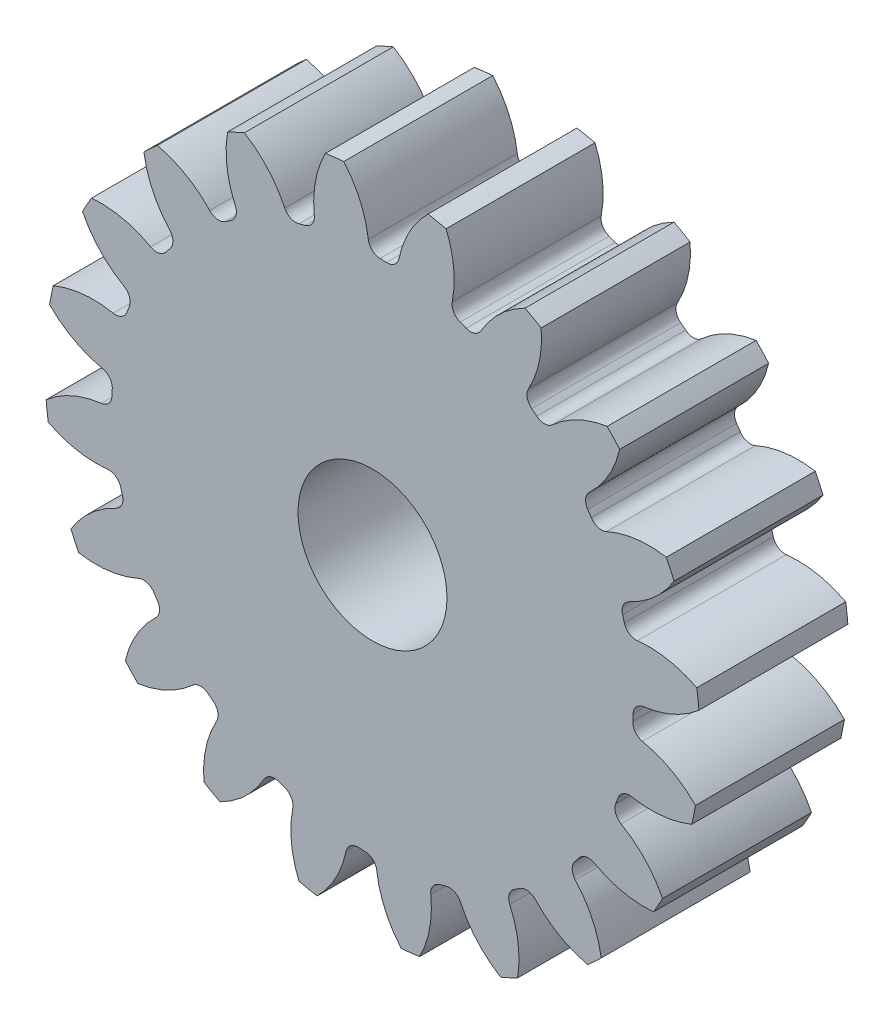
ISO-10303-21;
HEADER;
FILE_DESCRIPTION(('STEP AP214'),'2;1');
FILE_NAME('part.step','',(''),(''),'','','');
FILE_SCHEMA(('AUTOMOTIVE_DESIGN { 1 0 10303 214 1 1 1 1 }'));
ENDSEC;
DATA;
#1=APPLICATION_CONTEXT('core data for automotive mechanical design processes');
#2=APPLICATION_PROTOCOL_DEFINITION('international standard','automotive_design',2000,#1);
#3=PRODUCT_CONTEXT('',#1,'mechanical');
#4=PRODUCT('Part','Part','',(#3));
#5=PRODUCT_RELATED_PRODUCT_CATEGORY('part','',(#4));
#6=PRODUCT_DEFINITION_FORMATION('','',#4);
#7=PRODUCT_DEFINITION_CONTEXT('part definition',#1,'design');
#8=PRODUCT_DEFINITION('design','',#6,#7);
#9=PRODUCT_DEFINITION_SHAPE('','',#8);
#10=(LENGTH_UNIT() NAMED_UNIT(*) SI_UNIT(.MILLI.,.METRE.));
#11=(NAMED_UNIT(*) PLANE_ANGLE_UNIT() SI_UNIT($,.RADIAN.));
#12=(NAMED_UNIT(*) SI_UNIT($,.STERADIAN.) SOLID_ANGLE_UNIT());
#13=UNCERTAINTY_MEASURE_WITH_UNIT(LENGTH_MEASURE(1.E-05),#10,'distance_accuracy_value','');
#14=(GEOMETRIC_REPRESENTATION_CONTEXT(3) GLOBAL_UNCERTAINTY_ASSIGNED_CONTEXT((#13)) GLOBAL_UNIT_ASSIGNED_CONTEXT((#10,
#11,#12)) REPRESENTATION_CONTEXT('',''));
#15=CARTESIAN_POINT('',(0.,0.,0.));
#16=DIRECTION('',(0.,0.,1.));
#17=DIRECTION('',(1.,0.,0.));
#18=AXIS2_PLACEMENT_3D('',#15,#16,#17);
#19=CARTESIAN_POINT('',(0.,0.,101.6));
#20=DIRECTION('',(0.,0.,-1.));
#21=DIRECTION('',(-1.,0.,0.));
#22=AXIS2_PLACEMENT_3D('',#19,#20,#21);
#23=CYLINDRICAL_SURFACE('',#22,223.52);
#24=DIRECTION('',(0.,0.,-1.));
#25=VECTOR('',#24,1.);
#26=CARTESIAN_POINT('',(221.197587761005,32.1374791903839,50.8));
#27=LINE('',#26,#25);
#28=CARTESIAN_POINT('',(221.197587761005,32.1374791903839,101.6));
#29=VERTEX_POINT('',#28);
#30=CARTESIAN_POINT('',(221.197587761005,32.1374791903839,0.));
#31=VERTEX_POINT('',#30);
#32=EDGE_CURVE('E816',#29,#31,#27,.T.);
#33=ORIENTED_EDGE('',*,*,#32,.F.);
#34=CARTESIAN_POINT('',(0.,0.,101.6));
#35=DIRECTION('',(0.,0.,1.));
#36=DIRECTION('',(1.,0.,0.));
#37=AXIS2_PLACEMENT_3D('',#34,#35,#36);
#38=CIRCLE('',#37,223.52);
#39=CARTESIAN_POINT('',(222.660329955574,19.5848886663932,101.6));
#40=VERTEX_POINT('',#39);
#41=EDGE_CURVE('E1537',#40,#29,#38,.T.);
#42=ORIENTED_EDGE('',*,*,#41,.F.);
#43=DIRECTION('',(0.,0.,-1.));
#44=VECTOR('',#43,1.);
#45=CARTESIAN_POINT('',(222.660329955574,19.5848886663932,50.8));
#46=LINE('',#45,#44);
#47=CARTESIAN_POINT('',(222.660329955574,19.5848886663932,0.));
#48=VERTEX_POINT('',#47);
#49=EDGE_CURVE('E1531',#48,#40,#46,.F.);
#50=ORIENTED_EDGE('',*,*,#49,.F.);
#51=CARTESIAN_POINT('',(0.,0.,0.));
#52=DIRECTION('',(0.,0.,1.));
#53=DIRECTION('',(1.,0.,0.));
#54=AXIS2_PLACEMENT_3D('',#51,#52,#53);
#55=CIRCLE('',#54,223.52);
#56=EDGE_CURVE('E1542',#48,#31,#55,.T.);
#57=ORIENTED_EDGE('',*,*,#56,.T.);
#58=EDGE_LOOP('',(#33,#42,#50,#57));
#59=FACE_BOUND('',#58,.T.);
#60=ADVANCED_FACE('F33',(#59),#23,.T.);
#61=DIRECTION('',(0.,0.,-1.));
#62=VECTOR('',#61,1.);
#63=CARTESIAN_POINT('',(205.710494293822,87.4321619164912,50.8));
#64=LINE('',#63,#62);
#65=CARTESIAN_POINT('',(205.710494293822,87.4321619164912,0.));
#66=VERTEX_POINT('',#65);
#67=CARTESIAN_POINT('',(205.710494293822,87.4321619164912,101.6));
#68=VERTEX_POINT('',#67);
#69=EDGE_CURVE('E787',#66,#68,#64,.F.);
#70=ORIENTED_EDGE('',*,*,#69,.F.);
#71=CARTESIAN_POINT('',(200.440380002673,98.918372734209,0.));
#72=VERTEX_POINT('',#71);
#73=EDGE_CURVE('E1545',#66,#72,#55,.T.);
#74=ORIENTED_EDGE('',*,*,#73,.T.);
#75=DIRECTION('',(0.,0.,-1.));
#76=VECTOR('',#75,1.);
#77=CARTESIAN_POINT('',(200.440380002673,98.918372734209,50.8));
#78=LINE('',#77,#76);
#79=CARTESIAN_POINT('',(200.440380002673,98.918372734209,101.6));
#80=VERTEX_POINT('',#79);
#81=EDGE_CURVE('E849',#80,#72,#78,.T.);
#82=ORIENTED_EDGE('',*,*,#81,.F.);
#83=EDGE_CURVE('E1540',#68,#80,#38,.T.);
#84=ORIENTED_EDGE('',*,*,#83,.F.);
#85=EDGE_LOOP('',(#70,#74,#82,#84));
#86=FACE_BOUND('',#85,.T.);
#87=ADVANCED_FACE('F1771',(#86),#23,.T.);
#88=CARTESIAN_POINT('',(0.,0.,101.6));
#89=DIRECTION('',(0.,0.,1.));
#90=DIRECTION('',(1.,0.,0.));
#91=AXIS2_PLACEMENT_3D('',#88,#89,#90);
#92=PLANE('',#91);
#93=CARTESIAN_POINT('',(0.,0.,101.599999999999));
#94=DIRECTION('',(0.,0.,1.));
#95=DIRECTION('',(1.,0.,0.));
#96=AXIS2_PLACEMENT_3D('',#93,#94,#95);
#97=CIRCLE('',#96,50.8);
#98=CARTESIAN_POINT('',(50.8,0.,101.599999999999));
#99=VERTEX_POINT('',#98);
#100=EDGE_CURVE('E804',#99,#99,#97,.T.);
#101=ORIENTED_EDGE('',*,*,#100,.F.);
#102=EDGE_LOOP('',(#101));
#103=FACE_BOUND('',#102,.T.);
#104=ORIENTED_EDGE('',*,*,#41,.T.);
#105=CARTESIAN_POINT('',(188.485695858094,-30.5506450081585,101.6));
#106=DIRECTION('',(0.,0.,-1.));
#107=DIRECTION('',(0.951056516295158,0.309016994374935,0.));
#108=AXIS2_PLACEMENT_3D('',#105,#106,#107);
#109=CIRCLE('',#108,70.7097502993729);
#110=CARTESIAN_POINT('',(180.697084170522,39.7288421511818,101.6));
#111=VERTEX_POINT('',#110);
#112=EDGE_CURVE('E796',#111,#29,#109,.T.);
#113=ORIENTED_EDGE('',*,*,#112,.F.);
#114=CARTESIAN_POINT('',(179.786125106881,47.9487584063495,101.6));
#115=DIRECTION('',(0.,0.,1.));
#116=DIRECTION('',(-0.951056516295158,-0.309016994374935,0.));
#117=AXIS2_PLACEMENT_3D('',#114,#115,#116);
#118=CIRCLE('',#117,8.27024000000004);
#119=CARTESIAN_POINT('',(171.795194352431,45.8175861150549,101.6));
#120=VERTEX_POINT('',#119);
#121=EDGE_CURVE('E794',#120,#111,#118,.T.);
#122=ORIENTED_EDGE('',*,*,#121,.F.);
#123=CARTESIAN_POINT('',(0.,0.,101.6));
#124=DIRECTION('',(0.,0.,-1.));
#125=DIRECTION('',(0.951056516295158,0.309016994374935,0.));
#126=AXIS2_PLACEMENT_3D('',#123,#124,#125);
#127=CIRCLE('',#126,177.8);
#128=CARTESIAN_POINT('',(170.600891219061,50.081692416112,101.6));
#129=VERTEX_POINT('',#128);
#130=EDGE_CURVE('E779',#129,#120,#127,.T.);
#131=ORIENTED_EDGE('',*,*,#130,.F.);
#132=CARTESIAN_POINT('',(178.536269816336,52.4112065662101,101.6));
#133=DIRECTION('',(0.,0.,1.));
#134=DIRECTION('',(-0.951056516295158,-0.309016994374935,0.));
#135=AXIS2_PLACEMENT_3D('',#132,#133,#134);
#136=CIRCLE('',#135,8.27024000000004);
#137=CARTESIAN_POINT('',(175.045120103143,59.90845561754,101.6));
#138=VERTEX_POINT('',#137);
#139=EDGE_CURVE('E771',#138,#129,#136,.T.);
#140=ORIENTED_EDGE('',*,*,#139,.F.);
#141=CARTESIAN_POINT('',(145.19612848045,124.00920823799,101.6));
#142=DIRECTION('',(0.,0.,-1.));
#143=DIRECTION('',(-0.951056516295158,-0.309016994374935,0.));
#144=AXIS2_PLACEMENT_3D('',#141,#142,#143);
#145=CIRCLE('',#144,70.7097502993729);
#146=EDGE_CURVE('E801',#68,#138,#145,.T.);
#147=ORIENTED_EDGE('',*,*,#146,.F.);
#148=ORIENTED_EDGE('',*,*,#83,.T.);
#149=CARTESIAN_POINT('',(188.701217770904,29.1898932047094,101.6));
#150=DIRECTION('',(0.,0.,-1.));
#151=DIRECTION('',(0.809016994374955,0.587785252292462,0.));
#152=AXIS2_PLACEMENT_3D('',#149,#150,#151);
#153=CIRCLE('',#152,70.7097502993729);
#154=CARTESIAN_POINT('',(159.576251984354,93.6228440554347,101.6));
#155=VERTEX_POINT('',#154);
#156=EDGE_CURVE('E825',#155,#80,#153,.T.);
#157=ORIENTED_EDGE('',*,*,#156,.F.);
#158=CARTESIAN_POINT('',(156.169784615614,101.158947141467,101.6));
#159=DIRECTION('',(0.,0.,1.));
#160=DIRECTION('',(-0.809016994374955,-0.587785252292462,0.));
#161=AXIS2_PLACEMENT_3D('',#158,#159,#160);
#162=CIRCLE('',#161,8.27024000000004);
#163=CARTESIAN_POINT('',(149.228526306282,96.6627484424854,101.6));
#164=VERTEX_POINT('',#163);
#165=EDGE_CURVE('E823',#164,#155,#162,.T.);
#166=ORIENTED_EDGE('',*,*,#165,.F.);
#167=CARTESIAN_POINT('',(0.,0.,101.6));
#168=DIRECTION('',(0.,0.,-1.));
#169=DIRECTION('',(0.809016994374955,0.587785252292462,0.));
#170=AXIS2_PLACEMENT_3D('',#167,#168,#169);
#171=CIRCLE('',#170,177.8);
#172=CARTESIAN_POINT('',(146.774995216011,100.349094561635,101.6));
#173=VERTEX_POINT('',#172);
#174=EDGE_CURVE('E820',#173,#164,#171,.T.);
#175=ORIENTED_EDGE('',*,*,#174,.F.);
#176=CARTESIAN_POINT('',(153.602129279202,105.016761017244,101.6));
#177=DIRECTION('',(0.,0.,1.));
#178=DIRECTION('',(-0.809016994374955,-0.587785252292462,0.));
#179=AXIS2_PLACEMENT_3D('',#176,#177,#178);
#180=CIRCLE('',#179,8.27024000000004);
#181=CARTESIAN_POINT('',(147.965071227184,111.068243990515,101.6));
#182=VERTEX_POINT('',#181);
#183=EDGE_CURVE('E818',#182,#173,#180,.T.);
#184=ORIENTED_EDGE('',*,*,#183,.F.);
#185=CARTESIAN_POINT('',(99.7687713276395,162.80783679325,101.6));
#186=DIRECTION('',(0.,0.,-1.));
#187=DIRECTION('',(-0.809016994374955,-0.587785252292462,0.));
#188=AXIS2_PLACEMENT_3D('',#185,#186,#187);
#189=CIRCLE('',#188,70.7097502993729);
#190=CARTESIAN_POINT('',(168.624282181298,146.720965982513,101.6));
#191=VERTEX_POINT('',#190);
#192=EDGE_CURVE('E828',#191,#182,#189,.T.);
#193=ORIENTED_EDGE('',*,*,#192,.F.);
#194=CARTESIAN_POINT('',(160.062671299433,156.016446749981,101.6));
#195=VERTEX_POINT('',#194);
#196=EDGE_CURVE('E1593',#191,#195,#38,.T.);
#197=ORIENTED_EDGE('',*,*,#196,.T.);
#198=CARTESIAN_POINT('',(170.445349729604,86.0731212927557,101.6));
#199=DIRECTION('',(0.,0.,-1.));
#200=DIRECTION('',(0.587785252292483,0.80901699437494,0.));
#201=AXIS2_PLACEMENT_3D('',#198,#199,#200);
#202=CIRCLE('',#201,70.7097502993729);
#203=CARTESIAN_POINT('',(122.834984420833,138.352389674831,101.6));
#204=VERTEX_POINT('',#203);
#205=EDGE_CURVE('E860',#204,#195,#202,.T.);
#206=ORIENTED_EDGE('',*,*,#205,.F.);
#207=CARTESIAN_POINT('',(117.2664575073,144.46699331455,101.6));
#208=DIRECTION('',(0.,0.,1.));
#209=DIRECTION('',(-0.587785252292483,-0.80901699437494,0.));
#210=AXIS2_PLACEMENT_3D('',#207,#208,#209);
#211=CIRCLE('',#210,8.27024000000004);
#212=CARTESIAN_POINT('',(112.054330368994,138.045887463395,101.6));
#213=VERTEX_POINT('',#212);
#214=EDGE_CURVE('E858',#213,#204,#211,.T.);
#215=ORIENTED_EDGE('',*,*,#214,.F.);
#216=CARTESIAN_POINT('',(0.,0.,101.6));
#217=DIRECTION('',(0.,0.,-1.));
#218=DIRECTION('',(0.587785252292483,0.80901699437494,0.));
#219=AXIS2_PLACEMENT_3D('',#216,#217,#218);
#220=CIRCLE('',#219,177.8);
#221=CARTESIAN_POINT('',(108.581740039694,140.79362815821,101.6));
#222=VERTEX_POINT('',#221);
#223=EDGE_CURVE('E855',#222,#213,#220,.T.);
#224=ORIENTED_EDGE('',*,*,#223,.F.);
#225=CARTESIAN_POINT('',(113.632342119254,147.342543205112,101.6));
#226=DIRECTION('',(0.,0.,1.));
#227=DIRECTION('',(-0.587785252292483,-0.80901699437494,0.));
#228=AXIS2_PLACEMENT_3D('',#225,#226,#227);
#229=CIRCLE('',#228,8.27024000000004);
#230=CARTESIAN_POINT('',(106.401170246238,151.355898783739,101.6));
#231=VERTEX_POINT('',#230);
#232=EDGE_CURVE('E853',#231,#222,#229,.T.);
#233=ORIENTED_EDGE('',*,*,#232,.F.);
#234=CARTESIAN_POINT('',(44.5753517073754,185.669699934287,101.6));
#235=DIRECTION('',(0.,0.,-1.));
#236=DIRECTION('',(-0.587785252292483,-0.80901699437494,0.));
#237=AXIS2_PLACEMENT_3D('',#234,#235,#236);
#238=CIRCLE('',#237,70.7097502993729);
#239=CARTESIAN_POINT('',(115.031950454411,191.647699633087,101.6));
#240=VERTEX_POINT('',#239);
#241=EDGE_CURVE('E863',#240,#231,#238,.T.);
#242=ORIENTED_EDGE('',*,*,#241,.F.);
#243=CARTESIAN_POINT('',(104.016913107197,197.842543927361,101.6));
#244=VERTEX_POINT('',#243);
#245=EDGE_CURVE('E1753',#240,#244,#38,.T.);
#246=ORIENTED_EDGE('',*,*,#245,.T.);
#247=CARTESIAN_POINT('',(135.505103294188,134.530912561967,101.6));
#248=DIRECTION('',(0.,0.,-1.));
#249=DIRECTION('',(0.309016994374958,0.95105651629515,0.));
#250=AXIS2_PLACEMENT_3D('',#247,#248,#249);
#251=CIRCLE('',#250,70.7097502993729);
#252=CARTESIAN_POINT('',(74.0697727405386,169.539039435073,101.6));
#253=VERTEX_POINT('',#252);
#254=EDGE_CURVE('E898',#253,#244,#251,.T.);
#255=ORIENTED_EDGE('',*,*,#254,.F.);
#256=CARTESIAN_POINT('',(66.8842724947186,173.633603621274,101.6));
#257=DIRECTION('',(0.,0.,1.));
#258=DIRECTION('',(-0.309016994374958,-0.95105651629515,0.));
#259=AXIS2_PLACEMENT_3D('',#256,#257,#258);
#260=CIRCLE('',#259,8.27024000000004);
#261=CARTESIAN_POINT('',(63.9114758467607,165.916133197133,101.6));
#262=VERTEX_POINT('',#261);
#263=EDGE_CURVE('E896',#262,#253,#260,.T.);
#264=ORIENTED_EDGE('',*,*,#263,.F.);
#265=CARTESIAN_POINT('',(0.,0.,101.6));
#266=DIRECTION('',(0.,0.,-1.));
#267=DIRECTION('',(0.309016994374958,0.95105651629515,0.));
#268=AXIS2_PLACEMENT_3D('',#265,#266,#267);
#269=CIRCLE('',#268,177.8);
#270=CARTESIAN_POINT('',(59.7597476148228,167.456300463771,101.6));
#271=VERTEX_POINT('',#270);
#272=EDGE_CURVE('E893',#271,#262,#269,.T.);
#273=ORIENTED_EDGE('',*,*,#272,.F.);
#274=CARTESIAN_POINT('',(62.5394295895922,175.2454106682,101.6));
#275=DIRECTION('',(0.,0.,1.));
#276=DIRECTION('',(-0.309016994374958,-0.95105651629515,0.));
#277=AXIS2_PLACEMENT_3D('',#274,#275,#276);
#278=CIRCLE('',#277,8.27024000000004);
#279=CARTESIAN_POINT('',(54.4219813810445,176.827783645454,101.6));
#280=VERTEX_POINT('',#279);
#281=EDGE_CURVE('E891',#280,#271,#278,.T.);
#282=ORIENTED_EDGE('',*,*,#281,.F.);
#283=CARTESIAN_POINT('',(-14.9814139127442,190.356919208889,101.6));
#284=DIRECTION('',(0.,0.,-1.));
#285=DIRECTION('',(-0.309016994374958,-0.95105651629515,0.));
#286=AXIS2_PLACEMENT_3D('',#283,#284,#285);
#287=CIRCLE('',#286,70.7097502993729);
#288=CARTESIAN_POINT('',(50.1794899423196,217.814621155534,101.6));
#289=VERTEX_POINT('',#288);
#290=EDGE_CURVE('E901',#289,#280,#287,.T.);
#291=ORIENTED_EDGE('',*,*,#290,.F.);
#292=CARTESIAN_POINT('',(37.7892547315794,220.302434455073,101.6));
#293=VERTEX_POINT('',#292);
#294=EDGE_CURVE('E1749',#289,#293,#38,.T.);
#295=ORIENTED_EDGE('',*,*,#294,.T.);
#296=CARTESIAN_POINT('',(87.3006732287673,169.819880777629,101.6));
#297=DIRECTION('',(0.,0.,-1.));
#298=DIRECTION('',(0.,1.,0.));
#299=AXIS2_PLACEMENT_3D('',#296,#297,#298);
#300=CIRCLE('',#299,70.7097502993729);
#301=CARTESIAN_POINT('',(18.0540956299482,184.130026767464,101.6));
#302=VERTEX_POINT('',#301);
#303=EDGE_CURVE('E936',#302,#293,#300,.T.);
#304=ORIENTED_EDGE('',*,*,#303,.F.);
#305=CARTESIAN_POINT('',(9.95498888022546,185.803747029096,101.6));
#306=DIRECTION('',(0.,0.,1.));
#307=DIRECTION('',(0.,-1.,0.));
#308=AXIS2_PLACEMENT_3D('',#305,#306,#307);
#309=CIRCLE('',#308,8.27024000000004);
#310=CARTESIAN_POINT('',(9.51252077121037,177.545351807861,101.6));
#311=VERTEX_POINT('',#310);
#312=EDGE_CURVE('E934',#311,#302,#309,.T.);
#313=ORIENTED_EDGE('',*,*,#312,.F.);
#314=CARTESIAN_POINT('',(0.,0.,101.6));
#315=DIRECTION('',(0.,0.,-1.));
#316=DIRECTION('',(0.,1.,0.));
#317=AXIS2_PLACEMENT_3D('',#314,#315,#316);
#318=CIRCLE('',#317,177.8);
#319=CARTESIAN_POINT('',(5.08805472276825,177.727183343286,101.6));
#320=VERTEX_POINT('',#319);
#321=EDGE_CURVE('E931',#320,#311,#318,.T.);
#322=ORIENTED_EDGE('',*,*,#321,.F.);
#323=CARTESIAN_POINT('',(5.32472195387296,185.994036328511,101.6));
#324=DIRECTION('',(0.,0.,1.));
#325=DIRECTION('',(0.,-1.,0.));
#326=AXIS2_PLACEMENT_3D('',#323,#324,#325);
#327=CIRCLE('',#326,8.27024000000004);
#328=CARTESIAN_POINT('',(-2.88441020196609,184.990533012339,101.6));
#329=VERTEX_POINT('',#328);
#330=EDGE_CURVE('E929',#329,#320,#327,.T.);
#331=ORIENTED_EDGE('',*,*,#330,.F.);
#332=CARTESIAN_POINT('',(-73.0716943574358,176.41067693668,101.6));
#333=DIRECTION('',(0.,0.,-1.));
#334=DIRECTION('',(0.,-1.,0.));
#335=AXIS2_PLACEMENT_3D('',#332,#333,#334);
#336=CIRCLE('',#335,70.7097502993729);
#337=CARTESIAN_POINT('',(-19.5848886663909,222.660329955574,101.6));
#338=VERTEX_POINT('',#337);
#339=EDGE_CURVE('E939',#338,#329,#336,.T.);
#340=ORIENTED_EDGE('',*,*,#339,.F.);
#341=CARTESIAN_POINT('',(-32.1374791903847,221.197587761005,101.6));
#342=VERTEX_POINT('',#341);
#343=EDGE_CURVE('E1745',#338,#342,#38,.T.);
#344=ORIENTED_EDGE('',*,*,#343,.T.);
#345=CARTESIAN_POINT('',(30.5506450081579,188.485695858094,101.6));
#346=DIRECTION('',(0.,0.,-1.));
#347=DIRECTION('',(-0.309016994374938,0.951056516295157,0.));
#348=AXIS2_PLACEMENT_3D('',#345,#346,#347);
#349=CIRCLE('',#348,70.7097502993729);
#350=CARTESIAN_POINT('',(-39.7288421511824,180.697084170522,101.6));
#351=VERTEX_POINT('',#350);
#352=EDGE_CURVE('E974',#351,#342,#349,.T.);
#353=ORIENTED_EDGE('',*,*,#352,.F.);
#354=CARTESIAN_POINT('',(-47.9487584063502,179.786125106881,101.6));
#355=DIRECTION('',(0.,0.,1.));
#356=DIRECTION('',(0.309016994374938,-0.951056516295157,0.));
#357=AXIS2_PLACEMENT_3D('',#354,#355,#356);
#358=CIRCLE('',#357,8.27024000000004);
#359=CARTESIAN_POINT('',(-45.8175861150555,171.795194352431,101.6));
#360=VERTEX_POINT('',#359);
#361=EDGE_CURVE('E972',#360,#351,#358,.T.);
#362=ORIENTED_EDGE('',*,*,#361,.F.);
#363=CARTESIAN_POINT('',(0.,0.,101.6));
#364=DIRECTION('',(0.,0.,-1.));
#365=DIRECTION('',(-0.309016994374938,0.951056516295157,0.));
#366=AXIS2_PLACEMENT_3D('',#363,#364,#365);
#367=CIRCLE('',#366,177.8);
#368=CARTESIAN_POINT('',(-50.0816924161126,170.600891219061,101.6));
#369=VERTEX_POINT('',#368);
#370=EDGE_CURVE('E969',#369,#360,#367,.T.);
#371=ORIENTED_EDGE('',*,*,#370,.F.);
#372=CARTESIAN_POINT('',(-52.4112065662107,178.536269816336,101.6));
#373=DIRECTION('',(0.,0.,1.));
#374=DIRECTION('',(0.309016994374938,-0.951056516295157,0.));
#375=AXIS2_PLACEMENT_3D('',#372,#373,#374);
#376=CIRCLE('',#375,8.27024000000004);
#377=CARTESIAN_POINT('',(-59.9084556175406,175.045120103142,101.6));
#378=VERTEX_POINT('',#377);
#379=EDGE_CURVE('E967',#378,#369,#376,.T.);
#380=ORIENTED_EDGE('',*,*,#379,.F.);
#381=CARTESIAN_POINT('',(-124.00920823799,145.196128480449,101.6));
#382=DIRECTION('',(0.,0.,-1.));
#383=DIRECTION('',(0.309016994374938,-0.951056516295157,0.));
#384=AXIS2_PLACEMENT_3D('',#381,#382,#383);
#385=CIRCLE('',#384,70.7097502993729);
#386=CARTESIAN_POINT('',(-87.4321619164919,205.710494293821,101.6));
#387=VERTEX_POINT('',#386);
#388=EDGE_CURVE('E977',#387,#378,#385,.T.);
#389=ORIENTED_EDGE('',*,*,#388,.F.);
#390=CARTESIAN_POINT('',(-98.9183727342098,200.440380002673,101.6));
#391=VERTEX_POINT('',#390);
#392=EDGE_CURVE('E1741',#387,#391,#38,.T.);
#393=ORIENTED_EDGE('',*,*,#392,.T.);
#394=CARTESIAN_POINT('',(-29.18989320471,188.701217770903,101.6));
#395=DIRECTION('',(0.,0.,-1.));
#396=DIRECTION('',(-0.587785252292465,0.809016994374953,0.));
#397=AXIS2_PLACEMENT_3D('',#394,#395,#396);
#398=CIRCLE('',#397,70.7097502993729);
#399=CARTESIAN_POINT('',(-93.6228440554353,159.576251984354,101.6));
#400=VERTEX_POINT('',#399);
#401=EDGE_CURVE('E1012',#400,#391,#398,.T.);
#402=ORIENTED_EDGE('',*,*,#401,.F.);
#403=CARTESIAN_POINT('',(-101.158947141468,156.169784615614,101.6));
#404=DIRECTION('',(0.,0.,1.));
#405=DIRECTION('',(0.587785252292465,-0.809016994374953,0.));
#406=AXIS2_PLACEMENT_3D('',#403,#404,#405);
#407=CIRCLE('',#406,8.27024000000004);
#408=CARTESIAN_POINT('',(-96.662748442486,149.228526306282,101.6));
#409=VERTEX_POINT('',#408);
#410=EDGE_CURVE('E1010',#409,#400,#407,.T.);
#411=ORIENTED_EDGE('',*,*,#410,.F.);
#412=CARTESIAN_POINT('',(0.,0.,101.6));
#413=DIRECTION('',(0.,0.,-1.));
#414=DIRECTION('',(-0.587785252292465,0.809016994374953,0.));
#415=AXIS2_PLACEMENT_3D('',#412,#413,#414);
#416=CIRCLE('',#415,177.8);
#417=CARTESIAN_POINT('',(-100.349094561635,146.774995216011,101.6));
#418=VERTEX_POINT('',#417);
#419=EDGE_CURVE('E1007',#418,#409,#416,.T.);
#420=ORIENTED_EDGE('',*,*,#419,.F.);
#421=CARTESIAN_POINT('',(-105.016761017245,153.602129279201,101.6));
#422=DIRECTION('',(0.,0.,1.));
#423=DIRECTION('',(0.587785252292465,-0.809016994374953,0.));
#424=AXIS2_PLACEMENT_3D('',#421,#422,#423);
#425=CIRCLE('',#424,8.27024000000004);
#426=CARTESIAN_POINT('',(-111.068243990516,147.965071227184,101.6));
#427=VERTEX_POINT('',#426);
#428=EDGE_CURVE('E1005',#427,#418,#425,.T.);
#429=ORIENTED_EDGE('',*,*,#428,.F.);
#430=CARTESIAN_POINT('',(-162.80783679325,99.7687713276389,101.6));
#431=DIRECTION('',(0.,0.,-1.));
#432=DIRECTION('',(0.587785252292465,-0.809016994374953,0.));
#433=AXIS2_PLACEMENT_3D('',#430,#431,#432);
#434=CIRCLE('',#433,70.7097502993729);
#435=CARTESIAN_POINT('',(-146.720965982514,168.624282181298,101.6));
#436=VERTEX_POINT('',#435);
#437=EDGE_CURVE('E1015',#436,#427,#434,.T.);
#438=ORIENTED_EDGE('',*,*,#437,.F.);
#439=CARTESIAN_POINT('',(-156.016446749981,160.062671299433,101.6));
#440=VERTEX_POINT('',#439);
#441=EDGE_CURVE('E1737',#436,#440,#38,.T.);
#442=ORIENTED_EDGE('',*,*,#441,.T.);
#443=CARTESIAN_POINT('',(-86.0731212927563,170.445349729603,101.6));
#444=DIRECTION('',(0.,0.,-1.));
#445=DIRECTION('',(-0.809016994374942,0.58778525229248,0.));
#446=AXIS2_PLACEMENT_3D('',#443,#444,#445);
#447=CIRCLE('',#446,70.7097502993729);
#448=CARTESIAN_POINT('',(-138.352389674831,122.834984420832,101.6));
#449=VERTEX_POINT('',#448);
#450=EDGE_CURVE('E1050',#449,#440,#447,.T.);
#451=ORIENTED_EDGE('',*,*,#450,.F.);
#452=CARTESIAN_POINT('',(-144.46699331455,117.2664575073,101.6));
#453=DIRECTION('',(0.,0.,1.));
#454=DIRECTION('',(0.809016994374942,-0.58778525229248,0.));
#455=AXIS2_PLACEMENT_3D('',#452,#453,#454);
#456=CIRCLE('',#455,8.27024000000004);
#457=CARTESIAN_POINT('',(-138.045887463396,112.054330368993,101.6));
#458=VERTEX_POINT('',#457);
#459=EDGE_CURVE('E1048',#458,#449,#456,.T.);
#460=ORIENTED_EDGE('',*,*,#459,.F.);
#461=CARTESIAN_POINT('',(0.,0.,101.6));
#462=DIRECTION('',(0.,0.,-1.));
#463=DIRECTION('',(-0.809016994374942,0.58778525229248,0.));
#464=AXIS2_PLACEMENT_3D('',#461,#462,#463);
#465=CIRCLE('',#464,177.8);
#466=CARTESIAN_POINT('',(-140.793628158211,108.581740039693,101.6));
#467=VERTEX_POINT('',#466);
#468=EDGE_CURVE('E1045',#467,#458,#465,.T.);
#469=ORIENTED_EDGE('',*,*,#468,.F.);
#470=CARTESIAN_POINT('',(-147.342543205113,113.632342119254,101.6));
#471=DIRECTION('',(0.,0.,1.));
#472=DIRECTION('',(0.809016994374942,-0.58778525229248,0.));
#473=AXIS2_PLACEMENT_3D('',#470,#471,#472);
#474=CIRCLE('',#473,8.27024000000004);
#475=CARTESIAN_POINT('',(-151.35589878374,106.401170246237,101.6));
#476=VERTEX_POINT('',#475);
#477=EDGE_CURVE('E1043',#476,#467,#474,.T.);
#478=ORIENTED_EDGE('',*,*,#477,.F.);
#479=CARTESIAN_POINT('',(-185.669699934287,44.5753517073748,101.6));
#480=DIRECTION('',(0.,0.,-1.));
#481=DIRECTION('',(0.809016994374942,-0.58778525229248,0.));
#482=AXIS2_PLACEMENT_3D('',#479,#480,#481);
#483=CIRCLE('',#482,70.7097502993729);
#484=CARTESIAN_POINT('',(-191.647699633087,115.031950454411,101.6));
#485=VERTEX_POINT('',#484);
#486=EDGE_CURVE('E1053',#485,#476,#483,.T.);
#487=ORIENTED_EDGE('',*,*,#486,.F.);
#488=CARTESIAN_POINT('',(-197.842543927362,104.016913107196,101.6));
#489=VERTEX_POINT('',#488);
#490=EDGE_CURVE('E1733',#485,#489,#38,.T.);
#491=ORIENTED_EDGE('',*,*,#490,.T.);
#492=CARTESIAN_POINT('',(-134.530912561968,135.505103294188,101.6));
#493=DIRECTION('',(0.,0.,-1.));
#494=DIRECTION('',(-0.951056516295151,0.309016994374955,0.));
#495=AXIS2_PLACEMENT_3D('',#492,#493,#494);
#496=CIRCLE('',#495,70.7097502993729);
#497=CARTESIAN_POINT('',(-169.539039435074,74.069772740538,101.6));
#498=VERTEX_POINT('',#497);
#499=EDGE_CURVE('E1088',#498,#489,#496,.T.);
#500=ORIENTED_EDGE('',*,*,#499,.F.);
#501=CARTESIAN_POINT('',(-173.633603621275,66.884272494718,101.6));
#502=DIRECTION('',(0.,0.,1.));
#503=DIRECTION('',(0.951056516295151,-0.309016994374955,0.));
#504=AXIS2_PLACEMENT_3D('',#501,#502,#503);
#505=CIRCLE('',#504,8.27024000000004);
#506=CARTESIAN_POINT('',(-165.916133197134,63.9114758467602,101.6));
#507=VERTEX_POINT('',#506);
#508=EDGE_CURVE('E1086',#507,#498,#505,.T.);
#509=ORIENTED_EDGE('',*,*,#508,.F.);
#510=CARTESIAN_POINT('',(0.,0.,101.6));
#511=DIRECTION('',(0.,0.,-1.));
#512=DIRECTION('',(-0.951056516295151,0.309016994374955,0.));
#513=AXIS2_PLACEMENT_3D('',#510,#511,#512);
#514=CIRCLE('',#513,177.8);
#515=CARTESIAN_POINT('',(-167.456300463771,59.7597476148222,101.6));
#516=VERTEX_POINT('',#515);
#517=EDGE_CURVE('E1083',#516,#507,#514,.T.);
#518=ORIENTED_EDGE('',*,*,#517,.F.);
#519=CARTESIAN_POINT('',(-175.2454106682,62.5394295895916,101.6));
#520=DIRECTION('',(0.,0.,1.));
#521=DIRECTION('',(0.951056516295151,-0.309016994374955,0.));
#522=AXIS2_PLACEMENT_3D('',#519,#520,#521);
#523=CIRCLE('',#522,8.27024000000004);
#524=CARTESIAN_POINT('',(-176.827783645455,54.4219813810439,101.6));
#525=VERTEX_POINT('',#524);
#526=EDGE_CURVE('E1081',#525,#516,#523,.T.);
#527=ORIENTED_EDGE('',*,*,#526,.F.);
#528=CARTESIAN_POINT('',(-190.356919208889,-14.9814139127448,101.6));
#529=DIRECTION('',(0.,0.,-1.));
#530=DIRECTION('',(0.951056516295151,-0.309016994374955,0.));
#531=AXIS2_PLACEMENT_3D('',#528,#529,#530);
#532=CIRCLE('',#531,70.7097502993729);
#533=CARTESIAN_POINT('',(-217.814621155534,50.1794899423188,101.6));
#534=VERTEX_POINT('',#533);
#535=EDGE_CURVE('E1091',#534,#525,#532,.T.);
#536=ORIENTED_EDGE('',*,*,#535,.F.);
#537=CARTESIAN_POINT('',(-220.302434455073,37.7892547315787,101.6));
#538=VERTEX_POINT('',#537);
#539=EDGE_CURVE('E1729',#534,#538,#38,.T.);
#540=ORIENTED_EDGE('',*,*,#539,.T.);
#541=CARTESIAN_POINT('',(-169.81988077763,87.3006732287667,101.6));
#542=DIRECTION('',(0.,0.,-1.));
#543=DIRECTION('',(-1.,0.,0.));
#544=AXIS2_PLACEMENT_3D('',#541,#542,#543);
#545=CIRCLE('',#544,70.7097502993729);
#546=CARTESIAN_POINT('',(-184.130026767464,18.0540956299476,101.6));
#547=VERTEX_POINT('',#546);
#548=EDGE_CURVE('E1126',#547,#538,#545,.T.);
#549=ORIENTED_EDGE('',*,*,#548,.F.);
#550=CARTESIAN_POINT('',(-185.803747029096,9.95498888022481,101.6));
#551=DIRECTION('',(0.,0.,1.));
#552=DIRECTION('',(1.,0.,0.));
#553=AXIS2_PLACEMENT_3D('',#550,#551,#552);
#554=CIRCLE('',#553,8.27024000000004);
#555=CARTESIAN_POINT('',(-177.545351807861,9.51252077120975,101.6));
#556=VERTEX_POINT('',#555);
#557=EDGE_CURVE('E1124',#556,#547,#554,.T.);
#558=ORIENTED_EDGE('',*,*,#557,.F.);
#559=CARTESIAN_POINT('',(0.,0.,101.6));
#560=DIRECTION('',(0.,0.,-1.));
#561=DIRECTION('',(-1.,0.,0.));
#562=AXIS2_PLACEMENT_3D('',#559,#560,#561);
#563=CIRCLE('',#562,177.8);
#564=CARTESIAN_POINT('',(-177.727183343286,5.08805472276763,101.6));
#565=VERTEX_POINT('',#564);
#566=EDGE_CURVE('E1121',#565,#556,#563,.T.);
#567=ORIENTED_EDGE('',*,*,#566,.F.);
#568=CARTESIAN_POINT('',(-185.994036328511,5.32472195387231,101.6));
#569=DIRECTION('',(0.,0.,1.));
#570=DIRECTION('',(1.,0.,0.));
#571=AXIS2_PLACEMENT_3D('',#568,#569,#570);
#572=CIRCLE('',#571,8.27024000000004);
#573=CARTESIAN_POINT('',(-184.990533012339,-2.88441020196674,101.6));
#574=VERTEX_POINT('',#573);
#575=EDGE_CURVE('E1119',#574,#565,#572,.T.);
#576=ORIENTED_EDGE('',*,*,#575,.F.);
#577=CARTESIAN_POINT('',(-176.41067693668,-73.0716943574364,101.6));
#578=DIRECTION('',(0.,0.,-1.));
#579=DIRECTION('',(1.,0.,0.));
#580=AXIS2_PLACEMENT_3D('',#577,#578,#579);
#581=CIRCLE('',#580,70.7097502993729);
#582=CARTESIAN_POINT('',(-222.660329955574,-19.5848886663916,101.6));
#583=VERTEX_POINT('',#582);
#584=EDGE_CURVE('E1129',#583,#574,#581,.T.);
#585=ORIENTED_EDGE('',*,*,#584,.F.);
#586=CARTESIAN_POINT('',(-221.197587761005,-32.1374791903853,101.6));
#587=VERTEX_POINT('',#586);
#588=EDGE_CURVE('E1725',#583,#587,#38,.T.);
#589=ORIENTED_EDGE('',*,*,#588,.T.);
#590=CARTESIAN_POINT('',(-188.485695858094,30.5506450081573,101.6));
#591=DIRECTION('',(0.,0.,-1.));
#592=DIRECTION('',(-0.951056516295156,-0.309016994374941,0.));
#593=AXIS2_PLACEMENT_3D('',#590,#591,#592);
#594=CIRCLE('',#593,70.7097502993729);
#595=CARTESIAN_POINT('',(-180.697084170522,-39.728842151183,101.6));
#596=VERTEX_POINT('',#595);
#597=EDGE_CURVE('E1164',#596,#587,#594,.T.);
#598=ORIENTED_EDGE('',*,*,#597,.F.);
#599=CARTESIAN_POINT('',(-179.786125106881,-47.9487584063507,101.6));
#600=DIRECTION('',(0.,0.,1.));
#601=DIRECTION('',(0.951056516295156,0.309016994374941,0.));
#602=AXIS2_PLACEMENT_3D('',#599,#600,#601);
#603=CIRCLE('',#602,8.27024000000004);
#604=CARTESIAN_POINT('',(-171.795194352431,-45.817586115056,101.6));
#605=VERTEX_POINT('',#604);
#606=EDGE_CURVE('E1162',#605,#596,#603,.T.);
#607=ORIENTED_EDGE('',*,*,#606,.F.);
#608=CARTESIAN_POINT('',(0.,0.,101.6));
#609=DIRECTION('',(0.,0.,-1.));
#610=DIRECTION('',(-0.951056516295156,-0.309016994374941,0.));
#611=AXIS2_PLACEMENT_3D('',#608,#609,#610);
#612=CIRCLE('',#611,177.8);
#613=CARTESIAN_POINT('',(-170.600891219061,-50.0816924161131,101.6));
#614=VERTEX_POINT('',#613);
#615=EDGE_CURVE('E1159',#614,#605,#612,.T.);
#616=ORIENTED_EDGE('',*,*,#615,.F.);
#617=CARTESIAN_POINT('',(-178.536269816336,-52.4112065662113,101.6));
#618=DIRECTION('',(0.,0.,1.));
#619=DIRECTION('',(0.951056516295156,0.309016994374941,0.));
#620=AXIS2_PLACEMENT_3D('',#617,#618,#619);
#621=CIRCLE('',#620,8.27024000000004);
#622=CARTESIAN_POINT('',(-175.045120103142,-59.9084556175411,101.6));
#623=VERTEX_POINT('',#622);
#624=EDGE_CURVE('E1157',#623,#614,#621,.T.);
#625=ORIENTED_EDGE('',*,*,#624,.F.);
#626=CARTESIAN_POINT('',(-145.196128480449,-124.009208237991,101.6));
#627=DIRECTION('',(0.,0.,-1.));
#628=DIRECTION('',(0.951056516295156,0.309016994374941,0.));
#629=AXIS2_PLACEMENT_3D('',#626,#627,#628);
#630=CIRCLE('',#629,70.7097502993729);
#631=CARTESIAN_POINT('',(-205.710494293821,-87.4321619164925,101.6));
#632=VERTEX_POINT('',#631);
#633=EDGE_CURVE('E1167',#632,#623,#630,.T.);
#634=ORIENTED_EDGE('',*,*,#633,.F.);
#635=CARTESIAN_POINT('',(-200.440380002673,-98.9183727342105,101.6));
#636=VERTEX_POINT('',#635);
#637=EDGE_CURVE('E1721',#632,#636,#38,.T.);
#638=ORIENTED_EDGE('',*,*,#637,.T.);
#639=CARTESIAN_POINT('',(-188.701217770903,-29.1898932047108,101.6));
#640=DIRECTION('',(0.,0.,-1.));
#641=DIRECTION('',(-0.809016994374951,-0.587785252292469,0.));
#642=AXIS2_PLACEMENT_3D('',#639,#640,#641);
#643=CIRCLE('',#642,70.7097502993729);
#644=CARTESIAN_POINT('',(-159.576251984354,-93.6228440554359,101.6));
#645=VERTEX_POINT('',#644);
#646=EDGE_CURVE('E1202',#645,#636,#643,.T.);
#647=ORIENTED_EDGE('',*,*,#646,.F.);
#648=CARTESIAN_POINT('',(-156.169784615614,-101.158947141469,101.6));
#649=DIRECTION('',(0.,0.,1.));
#650=DIRECTION('',(0.809016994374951,0.587785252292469,0.));
#651=AXIS2_PLACEMENT_3D('',#648,#649,#650);
#652=CIRCLE('',#651,8.27024000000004);
#653=CARTESIAN_POINT('',(-149.228526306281,-96.6627484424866,101.6));
#654=VERTEX_POINT('',#653);
#655=EDGE_CURVE('E1200',#654,#645,#652,.T.);
#656=ORIENTED_EDGE('',*,*,#655,.F.);
#657=CARTESIAN_POINT('',(0.,0.,101.6));
#658=DIRECTION('',(0.,0.,-1.));
#659=DIRECTION('',(-0.809016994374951,-0.587785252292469,0.));
#660=AXIS2_PLACEMENT_3D('',#657,#658,#659);
#661=CIRCLE('',#660,177.8);
#662=CARTESIAN_POINT('',(-146.77499521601,-100.349094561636,101.6));
#663=VERTEX_POINT('',#662);
#664=EDGE_CURVE('E1197',#663,#654,#661,.T.);
#665=ORIENTED_EDGE('',*,*,#664,.F.);
#666=CARTESIAN_POINT('',(-153.602129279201,-105.016761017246,101.6));
#667=DIRECTION('',(0.,0.,1.));
#668=DIRECTION('',(0.809016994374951,0.587785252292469,0.));
#669=AXIS2_PLACEMENT_3D('',#666,#667,#668);
#670=CIRCLE('',#669,8.27024000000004);
#671=CARTESIAN_POINT('',(-147.965071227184,-111.068243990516,101.6));
#672=VERTEX_POINT('',#671);
#673=EDGE_CURVE('E1195',#672,#663,#670,.T.);
#674=ORIENTED_EDGE('',*,*,#673,.F.);
#675=CARTESIAN_POINT('',(-99.7687713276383,-162.807836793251,101.6));
#676=DIRECTION('',(0.,0.,-1.));
#677=DIRECTION('',(0.809016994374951,0.587785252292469,0.));
#678=AXIS2_PLACEMENT_3D('',#675,#676,#677);
#679=CIRCLE('',#678,70.7097502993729);
#680=CARTESIAN_POINT('',(-168.624282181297,-146.720965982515,101.6));
#681=VERTEX_POINT('',#680);
#682=EDGE_CURVE('E1205',#681,#672,#679,.T.);
#683=ORIENTED_EDGE('',*,*,#682,.F.);
#684=CARTESIAN_POINT('',(-160.062671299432,-156.016446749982,101.6));
#685=VERTEX_POINT('',#684);
#686=EDGE_CURVE('E1717',#681,#685,#38,.T.);
#687=ORIENTED_EDGE('',*,*,#686,.T.);
#688=CARTESIAN_POINT('',(-170.445349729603,-86.0731212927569,101.6));
#689=DIRECTION('',(0.,0.,-1.));
#690=DIRECTION('',(-0.587785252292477,-0.809016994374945,0.));
#691=AXIS2_PLACEMENT_3D('',#688,#689,#690);
#692=CIRCLE('',#691,70.7097502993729);
#693=CARTESIAN_POINT('',(-122.834984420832,-138.352389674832,101.6));
#694=VERTEX_POINT('',#693);
#695=EDGE_CURVE('E1240',#694,#685,#692,.T.);
#696=ORIENTED_EDGE('',*,*,#695,.F.);
#697=CARTESIAN_POINT('',(-117.266457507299,-144.466993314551,101.6));
#698=DIRECTION('',(0.,0.,1.));
#699=DIRECTION('',(0.587785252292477,0.809016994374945,0.));
#700=AXIS2_PLACEMENT_3D('',#697,#698,#699);
#701=CIRCLE('',#700,8.27024000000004);
#702=CARTESIAN_POINT('',(-112.054330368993,-138.045887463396,101.6));
#703=VERTEX_POINT('',#702);
#704=EDGE_CURVE('E1238',#703,#694,#701,.T.);
#705=ORIENTED_EDGE('',*,*,#704,.F.);
#706=CARTESIAN_POINT('',(0.,0.,101.6));
#707=DIRECTION('',(0.,0.,-1.));
#708=DIRECTION('',(-0.587785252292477,-0.809016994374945,0.));
#709=AXIS2_PLACEMENT_3D('',#706,#707,#708);
#710=CIRCLE('',#709,177.8);
#711=CARTESIAN_POINT('',(-108.581740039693,-140.793628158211,101.6));
#712=VERTEX_POINT('',#711);
#713=EDGE_CURVE('E1235',#712,#703,#710,.T.);
#714=ORIENTED_EDGE('',*,*,#713,.F.);
#715=CARTESIAN_POINT('',(-113.632342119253,-147.342543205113,101.6));
#716=DIRECTION('',(0.,0.,1.));
#717=DIRECTION('',(0.587785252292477,0.809016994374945,0.));
#718=AXIS2_PLACEMENT_3D('',#715,#716,#717);
#719=CIRCLE('',#718,8.27024000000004);
#720=CARTESIAN_POINT('',(-106.401170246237,-151.35589878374,101.6));
#721=VERTEX_POINT('',#720);
#722=EDGE_CURVE('E1233',#721,#712,#719,.T.);
#723=ORIENTED_EDGE('',*,*,#722,.F.);
#724=CARTESIAN_POINT('',(-44.575351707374,-185.669699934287,101.6));
#725=DIRECTION('',(0.,0.,-1.));
#726=DIRECTION('',(0.587785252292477,0.809016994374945,0.));
#727=AXIS2_PLACEMENT_3D('',#724,#725,#726);
#728=CIRCLE('',#727,70.7097502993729);
#729=CARTESIAN_POINT('',(-115.03195045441,-191.647699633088,101.6));
#730=VERTEX_POINT('',#729);
#731=EDGE_CURVE('E1243',#730,#721,#728,.T.);
#732=ORIENTED_EDGE('',*,*,#731,.F.);
#733=CARTESIAN_POINT('',(-104.016913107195,-197.842543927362,101.6));
#734=VERTEX_POINT('',#733);
#735=EDGE_CURVE('E1713',#730,#734,#38,.T.);
#736=ORIENTED_EDGE('',*,*,#735,.T.);
#737=CARTESIAN_POINT('',(-135.505103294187,-134.530912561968,101.6));
#738=DIRECTION('',(0.,0.,-1.));
#739=DIRECTION('',(-0.309016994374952,-0.951056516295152,0.));
#740=AXIS2_PLACEMENT_3D('',#737,#738,#739);
#741=CIRCLE('',#740,70.7097502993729);
#742=CARTESIAN_POINT('',(-74.0697727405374,-169.539039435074,101.6));
#743=VERTEX_POINT('',#742);
#744=EDGE_CURVE('E1278',#743,#734,#741,.T.);
#745=ORIENTED_EDGE('',*,*,#744,.F.);
#746=CARTESIAN_POINT('',(-66.8842724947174,-173.633603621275,101.6));
#747=DIRECTION('',(0.,0.,1.));
#748=DIRECTION('',(0.309016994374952,0.951056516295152,0.));
#749=AXIS2_PLACEMENT_3D('',#746,#747,#748);
#750=CIRCLE('',#749,8.27024000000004);
#751=CARTESIAN_POINT('',(-63.9114758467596,-165.916133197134,101.6));
#752=VERTEX_POINT('',#751);
#753=EDGE_CURVE('E1276',#752,#743,#750,.T.);
#754=ORIENTED_EDGE('',*,*,#753,.F.);
#755=CARTESIAN_POINT('',(0.,0.,101.6));
#756=DIRECTION('',(0.,0.,-1.));
#757=DIRECTION('',(-0.309016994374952,-0.951056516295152,0.));
#758=AXIS2_PLACEMENT_3D('',#755,#756,#757);
#759=CIRCLE('',#758,177.8);
#760=CARTESIAN_POINT('',(-59.7597476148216,-167.456300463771,101.6));
#761=VERTEX_POINT('',#760);
#762=EDGE_CURVE('E1273',#761,#752,#759,.T.);
#763=ORIENTED_EDGE('',*,*,#762,.F.);
#764=CARTESIAN_POINT('',(-62.539429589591,-175.2454106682,101.6));
#765=DIRECTION('',(0.,0.,1.));
#766=DIRECTION('',(0.309016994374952,0.951056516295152,0.));
#767=AXIS2_PLACEMENT_3D('',#764,#765,#766);
#768=CIRCLE('',#767,8.27024000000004);
#769=CARTESIAN_POINT('',(-54.4219813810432,-176.827783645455,101.6));
#770=VERTEX_POINT('',#769);
#771=EDGE_CURVE('E1271',#770,#761,#768,.T.);
#772=ORIENTED_EDGE('',*,*,#771,.F.);
#773=CARTESIAN_POINT('',(14.9814139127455,-190.356919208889,101.6));
#774=DIRECTION('',(0.,0.,-1.));
#775=DIRECTION('',(0.309016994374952,0.951056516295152,0.));
#776=AXIS2_PLACEMENT_3D('',#773,#774,#775);
#777=CIRCLE('',#776,70.7097502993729);
#778=CARTESIAN_POINT('',(-50.1794899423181,-217.814621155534,101.6));
#779=VERTEX_POINT('',#778);
#780=EDGE_CURVE('E1281',#779,#770,#777,.T.);
#781=ORIENTED_EDGE('',*,*,#780,.F.);
#782=CARTESIAN_POINT('',(-37.7892547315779,-220.302434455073,101.6));
#783=VERTEX_POINT('',#782);
#784=EDGE_CURVE('E1709',#779,#783,#38,.T.);
#785=ORIENTED_EDGE('',*,*,#784,.T.);
#786=CARTESIAN_POINT('',(-87.3006732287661,-169.81988077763,101.6));
#787=DIRECTION('',(0.,0.,-1.));
#788=DIRECTION('',(0.,-1.,0.));
#789=AXIS2_PLACEMENT_3D('',#786,#787,#788);
#790=CIRCLE('',#789,70.7097502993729);
#791=CARTESIAN_POINT('',(-18.0540956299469,-184.130026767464,101.6));
#792=VERTEX_POINT('',#791);
#793=EDGE_CURVE('E1316',#792,#783,#790,.T.);
#794=ORIENTED_EDGE('',*,*,#793,.F.);
#795=CARTESIAN_POINT('',(-9.95498888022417,-185.803747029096,101.6));
#796=DIRECTION('',(0.,0.,1.));
#797=DIRECTION('',(0.,1.,0.));
#798=AXIS2_PLACEMENT_3D('',#795,#796,#797);
#799=CIRCLE('',#798,8.27024000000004);
#800=CARTESIAN_POINT('',(-9.51252077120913,-177.545351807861,101.6));
#801=VERTEX_POINT('',#800);
#802=EDGE_CURVE('E1314',#801,#792,#799,.T.);
#803=ORIENTED_EDGE('',*,*,#802,.F.);
#804=CARTESIAN_POINT('',(0.,0.,101.6));
#805=DIRECTION('',(0.,0.,-1.));
#806=DIRECTION('',(0.,-1.,0.));
#807=AXIS2_PLACEMENT_3D('',#804,#805,#806);
#808=CIRCLE('',#807,177.8);
#809=CARTESIAN_POINT('',(-5.08805472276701,-177.727183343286,101.6));
#810=VERTEX_POINT('',#809);
#811=EDGE_CURVE('E1311',#810,#801,#808,.T.);
#812=ORIENTED_EDGE('',*,*,#811,.F.);
#813=CARTESIAN_POINT('',(-5.32472195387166,-185.994036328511,101.6));
#814=DIRECTION('',(0.,0.,1.));
#815=DIRECTION('',(0.,1.,0.));
#816=AXIS2_PLACEMENT_3D('',#813,#814,#815);
#817=CIRCLE('',#816,8.27024000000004);
#818=CARTESIAN_POINT('',(2.88441020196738,-184.990533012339,101.6));
#819=VERTEX_POINT('',#818);
#820=EDGE_CURVE('E1309',#819,#810,#817,.T.);
#821=ORIENTED_EDGE('',*,*,#820,.F.);
#822=CARTESIAN_POINT('',(73.0716943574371,-176.41067693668,101.6));
#823=DIRECTION('',(0.,0.,-1.));
#824=DIRECTION('',(0.,1.,0.));
#825=AXIS2_PLACEMENT_3D('',#822,#823,#824);
#826=CIRCLE('',#825,70.7097502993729);
#827=CARTESIAN_POINT('',(19.5848886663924,-222.660329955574,101.6));
#828=VERTEX_POINT('',#827);
#829=EDGE_CURVE('E1319',#828,#819,#826,.T.);
#830=ORIENTED_EDGE('',*,*,#829,.F.);
#831=CARTESIAN_POINT('',(32.1374791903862,-221.197587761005,101.6));
#832=VERTEX_POINT('',#831);
#833=EDGE_CURVE('E1705',#828,#832,#38,.T.);
#834=ORIENTED_EDGE('',*,*,#833,.T.);
#835=CARTESIAN_POINT('',(-30.5506450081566,-188.485695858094,101.6));
#836=DIRECTION('',(0.,0.,-1.));
#837=DIRECTION('',(0.309016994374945,-0.951056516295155,0.));
#838=AXIS2_PLACEMENT_3D('',#835,#836,#837);
#839=CIRCLE('',#838,70.7097502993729);
#840=CARTESIAN_POINT('',(39.7288421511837,-180.697084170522,101.6));
#841=VERTEX_POINT('',#840);
#842=EDGE_CURVE('E1354',#841,#832,#839,.T.);
#843=ORIENTED_EDGE('',*,*,#842,.F.);
#844=CARTESIAN_POINT('',(47.9487584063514,-179.786125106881,101.6));
#845=DIRECTION('',(0.,0.,1.));
#846=DIRECTION('',(-0.309016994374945,0.951056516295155,0.));
#847=AXIS2_PLACEMENT_3D('',#844,#845,#846);
#848=CIRCLE('',#847,8.27024000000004);
#849=CARTESIAN_POINT('',(45.8175861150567,-171.79519435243,101.6));
#850=VERTEX_POINT('',#849);
#851=EDGE_CURVE('E1352',#850,#841,#848,.T.);
#852=ORIENTED_EDGE('',*,*,#851,.F.);
#853=CARTESIAN_POINT('',(0.,0.,101.6));
#854=DIRECTION('',(0.,0.,-1.));
#855=DIRECTION('',(0.309016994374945,-0.951056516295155,0.));
#856=AXIS2_PLACEMENT_3D('',#853,#854,#855);
#857=CIRCLE('',#856,177.8);
#858=CARTESIAN_POINT('',(50.0816924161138,-170.600891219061,101.6));
#859=VERTEX_POINT('',#858);
#860=EDGE_CURVE('E1349',#859,#850,#857,.T.);
#861=ORIENTED_EDGE('',*,*,#860,.F.);
#862=CARTESIAN_POINT('',(52.4112065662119,-178.536269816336,101.6));
#863=DIRECTION('',(0.,0.,1.));
#864=DIRECTION('',(-0.309016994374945,0.951056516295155,0.));
#865=AXIS2_PLACEMENT_3D('',#862,#863,#864);
#866=CIRCLE('',#865,8.27024000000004);
#867=CARTESIAN_POINT('',(59.9084556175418,-175.045120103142,101.6));
#868=VERTEX_POINT('',#867);
#869=EDGE_CURVE('E1347',#868,#859,#866,.T.);
#870=ORIENTED_EDGE('',*,*,#869,.F.);
#871=CARTESIAN_POINT('',(124.009208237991,-145.196128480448,101.6));
#872=DIRECTION('',(0.,0.,-1.));
#873=DIRECTION('',(-0.309016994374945,0.951056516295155,0.));
#874=AXIS2_PLACEMENT_3D('',#871,#872,#873);
#875=CIRCLE('',#874,70.7097502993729);
#876=CARTESIAN_POINT('',(87.4321619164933,-205.710494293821,101.6));
#877=VERTEX_POINT('',#876);
#878=EDGE_CURVE('E1357',#877,#868,#875,.T.);
#879=ORIENTED_EDGE('',*,*,#878,.F.);
#880=CARTESIAN_POINT('',(98.9183727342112,-200.440380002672,101.6));
#881=VERTEX_POINT('',#880);
#882=EDGE_CURVE('E1701',#877,#881,#38,.T.);
#883=ORIENTED_EDGE('',*,*,#882,.T.);
#884=CARTESIAN_POINT('',(29.1898932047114,-188.701217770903,101.6));
#885=DIRECTION('',(0.,0.,-1.));
#886=DIRECTION('',(0.587785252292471,-0.809016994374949,0.));
#887=AXIS2_PLACEMENT_3D('',#884,#885,#886);
#888=CIRCLE('',#887,70.7097502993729);
#889=CARTESIAN_POINT('',(93.6228440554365,-159.576251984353,101.6));
#890=VERTEX_POINT('',#889);
#891=EDGE_CURVE('E1392',#890,#881,#888,.T.);
#892=ORIENTED_EDGE('',*,*,#891,.F.);
#893=CARTESIAN_POINT('',(101.158947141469,-156.169784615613,101.6));
#894=DIRECTION('',(0.,0.,1.));
#895=DIRECTION('',(-0.587785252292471,0.809016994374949,0.));
#896=AXIS2_PLACEMENT_3D('',#893,#894,#895);
#897=CIRCLE('',#896,8.27024000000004);
#898=CARTESIAN_POINT('',(96.6627484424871,-149.228526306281,101.6));
#899=VERTEX_POINT('',#898);
#900=EDGE_CURVE('E1390',#899,#890,#897,.T.);
#901=ORIENTED_EDGE('',*,*,#900,.F.);
#902=CARTESIAN_POINT('',(0.,0.,101.6));
#903=DIRECTION('',(0.,0.,-1.));
#904=DIRECTION('',(0.587785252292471,-0.809016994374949,0.));
#905=AXIS2_PLACEMENT_3D('',#902,#903,#904);
#906=CIRCLE('',#905,177.8);
#907=CARTESIAN_POINT('',(100.349094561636,-146.77499521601,101.6));
#908=VERTEX_POINT('',#907);
#909=EDGE_CURVE('E1387',#908,#899,#906,.T.);
#910=ORIENTED_EDGE('',*,*,#909,.F.);
#911=CARTESIAN_POINT('',(105.016761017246,-153.602129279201,101.6));
#912=DIRECTION('',(0.,0.,1.));
#913=DIRECTION('',(-0.587785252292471,0.809016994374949,0.));
#914=AXIS2_PLACEMENT_3D('',#911,#912,#913);
#915=CIRCLE('',#914,8.27024000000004);
#916=CARTESIAN_POINT('',(111.068243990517,-147.965071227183,101.6));
#917=VERTEX_POINT('',#916);
#918=EDGE_CURVE('E1385',#917,#908,#915,.T.);
#919=ORIENTED_EDGE('',*,*,#918,.F.);
#920=CARTESIAN_POINT('',(162.807836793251,-99.7687713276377,101.6));
#921=DIRECTION('',(0.,0.,-1.));
#922=DIRECTION('',(-0.587785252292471,0.809016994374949,0.));
#923=AXIS2_PLACEMENT_3D('',#920,#921,#922);
#924=CIRCLE('',#923,70.7097502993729);
#925=CARTESIAN_POINT('',(146.720965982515,-168.624282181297,101.6));
#926=VERTEX_POINT('',#925);
#927=EDGE_CURVE('E1395',#926,#917,#924,.T.);
#928=ORIENTED_EDGE('',*,*,#927,.F.);
#929=CARTESIAN_POINT('',(156.016446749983,-160.062671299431,101.6));
#930=VERTEX_POINT('',#929);
#931=EDGE_CURVE('E1697',#926,#930,#38,.T.);
#932=ORIENTED_EDGE('',*,*,#931,.T.);
#933=CARTESIAN_POINT('',(86.0731212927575,-170.445349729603,101.6));
#934=DIRECTION('',(0.,0.,-1.));
#935=DIRECTION('',(0.809016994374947,-0.587785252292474,0.));
#936=AXIS2_PLACEMENT_3D('',#933,#934,#935);
#937=CIRCLE('',#936,70.7097502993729);
#938=CARTESIAN_POINT('',(138.352389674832,-122.834984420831,101.6));
#939=VERTEX_POINT('',#938);
#940=EDGE_CURVE('E1430',#939,#930,#937,.T.);
#941=ORIENTED_EDGE('',*,*,#940,.F.);
#942=CARTESIAN_POINT('',(144.466993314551,-117.266457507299,101.6));
#943=DIRECTION('',(0.,0.,1.));
#944=DIRECTION('',(-0.809016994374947,0.587785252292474,0.));
#945=AXIS2_PLACEMENT_3D('',#942,#943,#944);
#946=CIRCLE('',#945,8.27024000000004);
#947=CARTESIAN_POINT('',(138.045887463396,-112.054330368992,101.6));
#948=VERTEX_POINT('',#947);
#949=EDGE_CURVE('E1428',#948,#939,#946,.T.);
#950=ORIENTED_EDGE('',*,*,#949,.F.);
#951=CARTESIAN_POINT('',(0.,0.,101.6));
#952=DIRECTION('',(0.,0.,-1.));
#953=DIRECTION('',(0.809016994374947,-0.587785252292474,0.));
#954=AXIS2_PLACEMENT_3D('',#951,#952,#953);
#955=CIRCLE('',#954,177.8);
#956=CARTESIAN_POINT('',(140.793628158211,-108.581740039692,101.6));
#957=VERTEX_POINT('',#956);
#958=EDGE_CURVE('E1425',#957,#948,#955,.T.);
#959=ORIENTED_EDGE('',*,*,#958,.F.);
#960=CARTESIAN_POINT('',(147.342543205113,-113.632342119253,101.6));
#961=DIRECTION('',(0.,0.,1.));
#962=DIRECTION('',(-0.809016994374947,0.587785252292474,0.));
#963=AXIS2_PLACEMENT_3D('',#960,#961,#962);
#964=CIRCLE('',#963,8.27024000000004);
#965=CARTESIAN_POINT('',(151.35589878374,-106.401170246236,101.6));
#966=VERTEX_POINT('',#965);
#967=EDGE_CURVE('E1423',#966,#957,#964,.T.);
#968=ORIENTED_EDGE('',*,*,#967,.F.);
#969=CARTESIAN_POINT('',(185.669699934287,-44.5753517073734,101.6));
#970=DIRECTION('',(0.,0.,-1.));
#971=DIRECTION('',(-0.809016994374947,0.587785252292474,0.));
#972=AXIS2_PLACEMENT_3D('',#969,#970,#971);
#973=CIRCLE('',#972,70.7097502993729);
#974=CARTESIAN_POINT('',(191.647699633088,-115.031950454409,101.6));
#975=VERTEX_POINT('',#974);
#976=EDGE_CURVE('E1433',#975,#966,#973,.T.);
#977=ORIENTED_EDGE('',*,*,#976,.F.);
#978=CARTESIAN_POINT('',(197.842543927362,-104.016913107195,101.6));
#979=VERTEX_POINT('',#978);
#980=EDGE_CURVE('E1696',#975,#979,#38,.T.);
#981=ORIENTED_EDGE('',*,*,#980,.T.);
#982=CARTESIAN_POINT('',(134.530912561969,-135.505103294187,101.6));
#983=DIRECTION('',(0.,0.,-1.));
#984=DIRECTION('',(0.951056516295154,-0.309016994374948,0.));
#985=AXIS2_PLACEMENT_3D('',#982,#983,#984);
#986=CIRCLE('',#985,70.7097502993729);
#987=CARTESIAN_POINT('',(169.539039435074,-74.0697727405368,101.6));
#988=VERTEX_POINT('',#987);
#989=EDGE_CURVE('E1468',#988,#979,#986,.T.);
#990=ORIENTED_EDGE('',*,*,#989,.F.);
#991=CARTESIAN_POINT('',(173.633603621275,-66.8842724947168,101.6));
#992=DIRECTION('',(0.,0.,1.));
#993=DIRECTION('',(-0.951056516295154,0.309016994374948,0.));
#994=AXIS2_PLACEMENT_3D('',#991,#992,#993);
#995=CIRCLE('',#994,8.27024000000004);
#996=CARTESIAN_POINT('',(165.916133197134,-63.911475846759,101.6));
#997=VERTEX_POINT('',#996);
#998=EDGE_CURVE('E1466',#997,#988,#995,.T.);
#999=ORIENTED_EDGE('',*,*,#998,.F.);
#1000=CARTESIAN_POINT('',(0.,0.,101.6));
#1001=DIRECTION('',(0.,0.,-1.));
#1002=DIRECTION('',(0.951056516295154,-0.309016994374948,0.));
#1003=AXIS2_PLACEMENT_3D('',#1000,#1001,#1002);
#1004=CIRCLE('',#1003,177.8);
#1005=CARTESIAN_POINT('',(167.456300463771,-59.759747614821,101.6));
#1006=VERTEX_POINT('',#1005);
#1007=EDGE_CURVE('E1463',#1006,#997,#1004,.T.);
#1008=ORIENTED_EDGE('',*,*,#1007,.F.);
#1009=CARTESIAN_POINT('',(175.245410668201,-62.5394295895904,101.6));
#1010=DIRECTION('',(0.,0.,1.));
#1011=DIRECTION('',(-0.951056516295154,0.309016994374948,0.));
#1012=AXIS2_PLACEMENT_3D('',#1009,#1010,#1011);
#1013=CIRCLE('',#1012,8.27024000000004);
#1014=CARTESIAN_POINT('',(176.827783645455,-54.4219813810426,101.6));
#1015=VERTEX_POINT('',#1014);
#1016=EDGE_CURVE('E1461',#1015,#1006,#1013,.T.);
#1017=ORIENTED_EDGE('',*,*,#1016,.F.);
#1018=CARTESIAN_POINT('',(190.356919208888,14.9814139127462,101.6));
#1019=DIRECTION('',(0.,0.,-1.));
#1020=DIRECTION('',(-0.951056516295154,0.309016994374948,0.));
#1021=AXIS2_PLACEMENT_3D('',#1018,#1019,#1020);
#1022=CIRCLE('',#1021,70.7097502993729);
#1023=CARTESIAN_POINT('',(217.814621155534,-50.1794899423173,101.6));
#1024=VERTEX_POINT('',#1023);
#1025=EDGE_CURVE('E1471',#1024,#1015,#1022,.T.);
#1026=ORIENTED_EDGE('',*,*,#1025,.F.);
#1027=CARTESIAN_POINT('',(220.302434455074,-37.7892547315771,101.6));
#1028=VERTEX_POINT('',#1027);
#1029=EDGE_CURVE('E1541',#1024,#1028,#38,.T.);
#1030=ORIENTED_EDGE('',*,*,#1029,.T.);
#1031=CARTESIAN_POINT('',(169.81988077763,-87.3006732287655,101.6));
#1032=DIRECTION('',(0.,0.,-1.));
#1033=DIRECTION('',(1.,0.,0.));
#1034=AXIS2_PLACEMENT_3D('',#1031,#1032,#1033);
#1035=CIRCLE('',#1034,70.7097502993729);
#1036=CARTESIAN_POINT('',(184.130026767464,-18.0540956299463,101.6));
#1037=VERTEX_POINT('',#1036);
#1038=EDGE_CURVE('E1506',#1037,#1028,#1035,.T.);
#1039=ORIENTED_EDGE('',*,*,#1038,.F.);
#1040=CARTESIAN_POINT('',(185.803747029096,-9.95498888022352,101.6));
#1041=DIRECTION('',(0.,0.,1.));
#1042=DIRECTION('',(-1.,0.,0.));
#1043=AXIS2_PLACEMENT_3D('',#1040,#1041,#1042);
#1044=CIRCLE('',#1043,8.27024000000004);
#1045=CARTESIAN_POINT('',(177.545351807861,-9.51252077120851,101.6));
#1046=VERTEX_POINT('',#1045);
#1047=EDGE_CURVE('E1504',#1046,#1037,#1044,.T.);
#1048=ORIENTED_EDGE('',*,*,#1047,.F.);
#1049=CARTESIAN_POINT('',(0.,0.,101.6));
#1050=DIRECTION('',(0.,0.,-1.));
#1051=DIRECTION('',(1.,0.,0.));
#1052=AXIS2_PLACEMENT_3D('',#1049,#1050,#1051);
#1053=CIRCLE('',#1052,177.8);
#1054=CARTESIAN_POINT('',(177.727183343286,-5.08805472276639,101.6));
#1055=VERTEX_POINT('',#1054);
#1056=EDGE_CURVE('E1501',#1055,#1046,#1053,.T.);
#1057=ORIENTED_EDGE('',*,*,#1056,.F.);
#1058=CARTESIAN_POINT('',(185.994036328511,-5.32472195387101,101.6));
#1059=DIRECTION('',(0.,0.,1.));
#1060=DIRECTION('',(-1.,0.,0.));
#1061=AXIS2_PLACEMENT_3D('',#1058,#1059,#1060);
#1062=CIRCLE('',#1061,8.27024000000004);
#1063=CARTESIAN_POINT('',(184.990533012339,2.88441020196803,101.6));
#1064=VERTEX_POINT('',#1063);
#1065=EDGE_CURVE('E1499',#1064,#1055,#1062,.T.);
#1066=ORIENTED_EDGE('',*,*,#1065,.F.);
#1067=CARTESIAN_POINT('',(176.41067693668,73.0716943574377,101.6));
#1068=DIRECTION('',(0.,0.,-1.));
#1069=DIRECTION('',(-1.,0.,0.));
#1070=AXIS2_PLACEMENT_3D('',#1067,#1068,#1069);
#1071=CIRCLE('',#1070,70.7097502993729);
#1072=EDGE_CURVE('E1509',#40,#1064,#1071,.T.);
#1073=ORIENTED_EDGE('',*,*,#1072,.F.);
#1074=EDGE_LOOP('',(#104,#113,#122,#131,#140,#147,#148,#157,#166,#175,#184,#193,#197,#206,#215,
#224,#233,#242,#246,#255,#264,#273,#282,#291,#295,#304,#313,#322,#331,#340,#344,#353,#362,#371,
#380,#389,#393,#402,#411,#420,#429,#438,#442,#451,#460,#469,#478,#487,#491,#500,#509,#518,#527,
#536,#540,#549,#558,#567,#576,#585,#589,#598,#607,#616,#625,#634,#638,#647,#656,#665,#674,#683,
#687,#696,#705,#714,#723,#732,#736,#745,#754,#763,#772,#781,#785,#794,#803,#812,#821,#830,#834,
#843,#852,#861,#870,#879,#883,#892,#901,#910,#919,#928,#932,#941,#950,#959,#968,#977,#981,#990,
#999,#1008,#1017,#1026,#1030,#1039,#1048,#1057,#1066,#1073));
#1075=FACE_BOUND('',#1074,.T.);
#1076=ADVANCED_FACE('F792',(#103,#1075),#92,.T.);
#1077=CARTESIAN_POINT('',(0.,0.,0.));
#1078=DIRECTION('',(0.,0.,1.));
#1079=DIRECTION('',(1.,0.,0.));
#1080=AXIS2_PLACEMENT_3D('',#1077,#1078,#1079);
#1081=PLANE('',#1080);
#1082=CARTESIAN_POINT('',(0.,0.,0.));
#1083=DIRECTION('',(0.,0.,1.));
#1084=DIRECTION('',(1.,0.,0.));
#1085=AXIS2_PLACEMENT_3D('',#1082,#1083,#1084);
#1086=CIRCLE('',#1085,50.8);
#1087=CARTESIAN_POINT('',(50.8,0.,-1.77635683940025E-12));
#1088=VERTEX_POINT('',#1087);
#1089=EDGE_CURVE('E36',#1088,#1088,#1086,.T.);
#1090=ORIENTED_EDGE('',*,*,#1089,.T.);
#1091=EDGE_LOOP('',(#1090));
#1092=FACE_BOUND('',#1091,.T.);
#1093=CARTESIAN_POINT('',(188.485695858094,-30.5506450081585,0.));
#1094=DIRECTION('',(0.,0.,-1.));
#1095=DIRECTION('',(0.951056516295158,0.309016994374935,0.));
#1096=AXIS2_PLACEMENT_3D('',#1093,#1094,#1095);
#1097=CIRCLE('',#1096,70.7097502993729);
#1098=CARTESIAN_POINT('',(180.697084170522,39.7288421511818,0.));
#1099=VERTEX_POINT('',#1098);
#1100=EDGE_CURVE('E780',#1099,#31,#1097,.T.);
#1101=ORIENTED_EDGE('',*,*,#1100,.T.);
#1102=ORIENTED_EDGE('',*,*,#56,.F.);
#1103=CARTESIAN_POINT('',(176.41067693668,73.0716943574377,0.));
#1104=DIRECTION('',(0.,0.,1.));
#1105=DIRECTION('',(1.,0.,0.));
#1106=AXIS2_PLACEMENT_3D('',#1103,#1104,#1105);
#1107=CIRCLE('',#1106,70.7097502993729);
#1108=CARTESIAN_POINT('',(184.990533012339,2.88441020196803,0.));
#1109=VERTEX_POINT('',#1108);
#1110=EDGE_CURVE('E1539',#1109,#48,#1107,.T.);
#1111=ORIENTED_EDGE('',*,*,#1110,.F.);
#1112=CARTESIAN_POINT('',(185.994036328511,-5.32472195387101,0.));
#1113=DIRECTION('',(0.,0.,1.));
#1114=DIRECTION('',(-1.,0.,0.));
#1115=AXIS2_PLACEMENT_3D('',#1112,#1113,#1114);
#1116=CIRCLE('',#1115,8.27024000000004);
#1117=CARTESIAN_POINT('',(177.727183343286,-5.08805472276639,0.));
#1118=VERTEX_POINT('',#1117);
#1119=EDGE_CURVE('E1498',#1109,#1118,#1116,.T.);
#1120=ORIENTED_EDGE('',*,*,#1119,.T.);
#1121=CARTESIAN_POINT('',(0.,0.,0.));
#1122=DIRECTION('',(0.,0.,-1.));
#1123=DIRECTION('',(1.,0.,0.));
#1124=AXIS2_PLACEMENT_3D('',#1121,#1122,#1123);
#1125=CIRCLE('',#1124,177.8);
#1126=CARTESIAN_POINT('',(177.545351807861,-9.51252077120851,0.));
#1127=VERTEX_POINT('',#1126);
#1128=EDGE_CURVE('E1514',#1118,#1127,#1125,.T.);
#1129=ORIENTED_EDGE('',*,*,#1128,.T.);
#1130=CARTESIAN_POINT('',(185.803747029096,-9.95498888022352,0.));
#1131=DIRECTION('',(0.,0.,1.));
#1132=DIRECTION('',(-1.,0.,0.));
#1133=AXIS2_PLACEMENT_3D('',#1130,#1131,#1132);
#1134=CIRCLE('',#1133,8.27024000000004);
#1135=CARTESIAN_POINT('',(184.130026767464,-18.0540956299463,0.));
#1136=VERTEX_POINT('',#1135);
#1137=EDGE_CURVE('E1517',#1127,#1136,#1134,.T.);
#1138=ORIENTED_EDGE('',*,*,#1137,.T.);
#1139=CARTESIAN_POINT('',(169.81988077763,-87.3006732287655,0.));
#1140=DIRECTION('',(0.,0.,-1.));
#1141=DIRECTION('',(1.,0.,0.));
#1142=AXIS2_PLACEMENT_3D('',#1139,#1140,#1141);
#1143=CIRCLE('',#1142,70.7097502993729);
#1144=CARTESIAN_POINT('',(220.302434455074,-37.7892547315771,0.));
#1145=VERTEX_POINT('',#1144);
#1146=EDGE_CURVE('E1502',#1136,#1145,#1143,.T.);
#1147=ORIENTED_EDGE('',*,*,#1146,.T.);
#1148=CARTESIAN_POINT('',(217.814621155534,-50.1794899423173,0.));
#1149=VERTEX_POINT('',#1148);
#1150=EDGE_CURVE('E1536',#1149,#1145,#55,.T.);
#1151=ORIENTED_EDGE('',*,*,#1150,.F.);
#1152=CARTESIAN_POINT('',(190.356919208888,14.9814139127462,0.));
#1153=DIRECTION('',(0.,0.,1.));
#1154=DIRECTION('',(1.,0.,0.));
#1155=AXIS2_PLACEMENT_3D('',#1152,#1153,#1154);
#1156=CIRCLE('',#1155,70.7097502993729);
#1157=CARTESIAN_POINT('',(176.827783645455,-54.4219813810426,0.));
#1158=VERTEX_POINT('',#1157);
#1159=EDGE_CURVE('E1547',#1158,#1149,#1156,.T.);
#1160=ORIENTED_EDGE('',*,*,#1159,.F.);
#1161=CARTESIAN_POINT('',(175.245410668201,-62.5394295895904,0.));
#1162=DIRECTION('',(0.,0.,1.));
#1163=DIRECTION('',(-0.951056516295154,0.309016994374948,0.));
#1164=AXIS2_PLACEMENT_3D('',#1161,#1162,#1163);
#1165=CIRCLE('',#1164,8.27024000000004);
#1166=CARTESIAN_POINT('',(167.456300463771,-59.759747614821,0.));
#1167=VERTEX_POINT('',#1166);
#1168=EDGE_CURVE('E1460',#1158,#1167,#1165,.T.);
#1169=ORIENTED_EDGE('',*,*,#1168,.T.);
#1170=CARTESIAN_POINT('',(0.,0.,0.));
#1171=DIRECTION('',(0.,0.,-1.));
#1172=DIRECTION('',(0.951056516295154,-0.309016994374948,0.));
#1173=AXIS2_PLACEMENT_3D('',#1170,#1171,#1172);
#1174=CIRCLE('',#1173,177.8);
#1175=CARTESIAN_POINT('',(165.916133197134,-63.911475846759,0.));
#1176=VERTEX_POINT('',#1175);
#1177=EDGE_CURVE('E1476',#1167,#1176,#1174,.T.);
#1178=ORIENTED_EDGE('',*,*,#1177,.T.);
#1179=CARTESIAN_POINT('',(173.633603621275,-66.8842724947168,0.));
#1180=DIRECTION('',(0.,0.,1.));
#1181=DIRECTION('',(-0.951056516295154,0.309016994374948,0.));
#1182=AXIS2_PLACEMENT_3D('',#1179,#1180,#1181);
#1183=CIRCLE('',#1182,8.27024000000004);
#1184=CARTESIAN_POINT('',(169.539039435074,-74.0697727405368,0.));
#1185=VERTEX_POINT('',#1184);
#1186=EDGE_CURVE('E1479',#1176,#1185,#1183,.T.);
#1187=ORIENTED_EDGE('',*,*,#1186,.T.);
#1188=CARTESIAN_POINT('',(134.530912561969,-135.505103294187,0.));
#1189=DIRECTION('',(0.,0.,-1.));
#1190=DIRECTION('',(0.951056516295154,-0.309016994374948,0.));
#1191=AXIS2_PLACEMENT_3D('',#1188,#1189,#1190);
#1192=CIRCLE('',#1191,70.7097502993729);
#1193=CARTESIAN_POINT('',(197.842543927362,-104.016913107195,0.));
#1194=VERTEX_POINT('',#1193);
#1195=EDGE_CURVE('E1464',#1185,#1194,#1192,.T.);
#1196=ORIENTED_EDGE('',*,*,#1195,.T.);
#1197=CARTESIAN_POINT('',(191.647699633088,-115.031950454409,0.));
#1198=VERTEX_POINT('',#1197);
#1199=EDGE_CURVE('E1667',#1198,#1194,#55,.T.);
#1200=ORIENTED_EDGE('',*,*,#1199,.F.);
#1201=CARTESIAN_POINT('',(185.669699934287,-44.5753517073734,0.));
#1202=DIRECTION('',(0.,0.,1.));
#1203=DIRECTION('',(1.,0.,0.));
#1204=AXIS2_PLACEMENT_3D('',#1201,#1202,#1203);
#1205=CIRCLE('',#1204,70.7097502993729);
#1206=CARTESIAN_POINT('',(151.35589878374,-106.401170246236,0.));
#1207=VERTEX_POINT('',#1206);
#1208=EDGE_CURVE('E1549',#1207,#1198,#1205,.T.);
#1209=ORIENTED_EDGE('',*,*,#1208,.F.);
#1210=CARTESIAN_POINT('',(147.342543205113,-113.632342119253,0.));
#1211=DIRECTION('',(0.,0.,1.));
#1212=DIRECTION('',(-0.809016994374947,0.587785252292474,0.));
#1213=AXIS2_PLACEMENT_3D('',#1210,#1211,#1212);
#1214=CIRCLE('',#1213,8.27024000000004);
#1215=CARTESIAN_POINT('',(140.793628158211,-108.581740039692,0.));
#1216=VERTEX_POINT('',#1215);
#1217=EDGE_CURVE('E1422',#1207,#1216,#1214,.T.);
#1218=ORIENTED_EDGE('',*,*,#1217,.T.);
#1219=CARTESIAN_POINT('',(0.,0.,0.));
#1220=DIRECTION('',(0.,0.,-1.));
#1221=DIRECTION('',(0.809016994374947,-0.587785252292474,0.));
#1222=AXIS2_PLACEMENT_3D('',#1219,#1220,#1221);
#1223=CIRCLE('',#1222,177.8);
#1224=CARTESIAN_POINT('',(138.045887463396,-112.054330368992,0.));
#1225=VERTEX_POINT('',#1224);
#1226=EDGE_CURVE('E1438',#1216,#1225,#1223,.T.);
#1227=ORIENTED_EDGE('',*,*,#1226,.T.);
#1228=CARTESIAN_POINT('',(144.466993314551,-117.266457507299,0.));
#1229=DIRECTION('',(0.,0.,1.));
#1230=DIRECTION('',(-0.809016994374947,0.587785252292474,0.));
#1231=AXIS2_PLACEMENT_3D('',#1228,#1229,#1230);
#1232=CIRCLE('',#1231,8.27024000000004);
#1233=CARTESIAN_POINT('',(138.352389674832,-122.834984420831,0.));
#1234=VERTEX_POINT('',#1233);
#1235=EDGE_CURVE('E1441',#1225,#1234,#1232,.T.);
#1236=ORIENTED_EDGE('',*,*,#1235,.T.);
#1237=CARTESIAN_POINT('',(86.0731212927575,-170.445349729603,0.));
#1238=DIRECTION('',(0.,0.,-1.));
#1239=DIRECTION('',(0.809016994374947,-0.587785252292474,0.));
#1240=AXIS2_PLACEMENT_3D('',#1237,#1238,#1239);
#1241=CIRCLE('',#1240,70.7097502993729);
#1242=CARTESIAN_POINT('',(156.016446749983,-160.062671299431,0.));
#1243=VERTEX_POINT('',#1242);
#1244=EDGE_CURVE('E1426',#1234,#1243,#1241,.T.);
#1245=ORIENTED_EDGE('',*,*,#1244,.T.);
#1246=CARTESIAN_POINT('',(146.720965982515,-168.624282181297,0.));
#1247=VERTEX_POINT('',#1246);
#1248=EDGE_CURVE('E1662',#1247,#1243,#55,.T.);
#1249=ORIENTED_EDGE('',*,*,#1248,.F.);
#1250=CARTESIAN_POINT('',(162.807836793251,-99.7687713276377,0.));
#1251=DIRECTION('',(0.,0.,1.));
#1252=DIRECTION('',(1.,0.,0.));
#1253=AXIS2_PLACEMENT_3D('',#1250,#1251,#1252);
#1254=CIRCLE('',#1253,70.7097502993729);
#1255=CARTESIAN_POINT('',(111.068243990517,-147.965071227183,0.));
#1256=VERTEX_POINT('',#1255);
#1257=EDGE_CURVE('E1551',#1256,#1247,#1254,.T.);
#1258=ORIENTED_EDGE('',*,*,#1257,.F.);
#1259=CARTESIAN_POINT('',(105.016761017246,-153.602129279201,0.));
#1260=DIRECTION('',(0.,0.,1.));
#1261=DIRECTION('',(-0.587785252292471,0.809016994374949,0.));
#1262=AXIS2_PLACEMENT_3D('',#1259,#1260,#1261);
#1263=CIRCLE('',#1262,8.27024000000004);
#1264=CARTESIAN_POINT('',(100.349094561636,-146.77499521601,0.));
#1265=VERTEX_POINT('',#1264);
#1266=EDGE_CURVE('E1384',#1256,#1265,#1263,.T.);
#1267=ORIENTED_EDGE('',*,*,#1266,.T.);
#1268=CARTESIAN_POINT('',(0.,0.,0.));
#1269=DIRECTION('',(0.,0.,-1.));
#1270=DIRECTION('',(0.587785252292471,-0.809016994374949,0.));
#1271=AXIS2_PLACEMENT_3D('',#1268,#1269,#1270);
#1272=CIRCLE('',#1271,177.8);
#1273=CARTESIAN_POINT('',(96.6627484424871,-149.228526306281,0.));
#1274=VERTEX_POINT('',#1273);
#1275=EDGE_CURVE('E1400',#1265,#1274,#1272,.T.);
#1276=ORIENTED_EDGE('',*,*,#1275,.T.);
#1277=CARTESIAN_POINT('',(101.158947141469,-156.169784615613,0.));
#1278=DIRECTION('',(0.,0.,1.));
#1279=DIRECTION('',(-0.587785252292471,0.809016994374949,0.));
#1280=AXIS2_PLACEMENT_3D('',#1277,#1278,#1279);
#1281=CIRCLE('',#1280,8.27024000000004);
#1282=CARTESIAN_POINT('',(93.6228440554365,-159.576251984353,0.));
#1283=VERTEX_POINT('',#1282);
#1284=EDGE_CURVE('E1403',#1274,#1283,#1281,.T.);
#1285=ORIENTED_EDGE('',*,*,#1284,.T.);
#1286=CARTESIAN_POINT('',(29.1898932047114,-188.701217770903,0.));
#1287=DIRECTION('',(0.,0.,-1.));
#1288=DIRECTION('',(0.587785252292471,-0.809016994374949,0.));
#1289=AXIS2_PLACEMENT_3D('',#1286,#1287,#1288);
#1290=CIRCLE('',#1289,70.7097502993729);
#1291=CARTESIAN_POINT('',(98.9183727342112,-200.440380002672,0.));
#1292=VERTEX_POINT('',#1291);
#1293=EDGE_CURVE('E1388',#1283,#1292,#1290,.T.);
#1294=ORIENTED_EDGE('',*,*,#1293,.T.);
#1295=CARTESIAN_POINT('',(87.4321619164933,-205.710494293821,0.));
#1296=VERTEX_POINT('',#1295);
#1297=EDGE_CURVE('E1657',#1296,#1292,#55,.T.);
#1298=ORIENTED_EDGE('',*,*,#1297,.F.);
#1299=CARTESIAN_POINT('',(124.009208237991,-145.196128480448,0.));
#1300=DIRECTION('',(0.,0.,1.));
#1301=DIRECTION('',(1.,0.,0.));
#1302=AXIS2_PLACEMENT_3D('',#1299,#1300,#1301);
#1303=CIRCLE('',#1302,70.7097502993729);
#1304=CARTESIAN_POINT('',(59.9084556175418,-175.045120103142,0.));
#1305=VERTEX_POINT('',#1304);
#1306=EDGE_CURVE('E1553',#1305,#1296,#1303,.T.);
#1307=ORIENTED_EDGE('',*,*,#1306,.F.);
#1308=CARTESIAN_POINT('',(52.4112065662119,-178.536269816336,0.));
#1309=DIRECTION('',(0.,0.,1.));
#1310=DIRECTION('',(-0.309016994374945,0.951056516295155,0.));
#1311=AXIS2_PLACEMENT_3D('',#1308,#1309,#1310);
#1312=CIRCLE('',#1311,8.27024000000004);
#1313=CARTESIAN_POINT('',(50.0816924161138,-170.600891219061,0.));
#1314=VERTEX_POINT('',#1313);
#1315=EDGE_CURVE('E1346',#1305,#1314,#1312,.T.);
#1316=ORIENTED_EDGE('',*,*,#1315,.T.);
#1317=CARTESIAN_POINT('',(0.,0.,0.));
#1318=DIRECTION('',(0.,0.,-1.));
#1319=DIRECTION('',(0.309016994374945,-0.951056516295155,0.));
#1320=AXIS2_PLACEMENT_3D('',#1317,#1318,#1319);
#1321=CIRCLE('',#1320,177.8);
#1322=CARTESIAN_POINT('',(45.8175861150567,-171.79519435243,0.));
#1323=VERTEX_POINT('',#1322);
#1324=EDGE_CURVE('E1362',#1314,#1323,#1321,.T.);
#1325=ORIENTED_EDGE('',*,*,#1324,.T.);
#1326=CARTESIAN_POINT('',(47.9487584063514,-179.786125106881,0.));
#1327=DIRECTION('',(0.,0.,1.));
#1328=DIRECTION('',(-0.309016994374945,0.951056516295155,0.));
#1329=AXIS2_PLACEMENT_3D('',#1326,#1327,#1328);
#1330=CIRCLE('',#1329,8.27024000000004);
#1331=CARTESIAN_POINT('',(39.7288421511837,-180.697084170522,0.));
#1332=VERTEX_POINT('',#1331);
#1333=EDGE_CURVE('E1365',#1323,#1332,#1330,.T.);
#1334=ORIENTED_EDGE('',*,*,#1333,.T.);
#1335=CARTESIAN_POINT('',(-30.5506450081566,-188.485695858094,0.));
#1336=DIRECTION('',(0.,0.,-1.));
#1337=DIRECTION('',(0.309016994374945,-0.951056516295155,0.));
#1338=AXIS2_PLACEMENT_3D('',#1335,#1336,#1337);
#1339=CIRCLE('',#1338,70.7097502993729);
#1340=CARTESIAN_POINT('',(32.1374791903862,-221.197587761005,0.));
#1341=VERTEX_POINT('',#1340);
#1342=EDGE_CURVE('E1350',#1332,#1341,#1339,.T.);
#1343=ORIENTED_EDGE('',*,*,#1342,.T.);
#1344=CARTESIAN_POINT('',(19.5848886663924,-222.660329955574,0.));
#1345=VERTEX_POINT('',#1344);
#1346=EDGE_CURVE('E1652',#1345,#1341,#55,.T.);
#1347=ORIENTED_EDGE('',*,*,#1346,.F.);
#1348=CARTESIAN_POINT('',(73.0716943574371,-176.41067693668,0.));
#1349=DIRECTION('',(0.,0.,1.));
#1350=DIRECTION('',(1.,0.,0.));
#1351=AXIS2_PLACEMENT_3D('',#1348,#1349,#1350);
#1352=CIRCLE('',#1351,70.7097502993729);
#1353=CARTESIAN_POINT('',(2.88441020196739,-184.990533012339,0.));
#1354=VERTEX_POINT('',#1353);
#1355=EDGE_CURVE('E1555',#1354,#1345,#1352,.T.);
#1356=ORIENTED_EDGE('',*,*,#1355,.F.);
#1357=CARTESIAN_POINT('',(-5.32472195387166,-185.994036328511,0.));
#1358=DIRECTION('',(0.,0.,1.));
#1359=DIRECTION('',(0.,1.,0.));
#1360=AXIS2_PLACEMENT_3D('',#1357,#1358,#1359);
#1361=CIRCLE('',#1360,8.27024000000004);
#1362=CARTESIAN_POINT('',(-5.08805472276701,-177.727183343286,0.));
#1363=VERTEX_POINT('',#1362);
#1364=EDGE_CURVE('E1308',#1354,#1363,#1361,.T.);
#1365=ORIENTED_EDGE('',*,*,#1364,.T.);
#1366=CARTESIAN_POINT('',(0.,0.,0.));
#1367=DIRECTION('',(0.,0.,-1.));
#1368=DIRECTION('',(0.,-1.,0.));
#1369=AXIS2_PLACEMENT_3D('',#1366,#1367,#1368);
#1370=CIRCLE('',#1369,177.8);
#1371=CARTESIAN_POINT('',(-9.51252077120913,-177.545351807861,0.));
#1372=VERTEX_POINT('',#1371);
#1373=EDGE_CURVE('E1324',#1363,#1372,#1370,.T.);
#1374=ORIENTED_EDGE('',*,*,#1373,.T.);
#1375=CARTESIAN_POINT('',(-9.95498888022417,-185.803747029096,0.));
#1376=DIRECTION('',(0.,0.,1.));
#1377=DIRECTION('',(0.,1.,0.));
#1378=AXIS2_PLACEMENT_3D('',#1375,#1376,#1377);
#1379=CIRCLE('',#1378,8.27024000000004);
#1380=CARTESIAN_POINT('',(-18.0540956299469,-184.130026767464,0.));
#1381=VERTEX_POINT('',#1380);
#1382=EDGE_CURVE('E1327',#1372,#1381,#1379,.T.);
#1383=ORIENTED_EDGE('',*,*,#1382,.T.);
#1384=CARTESIAN_POINT('',(-87.3006732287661,-169.81988077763,0.));
#1385=DIRECTION('',(0.,0.,-1.));
#1386=DIRECTION('',(0.,-1.,0.));
#1387=AXIS2_PLACEMENT_3D('',#1384,#1385,#1386);
#1388=CIRCLE('',#1387,70.7097502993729);
#1389=CARTESIAN_POINT('',(-37.7892547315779,-220.302434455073,0.));
#1390=VERTEX_POINT('',#1389);
#1391=EDGE_CURVE('E1312',#1381,#1390,#1388,.T.);
#1392=ORIENTED_EDGE('',*,*,#1391,.T.);
#1393=CARTESIAN_POINT('',(-50.1794899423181,-217.814621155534,0.));
#1394=VERTEX_POINT('',#1393);
#1395=EDGE_CURVE('E1647',#1394,#1390,#55,.T.);
#1396=ORIENTED_EDGE('',*,*,#1395,.F.);
#1397=CARTESIAN_POINT('',(14.9814139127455,-190.356919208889,0.));
#1398=DIRECTION('',(0.,0.,1.));
#1399=DIRECTION('',(1.,0.,0.));
#1400=AXIS2_PLACEMENT_3D('',#1397,#1398,#1399);
#1401=CIRCLE('',#1400,70.7097502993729);
#1402=CARTESIAN_POINT('',(-54.4219813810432,-176.827783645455,0.));
#1403=VERTEX_POINT('',#1402);
#1404=EDGE_CURVE('E1557',#1403,#1394,#1401,.T.);
#1405=ORIENTED_EDGE('',*,*,#1404,.F.);
#1406=CARTESIAN_POINT('',(-62.539429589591,-175.2454106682,0.));
#1407=DIRECTION('',(0.,0.,1.));
#1408=DIRECTION('',(0.309016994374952,0.951056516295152,0.));
#1409=AXIS2_PLACEMENT_3D('',#1406,#1407,#1408);
#1410=CIRCLE('',#1409,8.27024000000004);
#1411=CARTESIAN_POINT('',(-59.7597476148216,-167.456300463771,0.));
#1412=VERTEX_POINT('',#1411);
#1413=EDGE_CURVE('E1270',#1403,#1412,#1410,.T.);
#1414=ORIENTED_EDGE('',*,*,#1413,.T.);
#1415=CARTESIAN_POINT('',(0.,0.,0.));
#1416=DIRECTION('',(0.,0.,-1.));
#1417=DIRECTION('',(-0.309016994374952,-0.951056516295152,0.));
#1418=AXIS2_PLACEMENT_3D('',#1415,#1416,#1417);
#1419=CIRCLE('',#1418,177.8);
#1420=CARTESIAN_POINT('',(-63.9114758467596,-165.916133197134,0.));
#1421=VERTEX_POINT('',#1420);
#1422=EDGE_CURVE('E1286',#1412,#1421,#1419,.T.);
#1423=ORIENTED_EDGE('',*,*,#1422,.T.);
#1424=CARTESIAN_POINT('',(-66.8842724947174,-173.633603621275,0.));
#1425=DIRECTION('',(0.,0.,1.));
#1426=DIRECTION('',(0.309016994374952,0.951056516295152,0.));
#1427=AXIS2_PLACEMENT_3D('',#1424,#1425,#1426);
#1428=CIRCLE('',#1427,8.27024000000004);
#1429=CARTESIAN_POINT('',(-74.0697727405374,-169.539039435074,0.));
#1430=VERTEX_POINT('',#1429);
#1431=EDGE_CURVE('E1289',#1421,#1430,#1428,.T.);
#1432=ORIENTED_EDGE('',*,*,#1431,.T.);
#1433=CARTESIAN_POINT('',(-135.505103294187,-134.530912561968,0.));
#1434=DIRECTION('',(0.,0.,-1.));
#1435=DIRECTION('',(-0.309016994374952,-0.951056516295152,0.));
#1436=AXIS2_PLACEMENT_3D('',#1433,#1434,#1435);
#1437=CIRCLE('',#1436,70.7097502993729);
#1438=CARTESIAN_POINT('',(-104.016913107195,-197.842543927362,0.));
#1439=VERTEX_POINT('',#1438);
#1440=EDGE_CURVE('E1274',#1430,#1439,#1437,.T.);
#1441=ORIENTED_EDGE('',*,*,#1440,.T.);
#1442=CARTESIAN_POINT('',(-115.03195045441,-191.647699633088,0.));
#1443=VERTEX_POINT('',#1442);
#1444=EDGE_CURVE('E1642',#1443,#1439,#55,.T.);
#1445=ORIENTED_EDGE('',*,*,#1444,.F.);
#1446=CARTESIAN_POINT('',(-44.575351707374,-185.669699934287,0.));
#1447=DIRECTION('',(0.,0.,1.));
#1448=DIRECTION('',(1.,0.,0.));
#1449=AXIS2_PLACEMENT_3D('',#1446,#1447,#1448);
#1450=CIRCLE('',#1449,70.7097502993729);
#1451=CARTESIAN_POINT('',(-106.401170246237,-151.35589878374,0.));
#1452=VERTEX_POINT('',#1451);
#1453=EDGE_CURVE('E1559',#1452,#1443,#1450,.T.);
#1454=ORIENTED_EDGE('',*,*,#1453,.F.);
#1455=CARTESIAN_POINT('',(-113.632342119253,-147.342543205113,0.));
#1456=DIRECTION('',(0.,0.,1.));
#1457=DIRECTION('',(0.587785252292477,0.809016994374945,0.));
#1458=AXIS2_PLACEMENT_3D('',#1455,#1456,#1457);
#1459=CIRCLE('',#1458,8.27024000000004);
#1460=CARTESIAN_POINT('',(-108.581740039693,-140.793628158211,0.));
#1461=VERTEX_POINT('',#1460);
#1462=EDGE_CURVE('E1232',#1452,#1461,#1459,.T.);
#1463=ORIENTED_EDGE('',*,*,#1462,.T.);
#1464=CARTESIAN_POINT('',(0.,0.,0.));
#1465=DIRECTION('',(0.,0.,-1.));
#1466=DIRECTION('',(-0.587785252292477,-0.809016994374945,0.));
#1467=AXIS2_PLACEMENT_3D('',#1464,#1465,#1466);
#1468=CIRCLE('',#1467,177.8);
#1469=CARTESIAN_POINT('',(-112.054330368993,-138.045887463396,0.));
#1470=VERTEX_POINT('',#1469);
#1471=EDGE_CURVE('E1248',#1461,#1470,#1468,.T.);
#1472=ORIENTED_EDGE('',*,*,#1471,.T.);
#1473=CARTESIAN_POINT('',(-117.266457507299,-144.466993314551,0.));
#1474=DIRECTION('',(0.,0.,1.));
#1475=DIRECTION('',(0.587785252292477,0.809016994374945,0.));
#1476=AXIS2_PLACEMENT_3D('',#1473,#1474,#1475);
#1477=CIRCLE('',#1476,8.27024000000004);
#1478=CARTESIAN_POINT('',(-122.834984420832,-138.352389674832,0.));
#1479=VERTEX_POINT('',#1478);
#1480=EDGE_CURVE('E1251',#1470,#1479,#1477,.T.);
#1481=ORIENTED_EDGE('',*,*,#1480,.T.);
#1482=CARTESIAN_POINT('',(-170.445349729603,-86.0731212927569,0.));
#1483=DIRECTION('',(0.,0.,-1.));
#1484=DIRECTION('',(-0.587785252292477,-0.809016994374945,0.));
#1485=AXIS2_PLACEMENT_3D('',#1482,#1483,#1484);
#1486=CIRCLE('',#1485,70.7097502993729);
#1487=CARTESIAN_POINT('',(-160.062671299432,-156.016446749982,0.));
#1488=VERTEX_POINT('',#1487);
#1489=EDGE_CURVE('E1236',#1479,#1488,#1486,.T.);
#1490=ORIENTED_EDGE('',*,*,#1489,.T.);
#1491=CARTESIAN_POINT('',(-168.624282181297,-146.720965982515,0.));
#1492=VERTEX_POINT('',#1491);
#1493=EDGE_CURVE('E1637',#1492,#1488,#55,.T.);
#1494=ORIENTED_EDGE('',*,*,#1493,.F.);
#1495=CARTESIAN_POINT('',(-99.7687713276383,-162.807836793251,0.));
#1496=DIRECTION('',(0.,0.,1.));
#1497=DIRECTION('',(1.,0.,0.));
#1498=AXIS2_PLACEMENT_3D('',#1495,#1496,#1497);
#1499=CIRCLE('',#1498,70.7097502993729);
#1500=CARTESIAN_POINT('',(-147.965071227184,-111.068243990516,0.));
#1501=VERTEX_POINT('',#1500);
#1502=EDGE_CURVE('E1561',#1501,#1492,#1499,.T.);
#1503=ORIENTED_EDGE('',*,*,#1502,.F.);
#1504=CARTESIAN_POINT('',(-153.602129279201,-105.016761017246,0.));
#1505=DIRECTION('',(0.,0.,1.));
#1506=DIRECTION('',(0.809016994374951,0.587785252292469,0.));
#1507=AXIS2_PLACEMENT_3D('',#1504,#1505,#1506);
#1508=CIRCLE('',#1507,8.27024000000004);
#1509=CARTESIAN_POINT('',(-146.77499521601,-100.349094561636,0.));
#1510=VERTEX_POINT('',#1509);
#1511=EDGE_CURVE('E1194',#1501,#1510,#1508,.T.);
#1512=ORIENTED_EDGE('',*,*,#1511,.T.);
#1513=CARTESIAN_POINT('',(0.,0.,0.));
#1514=DIRECTION('',(0.,0.,-1.));
#1515=DIRECTION('',(-0.809016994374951,-0.587785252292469,0.));
#1516=AXIS2_PLACEMENT_3D('',#1513,#1514,#1515);
#1517=CIRCLE('',#1516,177.8);
#1518=CARTESIAN_POINT('',(-149.228526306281,-96.6627484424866,0.));
#1519=VERTEX_POINT('',#1518);
#1520=EDGE_CURVE('E1210',#1510,#1519,#1517,.T.);
#1521=ORIENTED_EDGE('',*,*,#1520,.T.);
#1522=CARTESIAN_POINT('',(-156.169784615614,-101.158947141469,0.));
#1523=DIRECTION('',(0.,0.,1.));
#1524=DIRECTION('',(0.809016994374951,0.587785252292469,0.));
#1525=AXIS2_PLACEMENT_3D('',#1522,#1523,#1524);
#1526=CIRCLE('',#1525,8.27024000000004);
#1527=CARTESIAN_POINT('',(-159.576251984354,-93.6228440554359,0.));
#1528=VERTEX_POINT('',#1527);
#1529=EDGE_CURVE('E1213',#1519,#1528,#1526,.T.);
#1530=ORIENTED_EDGE('',*,*,#1529,.T.);
#1531=CARTESIAN_POINT('',(-188.701217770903,-29.1898932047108,0.));
#1532=DIRECTION('',(0.,0.,-1.));
#1533=DIRECTION('',(-0.809016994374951,-0.587785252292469,0.));
#1534=AXIS2_PLACEMENT_3D('',#1531,#1532,#1533);
#1535=CIRCLE('',#1534,70.7097502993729);
#1536=CARTESIAN_POINT('',(-200.440380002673,-98.9183727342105,0.));
#1537=VERTEX_POINT('',#1536);
#1538=EDGE_CURVE('E1198',#1528,#1537,#1535,.T.);
#1539=ORIENTED_EDGE('',*,*,#1538,.T.);
#1540=CARTESIAN_POINT('',(-205.710494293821,-87.4321619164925,0.));
#1541=VERTEX_POINT('',#1540);
#1542=EDGE_CURVE('E1632',#1541,#1537,#55,.T.);
#1543=ORIENTED_EDGE('',*,*,#1542,.F.);
#1544=CARTESIAN_POINT('',(-145.196128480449,-124.009208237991,0.));
#1545=DIRECTION('',(0.,0.,1.));
#1546=DIRECTION('',(1.,0.,0.));
#1547=AXIS2_PLACEMENT_3D('',#1544,#1545,#1546);
#1548=CIRCLE('',#1547,70.7097502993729);
#1549=CARTESIAN_POINT('',(-175.045120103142,-59.9084556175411,0.));
#1550=VERTEX_POINT('',#1549);
#1551=EDGE_CURVE('E1563',#1550,#1541,#1548,.T.);
#1552=ORIENTED_EDGE('',*,*,#1551,.F.);
#1553=CARTESIAN_POINT('',(-178.536269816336,-52.4112065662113,0.));
#1554=DIRECTION('',(0.,0.,1.));
#1555=DIRECTION('',(0.951056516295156,0.309016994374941,0.));
#1556=AXIS2_PLACEMENT_3D('',#1553,#1554,#1555);
#1557=CIRCLE('',#1556,8.27024000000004);
#1558=CARTESIAN_POINT('',(-170.600891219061,-50.0816924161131,0.));
#1559=VERTEX_POINT('',#1558);
#1560=EDGE_CURVE('E1156',#1550,#1559,#1557,.T.);
#1561=ORIENTED_EDGE('',*,*,#1560,.T.);
#1562=CARTESIAN_POINT('',(0.,0.,0.));
#1563=DIRECTION('',(0.,0.,-1.));
#1564=DIRECTION('',(-0.951056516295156,-0.309016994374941,0.));
#1565=AXIS2_PLACEMENT_3D('',#1562,#1563,#1564);
#1566=CIRCLE('',#1565,177.8);
#1567=CARTESIAN_POINT('',(-171.795194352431,-45.817586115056,0.));
#1568=VERTEX_POINT('',#1567);
#1569=EDGE_CURVE('E1172',#1559,#1568,#1566,.T.);
#1570=ORIENTED_EDGE('',*,*,#1569,.T.);
#1571=CARTESIAN_POINT('',(-179.786125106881,-47.9487584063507,0.));
#1572=DIRECTION('',(0.,0.,1.));
#1573=DIRECTION('',(0.951056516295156,0.309016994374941,0.));
#1574=AXIS2_PLACEMENT_3D('',#1571,#1572,#1573);
#1575=CIRCLE('',#1574,8.27024000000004);
#1576=CARTESIAN_POINT('',(-180.697084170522,-39.728842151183,0.));
#1577=VERTEX_POINT('',#1576);
#1578=EDGE_CURVE('E1175',#1568,#1577,#1575,.T.);
#1579=ORIENTED_EDGE('',*,*,#1578,.T.);
#1580=CARTESIAN_POINT('',(-188.485695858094,30.5506450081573,0.));
#1581=DIRECTION('',(0.,0.,-1.));
#1582=DIRECTION('',(-0.951056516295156,-0.309016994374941,0.));
#1583=AXIS2_PLACEMENT_3D('',#1580,#1581,#1582);
#1584=CIRCLE('',#1583,70.7097502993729);
#1585=CARTESIAN_POINT('',(-221.197587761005,-32.1374791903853,0.));
#1586=VERTEX_POINT('',#1585);
#1587=EDGE_CURVE('E1160',#1577,#1586,#1584,.T.);
#1588=ORIENTED_EDGE('',*,*,#1587,.T.);
#1589=CARTESIAN_POINT('',(-222.660329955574,-19.5848886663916,0.));
#1590=VERTEX_POINT('',#1589);
#1591=EDGE_CURVE('E1627',#1590,#1586,#55,.T.);
#1592=ORIENTED_EDGE('',*,*,#1591,.F.);
#1593=CARTESIAN_POINT('',(-176.41067693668,-73.0716943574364,0.));
#1594=DIRECTION('',(0.,0.,1.));
#1595=DIRECTION('',(1.,0.,0.));
#1596=AXIS2_PLACEMENT_3D('',#1593,#1594,#1595);
#1597=CIRCLE('',#1596,70.7097502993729);
#1598=CARTESIAN_POINT('',(-184.990533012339,-2.88441020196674,0.));
#1599=VERTEX_POINT('',#1598);
#1600=EDGE_CURVE('E1565',#1599,#1590,#1597,.T.);
#1601=ORIENTED_EDGE('',*,*,#1600,.F.);
#1602=CARTESIAN_POINT('',(-185.994036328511,5.32472195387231,0.));
#1603=DIRECTION('',(0.,0.,1.));
#1604=DIRECTION('',(1.,0.,0.));
#1605=AXIS2_PLACEMENT_3D('',#1602,#1603,#1604);
#1606=CIRCLE('',#1605,8.27024000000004);
#1607=CARTESIAN_POINT('',(-177.727183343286,5.08805472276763,0.));
#1608=VERTEX_POINT('',#1607);
#1609=EDGE_CURVE('E1118',#1599,#1608,#1606,.T.);
#1610=ORIENTED_EDGE('',*,*,#1609,.T.);
#1611=CARTESIAN_POINT('',(0.,0.,0.));
#1612=DIRECTION('',(0.,0.,-1.));
#1613=DIRECTION('',(-1.,0.,0.));
#1614=AXIS2_PLACEMENT_3D('',#1611,#1612,#1613);
#1615=CIRCLE('',#1614,177.8);
#1616=CARTESIAN_POINT('',(-177.545351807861,9.51252077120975,0.));
#1617=VERTEX_POINT('',#1616);
#1618=EDGE_CURVE('E1134',#1608,#1617,#1615,.T.);
#1619=ORIENTED_EDGE('',*,*,#1618,.T.);
#1620=CARTESIAN_POINT('',(-185.803747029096,9.95498888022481,0.));
#1621=DIRECTION('',(0.,0.,1.));
#1622=DIRECTION('',(1.,0.,0.));
#1623=AXIS2_PLACEMENT_3D('',#1620,#1621,#1622);
#1624=CIRCLE('',#1623,8.27024000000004);
#1625=CARTESIAN_POINT('',(-184.130026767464,18.0540956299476,0.));
#1626=VERTEX_POINT('',#1625);
#1627=EDGE_CURVE('E1137',#1617,#1626,#1624,.T.);
#1628=ORIENTED_EDGE('',*,*,#1627,.T.);
#1629=CARTESIAN_POINT('',(-169.81988077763,87.3006732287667,0.));
#1630=DIRECTION('',(0.,0.,-1.));
#1631=DIRECTION('',(-1.,0.,0.));
#1632=AXIS2_PLACEMENT_3D('',#1629,#1630,#1631);
#1633=CIRCLE('',#1632,70.7097502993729);
#1634=CARTESIAN_POINT('',(-220.302434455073,37.7892547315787,0.));
#1635=VERTEX_POINT('',#1634);
#1636=EDGE_CURVE('E1122',#1626,#1635,#1633,.T.);
#1637=ORIENTED_EDGE('',*,*,#1636,.T.);
#1638=CARTESIAN_POINT('',(-217.814621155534,50.1794899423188,0.));
#1639=VERTEX_POINT('',#1638);
#1640=EDGE_CURVE('E1622',#1639,#1635,#55,.T.);
#1641=ORIENTED_EDGE('',*,*,#1640,.F.);
#1642=CARTESIAN_POINT('',(-190.356919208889,-14.9814139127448,0.));
#1643=DIRECTION('',(0.,0.,1.));
#1644=DIRECTION('',(1.,0.,0.));
#1645=AXIS2_PLACEMENT_3D('',#1642,#1643,#1644);
#1646=CIRCLE('',#1645,70.7097502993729);
#1647=CARTESIAN_POINT('',(-176.827783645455,54.4219813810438,0.));
#1648=VERTEX_POINT('',#1647);
#1649=EDGE_CURVE('E1567',#1648,#1639,#1646,.T.);
#1650=ORIENTED_EDGE('',*,*,#1649,.F.);
#1651=CARTESIAN_POINT('',(-175.2454106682,62.5394295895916,0.));
#1652=DIRECTION('',(0.,0.,1.));
#1653=DIRECTION('',(0.951056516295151,-0.309016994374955,0.));
#1654=AXIS2_PLACEMENT_3D('',#1651,#1652,#1653);
#1655=CIRCLE('',#1654,8.27024000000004);
#1656=CARTESIAN_POINT('',(-167.456300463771,59.7597476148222,0.));
#1657=VERTEX_POINT('',#1656);
#1658=EDGE_CURVE('E1080',#1648,#1657,#1655,.T.);
#1659=ORIENTED_EDGE('',*,*,#1658,.T.);
#1660=CARTESIAN_POINT('',(0.,0.,0.));
#1661=DIRECTION('',(0.,0.,-1.));
#1662=DIRECTION('',(-0.951056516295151,0.309016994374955,0.));
#1663=AXIS2_PLACEMENT_3D('',#1660,#1661,#1662);
#1664=CIRCLE('',#1663,177.8);
#1665=CARTESIAN_POINT('',(-165.916133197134,63.9114758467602,0.));
#1666=VERTEX_POINT('',#1665);
#1667=EDGE_CURVE('E1096',#1657,#1666,#1664,.T.);
#1668=ORIENTED_EDGE('',*,*,#1667,.T.);
#1669=CARTESIAN_POINT('',(-173.633603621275,66.884272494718,0.));
#1670=DIRECTION('',(0.,0.,1.));
#1671=DIRECTION('',(0.951056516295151,-0.309016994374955,0.));
#1672=AXIS2_PLACEMENT_3D('',#1669,#1670,#1671);
#1673=CIRCLE('',#1672,8.27024000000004);
#1674=CARTESIAN_POINT('',(-169.539039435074,74.069772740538,0.));
#1675=VERTEX_POINT('',#1674);
#1676=EDGE_CURVE('E1099',#1666,#1675,#1673,.T.);
#1677=ORIENTED_EDGE('',*,*,#1676,.T.);
#1678=CARTESIAN_POINT('',(-134.530912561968,135.505103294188,0.));
#1679=DIRECTION('',(0.,0.,-1.));
#1680=DIRECTION('',(-0.951056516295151,0.309016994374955,0.));
#1681=AXIS2_PLACEMENT_3D('',#1678,#1679,#1680);
#1682=CIRCLE('',#1681,70.7097502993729);
#1683=CARTESIAN_POINT('',(-197.842543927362,104.016913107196,0.));
#1684=VERTEX_POINT('',#1683);
#1685=EDGE_CURVE('E1084',#1675,#1684,#1682,.T.);
#1686=ORIENTED_EDGE('',*,*,#1685,.T.);
#1687=CARTESIAN_POINT('',(-191.647699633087,115.031950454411,0.));
#1688=VERTEX_POINT('',#1687);
#1689=EDGE_CURVE('E1617',#1688,#1684,#55,.T.);
#1690=ORIENTED_EDGE('',*,*,#1689,.F.);
#1691=CARTESIAN_POINT('',(-185.669699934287,44.5753517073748,0.));
#1692=DIRECTION('',(0.,0.,1.));
#1693=DIRECTION('',(1.,0.,0.));
#1694=AXIS2_PLACEMENT_3D('',#1691,#1692,#1693);
#1695=CIRCLE('',#1694,70.7097502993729);
#1696=CARTESIAN_POINT('',(-151.35589878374,106.401170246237,0.));
#1697=VERTEX_POINT('',#1696);
#1698=EDGE_CURVE('E1569',#1697,#1688,#1695,.T.);
#1699=ORIENTED_EDGE('',*,*,#1698,.F.);
#1700=CARTESIAN_POINT('',(-147.342543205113,113.632342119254,0.));
#1701=DIRECTION('',(0.,0.,1.));
#1702=DIRECTION('',(0.809016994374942,-0.58778525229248,0.));
#1703=AXIS2_PLACEMENT_3D('',#1700,#1701,#1702);
#1704=CIRCLE('',#1703,8.27024000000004);
#1705=CARTESIAN_POINT('',(-140.793628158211,108.581740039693,0.));
#1706=VERTEX_POINT('',#1705);
#1707=EDGE_CURVE('E1042',#1697,#1706,#1704,.T.);
#1708=ORIENTED_EDGE('',*,*,#1707,.T.);
#1709=CARTESIAN_POINT('',(0.,0.,0.));
#1710=DIRECTION('',(0.,0.,-1.));
#1711=DIRECTION('',(-0.809016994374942,0.58778525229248,0.));
#1712=AXIS2_PLACEMENT_3D('',#1709,#1710,#1711);
#1713=CIRCLE('',#1712,177.8);
#1714=CARTESIAN_POINT('',(-138.045887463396,112.054330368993,0.));
#1715=VERTEX_POINT('',#1714);
#1716=EDGE_CURVE('E1058',#1706,#1715,#1713,.T.);
#1717=ORIENTED_EDGE('',*,*,#1716,.T.);
#1718=CARTESIAN_POINT('',(-144.46699331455,117.2664575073,0.));
#1719=DIRECTION('',(0.,0.,1.));
#1720=DIRECTION('',(0.809016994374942,-0.58778525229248,0.));
#1721=AXIS2_PLACEMENT_3D('',#1718,#1719,#1720);
#1722=CIRCLE('',#1721,8.27024000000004);
#1723=CARTESIAN_POINT('',(-138.352389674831,122.834984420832,0.));
#1724=VERTEX_POINT('',#1723);
#1725=EDGE_CURVE('E1061',#1715,#1724,#1722,.T.);
#1726=ORIENTED_EDGE('',*,*,#1725,.T.);
#1727=CARTESIAN_POINT('',(-86.0731212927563,170.445349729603,0.));
#1728=DIRECTION('',(0.,0.,-1.));
#1729=DIRECTION('',(-0.809016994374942,0.58778525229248,0.));
#1730=AXIS2_PLACEMENT_3D('',#1727,#1728,#1729);
#1731=CIRCLE('',#1730,70.7097502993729);
#1732=CARTESIAN_POINT('',(-156.016446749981,160.062671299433,0.));
#1733=VERTEX_POINT('',#1732);
#1734=EDGE_CURVE('E1046',#1724,#1733,#1731,.T.);
#1735=ORIENTED_EDGE('',*,*,#1734,.T.);
#1736=CARTESIAN_POINT('',(-146.720965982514,168.624282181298,0.));
#1737=VERTEX_POINT('',#1736);
#1738=EDGE_CURVE('E1612',#1737,#1733,#55,.T.);
#1739=ORIENTED_EDGE('',*,*,#1738,.F.);
#1740=CARTESIAN_POINT('',(-162.80783679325,99.7687713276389,0.));
#1741=DIRECTION('',(0.,0.,1.));
#1742=DIRECTION('',(1.,0.,0.));
#1743=AXIS2_PLACEMENT_3D('',#1740,#1741,#1742);
#1744=CIRCLE('',#1743,70.7097502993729);
#1745=CARTESIAN_POINT('',(-111.068243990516,147.965071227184,0.));
#1746=VERTEX_POINT('',#1745);
#1747=EDGE_CURVE('E1571',#1746,#1737,#1744,.T.);
#1748=ORIENTED_EDGE('',*,*,#1747,.F.);
#1749=CARTESIAN_POINT('',(-105.016761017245,153.602129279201,0.));
#1750=DIRECTION('',(0.,0.,1.));
#1751=DIRECTION('',(0.587785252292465,-0.809016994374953,0.));
#1752=AXIS2_PLACEMENT_3D('',#1749,#1750,#1751);
#1753=CIRCLE('',#1752,8.27024000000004);
#1754=CARTESIAN_POINT('',(-100.349094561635,146.774995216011,0.));
#1755=VERTEX_POINT('',#1754);
#1756=EDGE_CURVE('E1004',#1746,#1755,#1753,.T.);
#1757=ORIENTED_EDGE('',*,*,#1756,.T.);
#1758=CARTESIAN_POINT('',(0.,0.,0.));
#1759=DIRECTION('',(0.,0.,-1.));
#1760=DIRECTION('',(-0.587785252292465,0.809016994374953,0.));
#1761=AXIS2_PLACEMENT_3D('',#1758,#1759,#1760);
#1762=CIRCLE('',#1761,177.8);
#1763=CARTESIAN_POINT('',(-96.662748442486,149.228526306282,0.));
#1764=VERTEX_POINT('',#1763);
#1765=EDGE_CURVE('E1020',#1755,#1764,#1762,.T.);
#1766=ORIENTED_EDGE('',*,*,#1765,.T.);
#1767=CARTESIAN_POINT('',(-101.158947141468,156.169784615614,0.));
#1768=DIRECTION('',(0.,0.,1.));
#1769=DIRECTION('',(0.587785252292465,-0.809016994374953,0.));
#1770=AXIS2_PLACEMENT_3D('',#1767,#1768,#1769);
#1771=CIRCLE('',#1770,8.27024000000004);
#1772=CARTESIAN_POINT('',(-93.6228440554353,159.576251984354,0.));
#1773=VERTEX_POINT('',#1772);
#1774=EDGE_CURVE('E1023',#1764,#1773,#1771,.T.);
#1775=ORIENTED_EDGE('',*,*,#1774,.T.);
#1776=CARTESIAN_POINT('',(-29.18989320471,188.701217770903,0.));
#1777=DIRECTION('',(0.,0.,-1.));
#1778=DIRECTION('',(-0.587785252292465,0.809016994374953,0.));
#1779=AXIS2_PLACEMENT_3D('',#1776,#1777,#1778);
#1780=CIRCLE('',#1779,70.7097502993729);
#1781=CARTESIAN_POINT('',(-98.9183727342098,200.440380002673,0.));
#1782=VERTEX_POINT('',#1781);
#1783=EDGE_CURVE('E1008',#1773,#1782,#1780,.T.);
#1784=ORIENTED_EDGE('',*,*,#1783,.T.);
#1785=CARTESIAN_POINT('',(-87.4321619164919,205.710494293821,0.));
#1786=VERTEX_POINT('',#1785);
#1787=EDGE_CURVE('E1607',#1786,#1782,#55,.T.);
#1788=ORIENTED_EDGE('',*,*,#1787,.F.);
#1789=CARTESIAN_POINT('',(-124.00920823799,145.196128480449,0.));
#1790=DIRECTION('',(0.,0.,1.));
#1791=DIRECTION('',(1.,0.,0.));
#1792=AXIS2_PLACEMENT_3D('',#1789,#1790,#1791);
#1793=CIRCLE('',#1792,70.7097502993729);
#1794=CARTESIAN_POINT('',(-59.9084556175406,175.045120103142,0.));
#1795=VERTEX_POINT('',#1794);
#1796=EDGE_CURVE('E1573',#1795,#1786,#1793,.T.);
#1797=ORIENTED_EDGE('',*,*,#1796,.F.);
#1798=CARTESIAN_POINT('',(-52.4112065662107,178.536269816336,0.));
#1799=DIRECTION('',(0.,0.,1.));
#1800=DIRECTION('',(0.309016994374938,-0.951056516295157,0.));
#1801=AXIS2_PLACEMENT_3D('',#1798,#1799,#1800);
#1802=CIRCLE('',#1801,8.27024000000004);
#1803=CARTESIAN_POINT('',(-50.0816924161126,170.600891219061,0.));
#1804=VERTEX_POINT('',#1803);
#1805=EDGE_CURVE('E966',#1795,#1804,#1802,.T.);
#1806=ORIENTED_EDGE('',*,*,#1805,.T.);
#1807=CARTESIAN_POINT('',(0.,0.,0.));
#1808=DIRECTION('',(0.,0.,-1.));
#1809=DIRECTION('',(-0.309016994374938,0.951056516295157,0.));
#1810=AXIS2_PLACEMENT_3D('',#1807,#1808,#1809);
#1811=CIRCLE('',#1810,177.8);
#1812=CARTESIAN_POINT('',(-45.8175861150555,171.795194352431,0.));
#1813=VERTEX_POINT('',#1812);
#1814=EDGE_CURVE('E982',#1804,#1813,#1811,.T.);
#1815=ORIENTED_EDGE('',*,*,#1814,.T.);
#1816=CARTESIAN_POINT('',(-47.9487584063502,179.786125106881,0.));
#1817=DIRECTION('',(0.,0.,1.));
#1818=DIRECTION('',(0.309016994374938,-0.951056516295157,0.));
#1819=AXIS2_PLACEMENT_3D('',#1816,#1817,#1818);
#1820=CIRCLE('',#1819,8.27024000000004);
#1821=CARTESIAN_POINT('',(-39.7288421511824,180.697084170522,0.));
#1822=VERTEX_POINT('',#1821);
#1823=EDGE_CURVE('E985',#1813,#1822,#1820,.T.);
#1824=ORIENTED_EDGE('',*,*,#1823,.T.);
#1825=CARTESIAN_POINT('',(30.5506450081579,188.485695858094,0.));
#1826=DIRECTION('',(0.,0.,-1.));
#1827=DIRECTION('',(-0.309016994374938,0.951056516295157,0.));
#1828=AXIS2_PLACEMENT_3D('',#1825,#1826,#1827);
#1829=CIRCLE('',#1828,70.7097502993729);
#1830=CARTESIAN_POINT('',(-32.1374791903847,221.197587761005,0.));
#1831=VERTEX_POINT('',#1830);
#1832=EDGE_CURVE('E970',#1822,#1831,#1829,.T.);
#1833=ORIENTED_EDGE('',*,*,#1832,.T.);
#1834=CARTESIAN_POINT('',(-19.5848886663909,222.660329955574,0.));
#1835=VERTEX_POINT('',#1834);
#1836=EDGE_CURVE('E1602',#1835,#1831,#55,.T.);
#1837=ORIENTED_EDGE('',*,*,#1836,.F.);
#1838=CARTESIAN_POINT('',(-73.0716943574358,176.41067693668,0.));
#1839=DIRECTION('',(0.,0.,1.));
#1840=DIRECTION('',(1.,0.,0.));
#1841=AXIS2_PLACEMENT_3D('',#1838,#1839,#1840);
#1842=CIRCLE('',#1841,70.7097502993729);
#1843=CARTESIAN_POINT('',(-2.8844102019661,184.990533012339,0.));
#1844=VERTEX_POINT('',#1843);
#1845=EDGE_CURVE('E1575',#1844,#1835,#1842,.T.);
#1846=ORIENTED_EDGE('',*,*,#1845,.F.);
#1847=CARTESIAN_POINT('',(5.32472195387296,185.994036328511,0.));
#1848=DIRECTION('',(0.,0.,1.));
#1849=DIRECTION('',(0.,-1.,0.));
#1850=AXIS2_PLACEMENT_3D('',#1847,#1848,#1849);
#1851=CIRCLE('',#1850,8.27024000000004);
#1852=CARTESIAN_POINT('',(5.08805472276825,177.727183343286,0.));
#1853=VERTEX_POINT('',#1852);
#1854=EDGE_CURVE('E928',#1844,#1853,#1851,.T.);
#1855=ORIENTED_EDGE('',*,*,#1854,.T.);
#1856=CARTESIAN_POINT('',(0.,0.,0.));
#1857=DIRECTION('',(0.,0.,-1.));
#1858=DIRECTION('',(0.,1.,0.));
#1859=AXIS2_PLACEMENT_3D('',#1856,#1857,#1858);
#1860=CIRCLE('',#1859,177.8);
#1861=CARTESIAN_POINT('',(9.51252077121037,177.545351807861,0.));
#1862=VERTEX_POINT('',#1861);
#1863=EDGE_CURVE('E944',#1853,#1862,#1860,.T.);
#1864=ORIENTED_EDGE('',*,*,#1863,.T.);
#1865=CARTESIAN_POINT('',(9.95498888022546,185.803747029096,0.));
#1866=DIRECTION('',(0.,0.,1.));
#1867=DIRECTION('',(0.,-1.,0.));
#1868=AXIS2_PLACEMENT_3D('',#1865,#1866,#1867);
#1869=CIRCLE('',#1868,8.27024000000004);
#1870=CARTESIAN_POINT('',(18.0540956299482,184.130026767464,0.));
#1871=VERTEX_POINT('',#1870);
#1872=EDGE_CURVE('E947',#1862,#1871,#1869,.T.);
#1873=ORIENTED_EDGE('',*,*,#1872,.T.);
#1874=CARTESIAN_POINT('',(87.3006732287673,169.819880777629,0.));
#1875=DIRECTION('',(0.,0.,-1.));
#1876=DIRECTION('',(0.,1.,0.));
#1877=AXIS2_PLACEMENT_3D('',#1874,#1875,#1876);
#1878=CIRCLE('',#1877,70.7097502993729);
#1879=CARTESIAN_POINT('',(37.7892547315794,220.302434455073,0.));
#1880=VERTEX_POINT('',#1879);
#1881=EDGE_CURVE('E932',#1871,#1880,#1878,.T.);
#1882=ORIENTED_EDGE('',*,*,#1881,.T.);
#1883=CARTESIAN_POINT('',(50.1794899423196,217.814621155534,0.));
#1884=VERTEX_POINT('',#1883);
#1885=EDGE_CURVE('E1597',#1884,#1880,#55,.T.);
#1886=ORIENTED_EDGE('',*,*,#1885,.F.);
#1887=CARTESIAN_POINT('',(-14.9814139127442,190.356919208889,0.));
#1888=DIRECTION('',(0.,0.,1.));
#1889=DIRECTION('',(1.,0.,0.));
#1890=AXIS2_PLACEMENT_3D('',#1887,#1888,#1889);
#1891=CIRCLE('',#1890,70.7097502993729);
#1892=CARTESIAN_POINT('',(54.4219813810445,176.827783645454,0.));
#1893=VERTEX_POINT('',#1892);
#1894=EDGE_CURVE('E1577',#1893,#1884,#1891,.T.);
#1895=ORIENTED_EDGE('',*,*,#1894,.F.);
#1896=CARTESIAN_POINT('',(62.5394295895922,175.2454106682,0.));
#1897=DIRECTION('',(0.,0.,1.));
#1898=DIRECTION('',(-0.309016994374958,-0.95105651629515,0.));
#1899=AXIS2_PLACEMENT_3D('',#1896,#1897,#1898);
#1900=CIRCLE('',#1899,8.27024000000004);
#1901=CARTESIAN_POINT('',(59.7597476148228,167.456300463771,0.));
#1902=VERTEX_POINT('',#1901);
#1903=EDGE_CURVE('E890',#1893,#1902,#1900,.T.);
#1904=ORIENTED_EDGE('',*,*,#1903,.T.);
#1905=CARTESIAN_POINT('',(0.,0.,0.));
#1906=DIRECTION('',(0.,0.,-1.));
#1907=DIRECTION('',(0.309016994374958,0.95105651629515,0.));
#1908=AXIS2_PLACEMENT_3D('',#1905,#1906,#1907);
#1909=CIRCLE('',#1908,177.8);
#1910=CARTESIAN_POINT('',(63.9114758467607,165.916133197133,0.));
#1911=VERTEX_POINT('',#1910);
#1912=EDGE_CURVE('E906',#1902,#1911,#1909,.T.);
#1913=ORIENTED_EDGE('',*,*,#1912,.T.);
#1914=CARTESIAN_POINT('',(66.8842724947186,173.633603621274,0.));
#1915=DIRECTION('',(0.,0.,1.));
#1916=DIRECTION('',(-0.309016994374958,-0.95105651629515,0.));
#1917=AXIS2_PLACEMENT_3D('',#1914,#1915,#1916);
#1918=CIRCLE('',#1917,8.27024000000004);
#1919=CARTESIAN_POINT('',(74.0697727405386,169.539039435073,0.));
#1920=VERTEX_POINT('',#1919);
#1921=EDGE_CURVE('E909',#1911,#1920,#1918,.T.);
#1922=ORIENTED_EDGE('',*,*,#1921,.T.);
#1923=CARTESIAN_POINT('',(135.505103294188,134.530912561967,0.));
#1924=DIRECTION('',(0.,0.,-1.));
#1925=DIRECTION('',(0.309016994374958,0.95105651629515,0.));
#1926=AXIS2_PLACEMENT_3D('',#1923,#1924,#1925);
#1927=CIRCLE('',#1926,70.7097502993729);
#1928=CARTESIAN_POINT('',(104.016913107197,197.842543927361,0.));
#1929=VERTEX_POINT('',#1928);
#1930=EDGE_CURVE('E894',#1920,#1929,#1927,.T.);
#1931=ORIENTED_EDGE('',*,*,#1930,.T.);
#1932=CARTESIAN_POINT('',(115.031950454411,191.647699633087,0.));
#1933=VERTEX_POINT('',#1932);
#1934=EDGE_CURVE('E1596',#1933,#1929,#55,.T.);
#1935=ORIENTED_EDGE('',*,*,#1934,.F.);
#1936=CARTESIAN_POINT('',(44.5753517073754,185.669699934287,0.));
#1937=DIRECTION('',(0.,0.,1.));
#1938=DIRECTION('',(1.,0.,0.));
#1939=AXIS2_PLACEMENT_3D('',#1936,#1937,#1938);
#1940=CIRCLE('',#1939,70.7097502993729);
#1941=CARTESIAN_POINT('',(106.401170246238,151.355898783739,0.));
#1942=VERTEX_POINT('',#1941);
#1943=EDGE_CURVE('E1579',#1942,#1933,#1940,.T.);
#1944=ORIENTED_EDGE('',*,*,#1943,.F.);
#1945=CARTESIAN_POINT('',(113.632342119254,147.342543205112,0.));
#1946=DIRECTION('',(0.,0.,1.));
#1947=DIRECTION('',(-0.587785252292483,-0.80901699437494,0.));
#1948=AXIS2_PLACEMENT_3D('',#1945,#1946,#1947);
#1949=CIRCLE('',#1948,8.27024000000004);
#1950=CARTESIAN_POINT('',(108.581740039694,140.79362815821,0.));
#1951=VERTEX_POINT('',#1950);
#1952=EDGE_CURVE('E852',#1942,#1951,#1949,.T.);
#1953=ORIENTED_EDGE('',*,*,#1952,.T.);
#1954=CARTESIAN_POINT('',(0.,0.,0.));
#1955=DIRECTION('',(0.,0.,-1.));
#1956=DIRECTION('',(0.587785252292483,0.80901699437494,0.));
#1957=AXIS2_PLACEMENT_3D('',#1954,#1955,#1956);
#1958=CIRCLE('',#1957,177.8);
#1959=CARTESIAN_POINT('',(112.054330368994,138.045887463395,0.));
#1960=VERTEX_POINT('',#1959);
#1961=EDGE_CURVE('E868',#1951,#1960,#1958,.T.);
#1962=ORIENTED_EDGE('',*,*,#1961,.T.);
#1963=CARTESIAN_POINT('',(117.2664575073,144.46699331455,0.));
#1964=DIRECTION('',(0.,0.,1.));
#1965=DIRECTION('',(-0.587785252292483,-0.80901699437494,0.));
#1966=AXIS2_PLACEMENT_3D('',#1963,#1964,#1965);
#1967=CIRCLE('',#1966,8.27024000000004);
#1968=CARTESIAN_POINT('',(122.834984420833,138.352389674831,0.));
#1969=VERTEX_POINT('',#1968);
#1970=EDGE_CURVE('E871',#1960,#1969,#1967,.T.);
#1971=ORIENTED_EDGE('',*,*,#1970,.T.);
#1972=CARTESIAN_POINT('',(170.445349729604,86.0731212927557,0.));
#1973=DIRECTION('',(0.,0.,-1.));
#1974=DIRECTION('',(0.587785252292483,0.80901699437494,0.));
#1975=AXIS2_PLACEMENT_3D('',#1972,#1973,#1974);
#1976=CIRCLE('',#1975,70.7097502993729);
#1977=CARTESIAN_POINT('',(160.062671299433,156.016446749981,0.));
#1978=VERTEX_POINT('',#1977);
#1979=EDGE_CURVE('E856',#1969,#1978,#1976,.T.);
#1980=ORIENTED_EDGE('',*,*,#1979,.T.);
#1981=CARTESIAN_POINT('',(168.624282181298,146.720965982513,0.));
#1982=VERTEX_POINT('',#1981);
#1983=EDGE_CURVE('E1592',#1982,#1978,#55,.T.);
#1984=ORIENTED_EDGE('',*,*,#1983,.F.);
#1985=CARTESIAN_POINT('',(99.7687713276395,162.80783679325,0.));
#1986=DIRECTION('',(0.,0.,1.));
#1987=DIRECTION('',(1.,0.,0.));
#1988=AXIS2_PLACEMENT_3D('',#1985,#1986,#1987);
#1989=CIRCLE('',#1988,70.7097502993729);
#1990=CARTESIAN_POINT('',(147.965071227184,111.068243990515,0.));
#1991=VERTEX_POINT('',#1990);
#1992=EDGE_CURVE('E41',#1991,#1982,#1989,.T.);
#1993=ORIENTED_EDGE('',*,*,#1992,.F.);
#1994=CARTESIAN_POINT('',(153.602129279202,105.016761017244,0.));
#1995=DIRECTION('',(0.,0.,1.));
#1996=DIRECTION('',(-0.809016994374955,-0.587785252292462,0.));
#1997=AXIS2_PLACEMENT_3D('',#1994,#1995,#1996);
#1998=CIRCLE('',#1997,8.27024000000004);
#1999=CARTESIAN_POINT('',(146.774995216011,100.349094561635,0.));
#2000=VERTEX_POINT('',#1999);
#2001=EDGE_CURVE('E56',#1991,#2000,#1998,.T.);
#2002=ORIENTED_EDGE('',*,*,#2001,.T.);
#2003=CARTESIAN_POINT('',(0.,0.,0.));
#2004=DIRECTION('',(0.,0.,-1.));
#2005=DIRECTION('',(0.809016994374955,0.587785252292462,0.));
#2006=AXIS2_PLACEMENT_3D('',#2003,#2004,#2005);
#2007=CIRCLE('',#2006,177.8);
#2008=CARTESIAN_POINT('',(149.228526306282,96.6627484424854,0.));
#2009=VERTEX_POINT('',#2008);
#2010=EDGE_CURVE('E832',#2000,#2009,#2007,.T.);
#2011=ORIENTED_EDGE('',*,*,#2010,.T.);
#2012=CARTESIAN_POINT('',(156.169784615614,101.158947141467,0.));
#2013=DIRECTION('',(0.,0.,1.));
#2014=DIRECTION('',(-0.809016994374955,-0.587785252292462,0.));
#2015=AXIS2_PLACEMENT_3D('',#2012,#2013,#2014);
#2016=CIRCLE('',#2015,8.27024000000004);
#2017=CARTESIAN_POINT('',(159.576251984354,93.6228440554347,0.));
#2018=VERTEX_POINT('',#2017);
#2019=EDGE_CURVE('E835',#2009,#2018,#2016,.T.);
#2020=ORIENTED_EDGE('',*,*,#2019,.T.);
#2021=CARTESIAN_POINT('',(188.701217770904,29.1898932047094,0.));
#2022=DIRECTION('',(0.,0.,-1.));
#2023=DIRECTION('',(0.809016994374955,0.587785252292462,0.));
#2024=AXIS2_PLACEMENT_3D('',#2021,#2022,#2023);
#2025=CIRCLE('',#2024,70.7097502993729);
#2026=EDGE_CURVE('E821',#2018,#72,#2025,.T.);
#2027=ORIENTED_EDGE('',*,*,#2026,.T.);
#2028=ORIENTED_EDGE('',*,*,#73,.F.);
#2029=CARTESIAN_POINT('',(145.19612848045,124.00920823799,0.));
#2030=DIRECTION('',(0.,0.,1.));
#2031=DIRECTION('',(1.,0.,0.));
#2032=AXIS2_PLACEMENT_3D('',#2029,#2030,#2031);
#2033=CIRCLE('',#2032,70.7097502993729);
#2034=CARTESIAN_POINT('',(175.045120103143,59.90845561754,0.));
#2035=VERTEX_POINT('',#2034);
#2036=EDGE_CURVE('E11',#2035,#66,#2033,.T.);
#2037=ORIENTED_EDGE('',*,*,#2036,.F.);
#2038=CARTESIAN_POINT('',(178.536269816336,52.4112065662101,0.));
#2039=DIRECTION('',(0.,0.,1.));
#2040=DIRECTION('',(-0.951056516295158,-0.309016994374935,0.));
#2041=AXIS2_PLACEMENT_3D('',#2038,#2039,#2040);
#2042=CIRCLE('',#2041,8.27024000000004);
#2043=CARTESIAN_POINT('',(170.600891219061,50.081692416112,0.));
#2044=VERTEX_POINT('',#2043);
#2045=EDGE_CURVE('E48',#2035,#2044,#2042,.T.);
#2046=ORIENTED_EDGE('',*,*,#2045,.T.);
#2047=CARTESIAN_POINT('',(0.,0.,0.));
#2048=DIRECTION('',(0.,0.,-1.));
#2049=DIRECTION('',(0.951056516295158,0.309016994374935,0.));
#2050=AXIS2_PLACEMENT_3D('',#2047,#2048,#2049);
#2051=CIRCLE('',#2050,177.8);
#2052=CARTESIAN_POINT('',(171.795194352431,45.8175861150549,0.));
#2053=VERTEX_POINT('',#2052);
#2054=EDGE_CURVE('E786',#2044,#2053,#2051,.T.);
#2055=ORIENTED_EDGE('',*,*,#2054,.T.);
#2056=CARTESIAN_POINT('',(179.786125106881,47.9487584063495,0.));
#2057=DIRECTION('',(0.,0.,1.));
#2058=DIRECTION('',(-0.951056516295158,-0.309016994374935,0.));
#2059=AXIS2_PLACEMENT_3D('',#2056,#2057,#2058);
#2060=CIRCLE('',#2059,8.27024000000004);
#2061=EDGE_CURVE('E806',#2053,#1099,#2060,.T.);
#2062=ORIENTED_EDGE('',*,*,#2061,.T.);
#2063=EDGE_LOOP('',(#1101,#1102,#1111,#1120,#1129,#1138,#1147,#1151,#1160,#1169,#1178,#1187,
#1196,#1200,#1209,#1218,#1227,#1236,#1245,#1249,#1258,#1267,#1276,#1285,#1294,#1298,#1307,#1316,
#1325,#1334,#1343,#1347,#1356,#1365,#1374,#1383,#1392,#1396,#1405,#1414,#1423,#1432,#1441,#1445,
#1454,#1463,#1472,#1481,#1490,#1494,#1503,#1512,#1521,#1530,#1539,#1543,#1552,#1561,#1570,#1579,
#1588,#1592,#1601,#1610,#1619,#1628,#1637,#1641,#1650,#1659,#1668,#1677,#1686,#1690,#1699,#1708,
#1717,#1726,#1735,#1739,#1748,#1757,#1766,#1775,#1784,#1788,#1797,#1806,#1815,#1824,#1833,#1837,
#1846,#1855,#1864,#1873,#1882,#1886,#1895,#1904,#1913,#1922,#1931,#1935,#1944,#1953,#1962,#1971,
#1980,#1984,#1993,#2002,#2011,#2020,#2027,#2028,#2037,#2046,#2055,#2062));
#2064=FACE_BOUND('',#2063,.T.);
#2065=ADVANCED_FACE('F1594',(#1092,#2064),#1081,.F.);
#2066=DIRECTION('',(0.,0.,-1.));
#2067=VECTOR('',#2066,1.);
#2068=CARTESIAN_POINT('',(168.624282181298,146.720965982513,50.8));
#2069=LINE('',#2068,#2067);
#2070=EDGE_CURVE('E847',#1982,#191,#2069,.F.);
#2071=ORIENTED_EDGE('',*,*,#2070,.F.);
#2072=ORIENTED_EDGE('',*,*,#1983,.T.);
#2073=DIRECTION('',(0.,0.,-1.));
#2074=VECTOR('',#2073,1.);
#2075=CARTESIAN_POINT('',(160.062671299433,156.016446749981,50.8));
#2076=LINE('',#2075,#2074);
#2077=EDGE_CURVE('E887',#195,#1978,#2076,.T.);
#2078=ORIENTED_EDGE('',*,*,#2077,.F.);
#2079=ORIENTED_EDGE('',*,*,#196,.F.);
#2080=EDGE_LOOP('',(#2071,#2072,#2078,#2079));
#2081=FACE_BOUND('',#2080,.T.);
#2082=ADVANCED_FACE('F1590',(#2081),#23,.T.);
#2083=DIRECTION('',(0.,0.,-1.));
#2084=VECTOR('',#2083,1.);
#2085=CARTESIAN_POINT('',(115.031950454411,191.647699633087,50.8));
#2086=LINE('',#2085,#2084);
#2087=EDGE_CURVE('E885',#1933,#240,#2086,.F.);
#2088=ORIENTED_EDGE('',*,*,#2087,.F.);
#2089=ORIENTED_EDGE('',*,*,#1934,.T.);
#2090=DIRECTION('',(0.,0.,-1.));
#2091=VECTOR('',#2090,1.);
#2092=CARTESIAN_POINT('',(104.016913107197,197.842543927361,50.8));
#2093=LINE('',#2092,#2091);
#2094=EDGE_CURVE('E925',#244,#1929,#2093,.T.);
#2095=ORIENTED_EDGE('',*,*,#2094,.F.);
#2096=ORIENTED_EDGE('',*,*,#245,.F.);
#2097=EDGE_LOOP('',(#2088,#2089,#2095,#2096));
#2098=FACE_BOUND('',#2097,.T.);
#2099=ADVANCED_FACE('F1869',(#2098),#23,.T.);
#2100=DIRECTION('',(0.,0.,-1.));
#2101=VECTOR('',#2100,1.);
#2102=CARTESIAN_POINT('',(50.1794899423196,217.814621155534,50.8));
#2103=LINE('',#2102,#2101);
#2104=EDGE_CURVE('E923',#1884,#289,#2103,.F.);
#2105=ORIENTED_EDGE('',*,*,#2104,.F.);
#2106=ORIENTED_EDGE('',*,*,#1885,.T.);
#2107=DIRECTION('',(0.,0.,-1.));
#2108=VECTOR('',#2107,1.);
#2109=CARTESIAN_POINT('',(37.7892547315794,220.302434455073,50.8));
#2110=LINE('',#2109,#2108);
#2111=EDGE_CURVE('E963',#293,#1880,#2110,.T.);
#2112=ORIENTED_EDGE('',*,*,#2111,.F.);
#2113=ORIENTED_EDGE('',*,*,#294,.F.);
#2114=EDGE_LOOP('',(#2105,#2106,#2112,#2113));
#2115=FACE_BOUND('',#2114,.T.);
#2116=ADVANCED_FACE('F1957',(#2115),#23,.T.);
#2117=DIRECTION('',(0.,0.,-1.));
#2118=VECTOR('',#2117,1.);
#2119=CARTESIAN_POINT('',(-19.5848886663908,222.660329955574,50.8));
#2120=LINE('',#2119,#2118);
#2121=EDGE_CURVE('E961',#1835,#338,#2120,.F.);
#2122=ORIENTED_EDGE('',*,*,#2121,.F.);
#2123=ORIENTED_EDGE('',*,*,#1836,.T.);
#2124=DIRECTION('',(0.,0.,-1.));
#2125=VECTOR('',#2124,1.);
#2126=CARTESIAN_POINT('',(-32.1374791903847,221.197587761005,50.8));
#2127=LINE('',#2126,#2125);
#2128=EDGE_CURVE('E1001',#342,#1831,#2127,.T.);
#2129=ORIENTED_EDGE('',*,*,#2128,.F.);
#2130=ORIENTED_EDGE('',*,*,#343,.F.);
#2131=EDGE_LOOP('',(#2122,#2123,#2129,#2130));
#2132=FACE_BOUND('',#2131,.T.);
#2133=ADVANCED_FACE('F1964',(#2132),#23,.T.);
#2134=DIRECTION('',(0.,0.,-1.));
#2135=VECTOR('',#2134,1.);
#2136=CARTESIAN_POINT('',(-87.4321619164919,205.710494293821,50.8));
#2137=LINE('',#2136,#2135);
#2138=EDGE_CURVE('E999',#1786,#387,#2137,.F.);
#2139=ORIENTED_EDGE('',*,*,#2138,.F.);
#2140=ORIENTED_EDGE('',*,*,#1787,.T.);
#2141=DIRECTION('',(0.,0.,-1.));
#2142=VECTOR('',#2141,1.);
#2143=CARTESIAN_POINT('',(-98.9183727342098,200.440380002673,50.8));
#2144=LINE('',#2143,#2142);
#2145=EDGE_CURVE('E1039',#391,#1782,#2144,.T.);
#2146=ORIENTED_EDGE('',*,*,#2145,.F.);
#2147=ORIENTED_EDGE('',*,*,#392,.F.);
#2148=EDGE_LOOP('',(#2139,#2140,#2146,#2147));
#2149=FACE_BOUND('',#2148,.T.);
#2150=ADVANCED_FACE('F1971',(#2149),#23,.T.);
#2151=DIRECTION('',(0.,0.,-1.));
#2152=VECTOR('',#2151,1.);
#2153=CARTESIAN_POINT('',(-146.720965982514,168.624282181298,50.8));
#2154=LINE('',#2153,#2152);
#2155=EDGE_CURVE('E1037',#1737,#436,#2154,.F.);
#2156=ORIENTED_EDGE('',*,*,#2155,.F.);
#2157=ORIENTED_EDGE('',*,*,#1738,.T.);
#2158=DIRECTION('',(0.,0.,-1.));
#2159=VECTOR('',#2158,1.);
#2160=CARTESIAN_POINT('',(-156.016446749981,160.062671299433,50.8));
#2161=LINE('',#2160,#2159);
#2162=EDGE_CURVE('E1077',#440,#1733,#2161,.T.);
#2163=ORIENTED_EDGE('',*,*,#2162,.F.);
#2164=ORIENTED_EDGE('',*,*,#441,.F.);
#2165=EDGE_LOOP('',(#2156,#2157,#2163,#2164));
#2166=FACE_BOUND('',#2165,.T.);
#2167=ADVANCED_FACE('F1978',(#2166),#23,.T.);
#2168=DIRECTION('',(0.,0.,-1.));
#2169=VECTOR('',#2168,1.);
#2170=CARTESIAN_POINT('',(-191.647699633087,115.031950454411,50.8));
#2171=LINE('',#2170,#2169);
#2172=EDGE_CURVE('E1075',#1688,#485,#2171,.F.);
#2173=ORIENTED_EDGE('',*,*,#2172,.F.);
#2174=ORIENTED_EDGE('',*,*,#1689,.T.);
#2175=DIRECTION('',(0.,0.,-1.));
#2176=VECTOR('',#2175,1.);
#2177=CARTESIAN_POINT('',(-197.842543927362,104.016913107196,50.8));
#2178=LINE('',#2177,#2176);
#2179=EDGE_CURVE('E1115',#489,#1684,#2178,.T.);
#2180=ORIENTED_EDGE('',*,*,#2179,.F.);
#2181=ORIENTED_EDGE('',*,*,#490,.F.);
#2182=EDGE_LOOP('',(#2173,#2174,#2180,#2181));
#2183=FACE_BOUND('',#2182,.T.);
#2184=ADVANCED_FACE('F1985',(#2183),#23,.T.);
#2185=DIRECTION('',(0.,0.,-1.));
#2186=VECTOR('',#2185,1.);
#2187=CARTESIAN_POINT('',(-217.814621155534,50.1794899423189,50.8));
#2188=LINE('',#2187,#2186);
#2189=EDGE_CURVE('E1113',#1639,#534,#2188,.F.);
#2190=ORIENTED_EDGE('',*,*,#2189,.F.);
#2191=ORIENTED_EDGE('',*,*,#1640,.T.);
#2192=DIRECTION('',(0.,0.,-1.));
#2193=VECTOR('',#2192,1.);
#2194=CARTESIAN_POINT('',(-220.302434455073,37.7892547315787,50.8));
#2195=LINE('',#2194,#2193);
#2196=EDGE_CURVE('E1153',#538,#1635,#2195,.T.);
#2197=ORIENTED_EDGE('',*,*,#2196,.F.);
#2198=ORIENTED_EDGE('',*,*,#539,.F.);
#2199=EDGE_LOOP('',(#2190,#2191,#2197,#2198));
#2200=FACE_BOUND('',#2199,.T.);
#2201=ADVANCED_FACE('F1992',(#2200),#23,.T.);
#2202=DIRECTION('',(0.,0.,-1.));
#2203=VECTOR('',#2202,1.);
#2204=CARTESIAN_POINT('',(-222.660329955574,-19.5848886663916,50.8));
#2205=LINE('',#2204,#2203);
#2206=EDGE_CURVE('E1151',#1590,#583,#2205,.F.);
#2207=ORIENTED_EDGE('',*,*,#2206,.F.);
#2208=ORIENTED_EDGE('',*,*,#1591,.T.);
#2209=DIRECTION('',(0.,0.,-1.));
#2210=VECTOR('',#2209,1.);
#2211=CARTESIAN_POINT('',(-221.197587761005,-32.1374791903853,50.8));
#2212=LINE('',#2211,#2210);
#2213=EDGE_CURVE('E1191',#587,#1586,#2212,.T.);
#2214=ORIENTED_EDGE('',*,*,#2213,.F.);
#2215=ORIENTED_EDGE('',*,*,#588,.F.);
#2216=EDGE_LOOP('',(#2207,#2208,#2214,#2215));
#2217=FACE_BOUND('',#2216,.T.);
#2218=ADVANCED_FACE('F1999',(#2217),#23,.T.);
#2219=DIRECTION('',(0.,0.,-1.));
#2220=VECTOR('',#2219,1.);
#2221=CARTESIAN_POINT('',(-205.710494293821,-87.4321619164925,50.8));
#2222=LINE('',#2221,#2220);
#2223=EDGE_CURVE('E1189',#1541,#632,#2222,.F.);
#2224=ORIENTED_EDGE('',*,*,#2223,.F.);
#2225=ORIENTED_EDGE('',*,*,#1542,.T.);
#2226=DIRECTION('',(0.,0.,-1.));
#2227=VECTOR('',#2226,1.);
#2228=CARTESIAN_POINT('',(-200.440380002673,-98.9183727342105,50.8));
#2229=LINE('',#2228,#2227);
#2230=EDGE_CURVE('E1229',#636,#1537,#2229,.T.);
#2231=ORIENTED_EDGE('',*,*,#2230,.F.);
#2232=ORIENTED_EDGE('',*,*,#637,.F.);
#2233=EDGE_LOOP('',(#2224,#2225,#2231,#2232));
#2234=FACE_BOUND('',#2233,.T.);
#2235=ADVANCED_FACE('F2006',(#2234),#23,.T.);
#2236=DIRECTION('',(0.,0.,-1.));
#2237=VECTOR('',#2236,1.);
#2238=CARTESIAN_POINT('',(-168.624282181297,-146.720965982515,50.8));
#2239=LINE('',#2238,#2237);
#2240=EDGE_CURVE('E1227',#1492,#681,#2239,.F.);
#2241=ORIENTED_EDGE('',*,*,#2240,.F.);
#2242=ORIENTED_EDGE('',*,*,#1493,.T.);
#2243=DIRECTION('',(0.,0.,-1.));
#2244=VECTOR('',#2243,1.);
#2245=CARTESIAN_POINT('',(-160.062671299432,-156.016446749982,50.8));
#2246=LINE('',#2245,#2244);
#2247=EDGE_CURVE('E1267',#685,#1488,#2246,.T.);
#2248=ORIENTED_EDGE('',*,*,#2247,.F.);
#2249=ORIENTED_EDGE('',*,*,#686,.F.);
#2250=EDGE_LOOP('',(#2241,#2242,#2248,#2249));
#2251=FACE_BOUND('',#2250,.T.);
#2252=ADVANCED_FACE('F2013',(#2251),#23,.T.);
#2253=DIRECTION('',(0.,0.,-1.));
#2254=VECTOR('',#2253,1.);
#2255=CARTESIAN_POINT('',(-115.03195045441,-191.647699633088,50.8));
#2256=LINE('',#2255,#2254);
#2257=EDGE_CURVE('E1265',#1443,#730,#2256,.F.);
#2258=ORIENTED_EDGE('',*,*,#2257,.F.);
#2259=ORIENTED_EDGE('',*,*,#1444,.T.);
#2260=DIRECTION('',(0.,0.,-1.));
#2261=VECTOR('',#2260,1.);
#2262=CARTESIAN_POINT('',(-104.016913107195,-197.842543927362,50.8));
#2263=LINE('',#2262,#2261);
#2264=EDGE_CURVE('E1305',#734,#1439,#2263,.T.);
#2265=ORIENTED_EDGE('',*,*,#2264,.F.);
#2266=ORIENTED_EDGE('',*,*,#735,.F.);
#2267=EDGE_LOOP('',(#2258,#2259,#2265,#2266));
#2268=FACE_BOUND('',#2267,.T.);
#2269=ADVANCED_FACE('F2020',(#2268),#23,.T.);
#2270=DIRECTION('',(0.,0.,-1.));
#2271=VECTOR('',#2270,1.);
#2272=CARTESIAN_POINT('',(-50.1794899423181,-217.814621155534,50.8));
#2273=LINE('',#2272,#2271);
#2274=EDGE_CURVE('E1303',#1394,#779,#2273,.F.);
#2275=ORIENTED_EDGE('',*,*,#2274,.F.);
#2276=ORIENTED_EDGE('',*,*,#1395,.T.);
#2277=DIRECTION('',(0.,0.,-1.));
#2278=VECTOR('',#2277,1.);
#2279=CARTESIAN_POINT('',(-37.7892547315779,-220.302434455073,50.8));
#2280=LINE('',#2279,#2278);
#2281=EDGE_CURVE('E1343',#783,#1390,#2280,.T.);
#2282=ORIENTED_EDGE('',*,*,#2281,.F.);
#2283=ORIENTED_EDGE('',*,*,#784,.F.);
#2284=EDGE_LOOP('',(#2275,#2276,#2282,#2283));
#2285=FACE_BOUND('',#2284,.T.);
#2286=ADVANCED_FACE('F2027',(#2285),#23,.T.);
#2287=DIRECTION('',(0.,0.,-1.));
#2288=VECTOR('',#2287,1.);
#2289=CARTESIAN_POINT('',(19.5848886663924,-222.660329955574,50.8));
#2290=LINE('',#2289,#2288);
#2291=EDGE_CURVE('E1341',#1345,#828,#2290,.F.);
#2292=ORIENTED_EDGE('',*,*,#2291,.F.);
#2293=ORIENTED_EDGE('',*,*,#1346,.T.);
#2294=DIRECTION('',(0.,0.,-1.));
#2295=VECTOR('',#2294,1.);
#2296=CARTESIAN_POINT('',(32.1374791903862,-221.197587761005,50.8));
#2297=LINE('',#2296,#2295);
#2298=EDGE_CURVE('E1381',#832,#1341,#2297,.T.);
#2299=ORIENTED_EDGE('',*,*,#2298,.F.);
#2300=ORIENTED_EDGE('',*,*,#833,.F.);
#2301=EDGE_LOOP('',(#2292,#2293,#2299,#2300));
#2302=FACE_BOUND('',#2301,.T.);
#2303=ADVANCED_FACE('F2034',(#2302),#23,.T.);
#2304=DIRECTION('',(0.,0.,-1.));
#2305=VECTOR('',#2304,1.);
#2306=CARTESIAN_POINT('',(87.4321619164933,-205.710494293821,50.8));
#2307=LINE('',#2306,#2305);
#2308=EDGE_CURVE('E1379',#1296,#877,#2307,.F.);
#2309=ORIENTED_EDGE('',*,*,#2308,.F.);
#2310=ORIENTED_EDGE('',*,*,#1297,.T.);
#2311=DIRECTION('',(0.,0.,-1.));
#2312=VECTOR('',#2311,1.);
#2313=CARTESIAN_POINT('',(98.9183727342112,-200.440380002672,50.8));
#2314=LINE('',#2313,#2312);
#2315=EDGE_CURVE('E1419',#881,#1292,#2314,.T.);
#2316=ORIENTED_EDGE('',*,*,#2315,.F.);
#2317=ORIENTED_EDGE('',*,*,#882,.F.);
#2318=EDGE_LOOP('',(#2309,#2310,#2316,#2317));
#2319=FACE_BOUND('',#2318,.T.);
#2320=ADVANCED_FACE('F1811',(#2319),#23,.T.);
#2321=DIRECTION('',(0.,0.,-1.));
#2322=VECTOR('',#2321,1.);
#2323=CARTESIAN_POINT('',(146.720965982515,-168.624282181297,50.8));
#2324=LINE('',#2323,#2322);
#2325=EDGE_CURVE('E1417',#1247,#926,#2324,.F.);
#2326=ORIENTED_EDGE('',*,*,#2325,.F.);
#2327=ORIENTED_EDGE('',*,*,#1248,.T.);
#2328=DIRECTION('',(0.,0.,-1.));
#2329=VECTOR('',#2328,1.);
#2330=CARTESIAN_POINT('',(156.016446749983,-160.062671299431,50.8));
#2331=LINE('',#2330,#2329);
#2332=EDGE_CURVE('E1457',#930,#1243,#2331,.T.);
#2333=ORIENTED_EDGE('',*,*,#2332,.F.);
#2334=ORIENTED_EDGE('',*,*,#931,.F.);
#2335=EDGE_LOOP('',(#2326,#2327,#2333,#2334));
#2336=FACE_BOUND('',#2335,.T.);
#2337=ADVANCED_FACE('F1807',(#2336),#23,.T.);
#2338=DIRECTION('',(0.,0.,-1.));
#2339=VECTOR('',#2338,1.);
#2340=CARTESIAN_POINT('',(191.647699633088,-115.031950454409,50.8));
#2341=LINE('',#2340,#2339);
#2342=EDGE_CURVE('E1455',#1198,#975,#2341,.F.);
#2343=ORIENTED_EDGE('',*,*,#2342,.F.);
#2344=ORIENTED_EDGE('',*,*,#1199,.T.);
#2345=DIRECTION('',(0.,0.,-1.));
#2346=VECTOR('',#2345,1.);
#2347=CARTESIAN_POINT('',(197.842543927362,-104.016913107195,50.8));
#2348=LINE('',#2347,#2346);
#2349=EDGE_CURVE('E1495',#979,#1194,#2348,.T.);
#2350=ORIENTED_EDGE('',*,*,#2349,.F.);
#2351=ORIENTED_EDGE('',*,*,#980,.F.);
#2352=EDGE_LOOP('',(#2343,#2344,#2350,#2351));
#2353=FACE_BOUND('',#2352,.T.);
#2354=ADVANCED_FACE('F1800',(#2353),#23,.T.);
#2355=DIRECTION('',(0.,0.,-1.));
#2356=VECTOR('',#2355,1.);
#2357=CARTESIAN_POINT('',(217.814621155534,-50.1794899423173,50.8));
#2358=LINE('',#2357,#2356);
#2359=EDGE_CURVE('E1493',#1149,#1024,#2358,.F.);
#2360=ORIENTED_EDGE('',*,*,#2359,.F.);
#2361=ORIENTED_EDGE('',*,*,#1150,.T.);
#2362=DIRECTION('',(0.,0.,-1.));
#2363=VECTOR('',#2362,1.);
#2364=CARTESIAN_POINT('',(220.302434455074,-37.7892547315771,50.8));
#2365=LINE('',#2364,#2363);
#2366=EDGE_CURVE('E1533',#1028,#1145,#2365,.T.);
#2367=ORIENTED_EDGE('',*,*,#2366,.F.);
#2368=ORIENTED_EDGE('',*,*,#1029,.F.);
#2369=EDGE_LOOP('',(#2360,#2361,#2367,#2368));
#2370=FACE_BOUND('',#2369,.T.);
#2371=ADVANCED_FACE('F1680',(#2370),#23,.T.);
#2372=CARTESIAN_POINT('',(169.81988077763,-87.3006732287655,101.6));
#2373=DIRECTION('',(0.,0.,-1.));
#2374=DIRECTION('',(-1.,0.,0.));
#2375=AXIS2_PLACEMENT_3D('',#2372,#2373,#2374);
#2376=CYLINDRICAL_SURFACE('',#2375,70.7097502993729);
#2377=ORIENTED_EDGE('',*,*,#2366,.T.);
#2378=ORIENTED_EDGE('',*,*,#1146,.F.);
#2379=DIRECTION('',(0.,0.,-1.));
#2380=VECTOR('',#2379,1.);
#2381=CARTESIAN_POINT('',(184.130026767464,-18.0540956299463,101.6));
#2382=LINE('',#2381,#2380);
#2383=EDGE_CURVE('E1524',#1037,#1136,#2382,.T.);
#2384=ORIENTED_EDGE('',*,*,#2383,.F.);
#2385=ORIENTED_EDGE('',*,*,#1038,.T.);
#2386=EDGE_LOOP('',(#2377,#2378,#2384,#2385));
#2387=FACE_BOUND('',#2386,.T.);
#2388=ADVANCED_FACE('F1685',(#2387),#2376,.T.);
#2389=CARTESIAN_POINT('',(176.41067693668,73.0716943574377,101.6));
#2390=DIRECTION('',(0.,0.,-1.));
#2391=DIRECTION('',(-1.,0.,0.));
#2392=AXIS2_PLACEMENT_3D('',#2389,#2390,#2391);
#2393=CYLINDRICAL_SURFACE('',#2392,70.7097502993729);
#2394=ORIENTED_EDGE('',*,*,#49,.T.);
#2395=ORIENTED_EDGE('',*,*,#1072,.T.);
#2396=DIRECTION('',(0.,0.,-1.));
#2397=VECTOR('',#2396,1.);
#2398=CARTESIAN_POINT('',(184.990533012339,2.88441020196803,101.6));
#2399=LINE('',#2398,#2397);
#2400=EDGE_CURVE('E1511',#1064,#1109,#2399,.T.);
#2401=ORIENTED_EDGE('',*,*,#2400,.T.);
#2402=ORIENTED_EDGE('',*,*,#1110,.T.);
#2403=EDGE_LOOP('',(#2394,#2395,#2401,#2402));
#2404=FACE_BOUND('',#2403,.T.);
#2405=ADVANCED_FACE('F1805',(#2404),#2393,.T.);
#2406=CARTESIAN_POINT('',(185.994036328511,-5.32472195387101,101.6));
#2407=DIRECTION('',(0.,0.,-1.));
#2408=DIRECTION('',(-1.,0.,0.));
#2409=AXIS2_PLACEMENT_3D('',#2406,#2407,#2408);
#2410=CYLINDRICAL_SURFACE('',#2409,8.27024000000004);
#2411=ORIENTED_EDGE('',*,*,#1119,.F.);
#2412=ORIENTED_EDGE('',*,*,#2400,.F.);
#2413=ORIENTED_EDGE('',*,*,#1065,.T.);
#2414=DIRECTION('',(0.,0.,-1.));
#2415=VECTOR('',#2414,1.);
#2416=CARTESIAN_POINT('',(177.727183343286,-5.08805472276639,101.6));
#2417=LINE('',#2416,#2415);
#2418=EDGE_CURVE('E1528',#1055,#1118,#2417,.T.);
#2419=ORIENTED_EDGE('',*,*,#2418,.T.);
#2420=EDGE_LOOP('',(#2411,#2412,#2413,#2419));
#2421=FACE_BOUND('',#2420,.T.);
#2422=ADVANCED_FACE('F1850',(#2421),#2410,.F.);
#2423=CARTESIAN_POINT('',(0.,0.,101.6));
#2424=DIRECTION('',(0.,0.,-1.));
#2425=DIRECTION('',(-1.,0.,0.));
#2426=AXIS2_PLACEMENT_3D('',#2423,#2424,#2425);
#2427=CYLINDRICAL_SURFACE('',#2426,177.8);
#2428=ORIENTED_EDGE('',*,*,#1128,.F.);
#2429=ORIENTED_EDGE('',*,*,#2418,.F.);
#2430=ORIENTED_EDGE('',*,*,#1056,.T.);
#2431=DIRECTION('',(0.,0.,-1.));
#2432=VECTOR('',#2431,1.);
#2433=CARTESIAN_POINT('',(177.545351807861,-9.51252077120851,101.6));
#2434=LINE('',#2433,#2432);
#2435=EDGE_CURVE('E1526',#1046,#1127,#2434,.T.);
#2436=ORIENTED_EDGE('',*,*,#2435,.T.);
#2437=EDGE_LOOP('',(#2428,#2429,#2430,#2436));
#2438=FACE_BOUND('',#2437,.T.);
#2439=ADVANCED_FACE('F1855',(#2438),#2427,.T.);
#2440=CARTESIAN_POINT('',(185.803747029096,-9.95498888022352,101.6));
#2441=DIRECTION('',(0.,0.,-1.));
#2442=DIRECTION('',(-1.,0.,0.));
#2443=AXIS2_PLACEMENT_3D('',#2440,#2441,#2442);
#2444=CYLINDRICAL_SURFACE('',#2443,8.27024000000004);
#2445=ORIENTED_EDGE('',*,*,#1137,.F.);
#2446=ORIENTED_EDGE('',*,*,#2435,.F.);
#2447=ORIENTED_EDGE('',*,*,#1047,.T.);
#2448=ORIENTED_EDGE('',*,*,#2383,.T.);
#2449=EDGE_LOOP('',(#2445,#2446,#2447,#2448));
#2450=FACE_BOUND('',#2449,.T.);
#2451=ADVANCED_FACE('F1691',(#2450),#2444,.F.);
#2452=CARTESIAN_POINT('',(134.530912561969,-135.505103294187,101.6));
#2453=DIRECTION('',(0.,0.,-1.));
#2454=DIRECTION('',(-1.,0.,0.));
#2455=AXIS2_PLACEMENT_3D('',#2452,#2453,#2454);
#2456=CYLINDRICAL_SURFACE('',#2455,70.7097502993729);
#2457=ORIENTED_EDGE('',*,*,#2349,.T.);
#2458=ORIENTED_EDGE('',*,*,#1195,.F.);
#2459=DIRECTION('',(0.,0.,-1.));
#2460=VECTOR('',#2459,1.);
#2461=CARTESIAN_POINT('',(169.539039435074,-74.0697727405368,101.6));
#2462=LINE('',#2461,#2460);
#2463=EDGE_CURVE('E1486',#988,#1185,#2462,.T.);
#2464=ORIENTED_EDGE('',*,*,#2463,.F.);
#2465=ORIENTED_EDGE('',*,*,#989,.T.);
#2466=EDGE_LOOP('',(#2457,#2458,#2464,#2465));
#2467=FACE_BOUND('',#2466,.T.);
#2468=ADVANCED_FACE('F1818',(#2467),#2456,.T.);
#2469=CARTESIAN_POINT('',(190.356919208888,14.9814139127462,101.6));
#2470=DIRECTION('',(0.,0.,-1.));
#2471=DIRECTION('',(-1.,0.,0.));
#2472=AXIS2_PLACEMENT_3D('',#2469,#2470,#2471);
#2473=CYLINDRICAL_SURFACE('',#2472,70.7097502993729);
#2474=ORIENTED_EDGE('',*,*,#2359,.T.);
#2475=ORIENTED_EDGE('',*,*,#1025,.T.);
#2476=DIRECTION('',(0.,0.,-1.));
#2477=VECTOR('',#2476,1.);
#2478=CARTESIAN_POINT('',(176.827783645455,-54.4219813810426,101.6));
#2479=LINE('',#2478,#2477);
#2480=EDGE_CURVE('E1473',#1015,#1158,#2479,.T.);
#2481=ORIENTED_EDGE('',*,*,#2480,.T.);
#2482=ORIENTED_EDGE('',*,*,#1159,.T.);
#2483=EDGE_LOOP('',(#2474,#2475,#2481,#2482));
#2484=FACE_BOUND('',#2483,.T.);
#2485=ADVANCED_FACE('F1831',(#2484),#2473,.T.);
#2486=CARTESIAN_POINT('',(175.245410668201,-62.5394295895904,101.6));
#2487=DIRECTION('',(0.,0.,-1.));
#2488=DIRECTION('',(-1.,0.,0.));
#2489=AXIS2_PLACEMENT_3D('',#2486,#2487,#2488);
#2490=CYLINDRICAL_SURFACE('',#2489,8.27024000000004);
#2491=ORIENTED_EDGE('',*,*,#1168,.F.);
#2492=ORIENTED_EDGE('',*,*,#2480,.F.);
#2493=ORIENTED_EDGE('',*,*,#1016,.T.);
#2494=DIRECTION('',(0.,0.,-1.));
#2495=VECTOR('',#2494,1.);
#2496=CARTESIAN_POINT('',(167.456300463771,-59.759747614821,101.6));
#2497=LINE('',#2496,#2495);
#2498=EDGE_CURVE('E1490',#1006,#1167,#2497,.T.);
#2499=ORIENTED_EDGE('',*,*,#2498,.T.);
#2500=EDGE_LOOP('',(#2491,#2492,#2493,#2499));
#2501=FACE_BOUND('',#2500,.T.);
#2502=ADVANCED_FACE('F1828',(#2501),#2490,.F.);
#2503=CARTESIAN_POINT('',(0.,0.,101.6));
#2504=DIRECTION('',(0.,0.,-1.));
#2505=DIRECTION('',(-1.,0.,0.));
#2506=AXIS2_PLACEMENT_3D('',#2503,#2504,#2505);
#2507=CYLINDRICAL_SURFACE('',#2506,177.8);
#2508=ORIENTED_EDGE('',*,*,#1177,.F.);
#2509=ORIENTED_EDGE('',*,*,#2498,.F.);
#2510=ORIENTED_EDGE('',*,*,#1007,.T.);
#2511=DIRECTION('',(0.,0.,-1.));
#2512=VECTOR('',#2511,1.);
#2513=CARTESIAN_POINT('',(165.916133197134,-63.911475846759,101.6));
#2514=LINE('',#2513,#2512);
#2515=EDGE_CURVE('E1488',#997,#1176,#2514,.T.);
#2516=ORIENTED_EDGE('',*,*,#2515,.T.);
#2517=EDGE_LOOP('',(#2508,#2509,#2510,#2516));
#2518=FACE_BOUND('',#2517,.T.);
#2519=ADVANCED_FACE('F1825',(#2518),#2507,.T.);
#2520=CARTESIAN_POINT('',(173.633603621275,-66.8842724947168,101.6));
#2521=DIRECTION('',(0.,0.,-1.));
#2522=DIRECTION('',(-1.,0.,0.));
#2523=AXIS2_PLACEMENT_3D('',#2520,#2521,#2522);
#2524=CYLINDRICAL_SURFACE('',#2523,8.27024000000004);
#2525=ORIENTED_EDGE('',*,*,#1186,.F.);
#2526=ORIENTED_EDGE('',*,*,#2515,.F.);
#2527=ORIENTED_EDGE('',*,*,#998,.T.);
#2528=ORIENTED_EDGE('',*,*,#2463,.T.);
#2529=EDGE_LOOP('',(#2525,#2526,#2527,#2528));
#2530=FACE_BOUND('',#2529,.T.);
#2531=ADVANCED_FACE('F1823',(#2530),#2524,.F.);
#2532=CARTESIAN_POINT('',(86.0731212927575,-170.445349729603,101.6));
#2533=DIRECTION('',(0.,0.,-1.));
#2534=DIRECTION('',(-1.,0.,0.));
#2535=AXIS2_PLACEMENT_3D('',#2532,#2533,#2534);
#2536=CYLINDRICAL_SURFACE('',#2535,70.7097502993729);
#2537=ORIENTED_EDGE('',*,*,#2332,.T.);
#2538=ORIENTED_EDGE('',*,*,#1244,.F.);
#2539=DIRECTION('',(0.,0.,-1.));
#2540=VECTOR('',#2539,1.);
#2541=CARTESIAN_POINT('',(138.352389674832,-122.834984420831,101.6));
#2542=LINE('',#2541,#2540);
#2543=EDGE_CURVE('E1448',#939,#1234,#2542,.T.);
#2544=ORIENTED_EDGE('',*,*,#2543,.F.);
#2545=ORIENTED_EDGE('',*,*,#940,.T.);
#2546=EDGE_LOOP('',(#2537,#2538,#2544,#2545));
#2547=FACE_BOUND('',#2546,.T.);
#2548=ADVANCED_FACE('F1846',(#2547),#2536,.T.);
#2549=CARTESIAN_POINT('',(185.669699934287,-44.5753517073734,101.6));
#2550=DIRECTION('',(0.,0.,-1.));
#2551=DIRECTION('',(-1.,0.,0.));
#2552=AXIS2_PLACEMENT_3D('',#2549,#2550,#2551);
#2553=CYLINDRICAL_SURFACE('',#2552,70.7097502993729);
#2554=ORIENTED_EDGE('',*,*,#2342,.T.);
#2555=ORIENTED_EDGE('',*,*,#976,.T.);
#2556=DIRECTION('',(0.,0.,-1.));
#2557=VECTOR('',#2556,1.);
#2558=CARTESIAN_POINT('',(151.35589878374,-106.401170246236,101.6));
#2559=LINE('',#2558,#2557);
#2560=EDGE_CURVE('E1435',#966,#1207,#2559,.T.);
#2561=ORIENTED_EDGE('',*,*,#2560,.T.);
#2562=ORIENTED_EDGE('',*,*,#1208,.T.);
#2563=EDGE_LOOP('',(#2554,#2555,#2561,#2562));
#2564=FACE_BOUND('',#2563,.T.);
#2565=ADVANCED_FACE('F2124',(#2564),#2553,.T.);
#2566=CARTESIAN_POINT('',(147.342543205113,-113.632342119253,101.6));
#2567=DIRECTION('',(0.,0.,-1.));
#2568=DIRECTION('',(-1.,0.,0.));
#2569=AXIS2_PLACEMENT_3D('',#2566,#2567,#2568);
#2570=CYLINDRICAL_SURFACE('',#2569,8.27024000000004);
#2571=ORIENTED_EDGE('',*,*,#1217,.F.);
#2572=ORIENTED_EDGE('',*,*,#2560,.F.);
#2573=ORIENTED_EDGE('',*,*,#967,.T.);
#2574=DIRECTION('',(0.,0.,-1.));
#2575=VECTOR('',#2574,1.);
#2576=CARTESIAN_POINT('',(140.793628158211,-108.581740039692,101.6));
#2577=LINE('',#2576,#2575);
#2578=EDGE_CURVE('E1452',#957,#1216,#2577,.T.);
#2579=ORIENTED_EDGE('',*,*,#2578,.T.);
#2580=EDGE_LOOP('',(#2571,#2572,#2573,#2579));
#2581=FACE_BOUND('',#2580,.T.);
#2582=ADVANCED_FACE('F1841',(#2581),#2570,.F.);
#2583=CARTESIAN_POINT('',(0.,0.,101.6));
#2584=DIRECTION('',(0.,0.,-1.));
#2585=DIRECTION('',(-1.,0.,0.));
#2586=AXIS2_PLACEMENT_3D('',#2583,#2584,#2585);
#2587=CYLINDRICAL_SURFACE('',#2586,177.8);
#2588=ORIENTED_EDGE('',*,*,#1226,.F.);
#2589=ORIENTED_EDGE('',*,*,#2578,.F.);
#2590=ORIENTED_EDGE('',*,*,#958,.T.);
#2591=DIRECTION('',(0.,0.,-1.));
#2592=VECTOR('',#2591,1.);
#2593=CARTESIAN_POINT('',(138.045887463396,-112.054330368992,101.6));
#2594=LINE('',#2593,#2592);
#2595=EDGE_CURVE('E1450',#948,#1225,#2594,.T.);
#2596=ORIENTED_EDGE('',*,*,#2595,.T.);
#2597=EDGE_LOOP('',(#2588,#2589,#2590,#2596));
#2598=FACE_BOUND('',#2597,.T.);
#2599=ADVANCED_FACE('F2142',(#2598),#2587,.T.);
#2600=CARTESIAN_POINT('',(144.466993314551,-117.266457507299,101.6));
#2601=DIRECTION('',(0.,0.,-1.));
#2602=DIRECTION('',(-1.,0.,0.));
#2603=AXIS2_PLACEMENT_3D('',#2600,#2601,#2602);
#2604=CYLINDRICAL_SURFACE('',#2603,8.27024000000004);
#2605=ORIENTED_EDGE('',*,*,#1235,.F.);
#2606=ORIENTED_EDGE('',*,*,#2595,.F.);
#2607=ORIENTED_EDGE('',*,*,#949,.T.);
#2608=ORIENTED_EDGE('',*,*,#2543,.T.);
#2609=EDGE_LOOP('',(#2605,#2606,#2607,#2608));
#2610=FACE_BOUND('',#2609,.T.);
#2611=ADVANCED_FACE('F2151',(#2610),#2604,.F.);
#2612=CARTESIAN_POINT('',(29.1898932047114,-188.701217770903,101.6));
#2613=DIRECTION('',(0.,0.,-1.));
#2614=DIRECTION('',(-1.,0.,0.));
#2615=AXIS2_PLACEMENT_3D('',#2612,#2613,#2614);
#2616=CYLINDRICAL_SURFACE('',#2615,70.7097502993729);
#2617=ORIENTED_EDGE('',*,*,#2315,.T.);
#2618=ORIENTED_EDGE('',*,*,#1293,.F.);
#2619=DIRECTION('',(0.,0.,-1.));
#2620=VECTOR('',#2619,1.);
#2621=CARTESIAN_POINT('',(93.6228440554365,-159.576251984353,101.6));
#2622=LINE('',#2621,#2620);
#2623=EDGE_CURVE('E1410',#890,#1283,#2622,.T.);
#2624=ORIENTED_EDGE('',*,*,#2623,.F.);
#2625=ORIENTED_EDGE('',*,*,#891,.T.);
#2626=EDGE_LOOP('',(#2617,#2618,#2624,#2625));
#2627=FACE_BOUND('',#2626,.T.);
#2628=ADVANCED_FACE('F2160',(#2627),#2616,.T.);
#2629=CARTESIAN_POINT('',(162.807836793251,-99.7687713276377,101.6));
#2630=DIRECTION('',(0.,0.,-1.));
#2631=DIRECTION('',(-1.,0.,0.));
#2632=AXIS2_PLACEMENT_3D('',#2629,#2630,#2631);
#2633=CYLINDRICAL_SURFACE('',#2632,70.7097502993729);
#2634=ORIENTED_EDGE('',*,*,#2325,.T.);
#2635=ORIENTED_EDGE('',*,*,#927,.T.);
#2636=DIRECTION('',(0.,0.,-1.));
#2637=VECTOR('',#2636,1.);
#2638=CARTESIAN_POINT('',(111.068243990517,-147.965071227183,101.6));
#2639=LINE('',#2638,#2637);
#2640=EDGE_CURVE('E1397',#917,#1256,#2639,.T.);
#2641=ORIENTED_EDGE('',*,*,#2640,.T.);
#2642=ORIENTED_EDGE('',*,*,#1257,.T.);
#2643=EDGE_LOOP('',(#2634,#2635,#2641,#2642));
#2644=FACE_BOUND('',#2643,.T.);
#2645=ADVANCED_FACE('F2170',(#2644),#2633,.T.);
#2646=CARTESIAN_POINT('',(105.016761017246,-153.602129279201,101.6));
#2647=DIRECTION('',(0.,0.,-1.));
#2648=DIRECTION('',(-1.,0.,0.));
#2649=AXIS2_PLACEMENT_3D('',#2646,#2647,#2648);
#2650=CYLINDRICAL_SURFACE('',#2649,8.27024000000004);
#2651=ORIENTED_EDGE('',*,*,#1266,.F.);
#2652=ORIENTED_EDGE('',*,*,#2640,.F.);
#2653=ORIENTED_EDGE('',*,*,#918,.T.);
#2654=DIRECTION('',(0.,0.,-1.));
#2655=VECTOR('',#2654,1.);
#2656=CARTESIAN_POINT('',(100.349094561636,-146.77499521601,101.6));
#2657=LINE('',#2656,#2655);
#2658=EDGE_CURVE('E1414',#908,#1265,#2657,.T.);
#2659=ORIENTED_EDGE('',*,*,#2658,.T.);
#2660=EDGE_LOOP('',(#2651,#2652,#2653,#2659));
#2661=FACE_BOUND('',#2660,.T.);
#2662=ADVANCED_FACE('F2180',(#2661),#2650,.F.);
#2663=CARTESIAN_POINT('',(0.,0.,101.6));
#2664=DIRECTION('',(0.,0.,-1.));
#2665=DIRECTION('',(-1.,0.,0.));
#2666=AXIS2_PLACEMENT_3D('',#2663,#2664,#2665);
#2667=CYLINDRICAL_SURFACE('',#2666,177.8);
#2668=ORIENTED_EDGE('',*,*,#1275,.F.);
#2669=ORIENTED_EDGE('',*,*,#2658,.F.);
#2670=ORIENTED_EDGE('',*,*,#909,.T.);
#2671=DIRECTION('',(0.,0.,-1.));
#2672=VECTOR('',#2671,1.);
#2673=CARTESIAN_POINT('',(96.6627484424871,-149.228526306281,101.6));
#2674=LINE('',#2673,#2672);
#2675=EDGE_CURVE('E1412',#899,#1274,#2674,.T.);
#2676=ORIENTED_EDGE('',*,*,#2675,.T.);
#2677=EDGE_LOOP('',(#2668,#2669,#2670,#2676));
#2678=FACE_BOUND('',#2677,.T.);
#2679=ADVANCED_FACE('F2190',(#2678),#2667,.T.);
#2680=CARTESIAN_POINT('',(101.158947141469,-156.169784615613,101.6));
#2681=DIRECTION('',(0.,0.,-1.));
#2682=DIRECTION('',(-1.,0.,0.));
#2683=AXIS2_PLACEMENT_3D('',#2680,#2681,#2682);
#2684=CYLINDRICAL_SURFACE('',#2683,8.27024000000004);
#2685=ORIENTED_EDGE('',*,*,#1284,.F.);
#2686=ORIENTED_EDGE('',*,*,#2675,.F.);
#2687=ORIENTED_EDGE('',*,*,#900,.T.);
#2688=ORIENTED_EDGE('',*,*,#2623,.T.);
#2689=EDGE_LOOP('',(#2685,#2686,#2687,#2688));
#2690=FACE_BOUND('',#2689,.T.);
#2691=ADVANCED_FACE('F2200',(#2690),#2684,.F.);
#2692=CARTESIAN_POINT('',(-30.5506450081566,-188.485695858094,101.6));
#2693=DIRECTION('',(0.,0.,-1.));
#2694=DIRECTION('',(-1.,0.,0.));
#2695=AXIS2_PLACEMENT_3D('',#2692,#2693,#2694);
#2696=CYLINDRICAL_SURFACE('',#2695,70.7097502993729);
#2697=ORIENTED_EDGE('',*,*,#2298,.T.);
#2698=ORIENTED_EDGE('',*,*,#1342,.F.);
#2699=DIRECTION('',(0.,0.,-1.));
#2700=VECTOR('',#2699,1.);
#2701=CARTESIAN_POINT('',(39.7288421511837,-180.697084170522,101.6));
#2702=LINE('',#2701,#2700);
#2703=EDGE_CURVE('E1372',#841,#1332,#2702,.T.);
#2704=ORIENTED_EDGE('',*,*,#2703,.F.);
#2705=ORIENTED_EDGE('',*,*,#842,.T.);
#2706=EDGE_LOOP('',(#2697,#2698,#2704,#2705));
#2707=FACE_BOUND('',#2706,.T.);
#2708=ADVANCED_FACE('F2210',(#2707),#2696,.T.);
#2709=CARTESIAN_POINT('',(124.009208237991,-145.196128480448,101.6));
#2710=DIRECTION('',(0.,0.,-1.));
#2711=DIRECTION('',(-1.,0.,0.));
#2712=AXIS2_PLACEMENT_3D('',#2709,#2710,#2711);
#2713=CYLINDRICAL_SURFACE('',#2712,70.7097502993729);
#2714=ORIENTED_EDGE('',*,*,#2308,.T.);
#2715=ORIENTED_EDGE('',*,*,#878,.T.);
#2716=DIRECTION('',(0.,0.,-1.));
#2717=VECTOR('',#2716,1.);
#2718=CARTESIAN_POINT('',(59.9084556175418,-175.045120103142,101.6));
#2719=LINE('',#2718,#2717);
#2720=EDGE_CURVE('E1359',#868,#1305,#2719,.T.);
#2721=ORIENTED_EDGE('',*,*,#2720,.T.);
#2722=ORIENTED_EDGE('',*,*,#1306,.T.);
#2723=EDGE_LOOP('',(#2714,#2715,#2721,#2722));
#2724=FACE_BOUND('',#2723,.T.);
#2725=ADVANCED_FACE('F2220',(#2724),#2713,.T.);
#2726=CARTESIAN_POINT('',(52.4112065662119,-178.536269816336,101.6));
#2727=DIRECTION('',(0.,0.,-1.));
#2728=DIRECTION('',(-1.,0.,0.));
#2729=AXIS2_PLACEMENT_3D('',#2726,#2727,#2728);
#2730=CYLINDRICAL_SURFACE('',#2729,8.27024000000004);
#2731=ORIENTED_EDGE('',*,*,#1315,.F.);
#2732=ORIENTED_EDGE('',*,*,#2720,.F.);
#2733=ORIENTED_EDGE('',*,*,#869,.T.);
#2734=DIRECTION('',(0.,0.,-1.));
#2735=VECTOR('',#2734,1.);
#2736=CARTESIAN_POINT('',(50.0816924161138,-170.600891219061,101.6));
#2737=LINE('',#2736,#2735);
#2738=EDGE_CURVE('E1376',#859,#1314,#2737,.T.);
#2739=ORIENTED_EDGE('',*,*,#2738,.T.);
#2740=EDGE_LOOP('',(#2731,#2732,#2733,#2739));
#2741=FACE_BOUND('',#2740,.T.);
#2742=ADVANCED_FACE('F2230',(#2741),#2730,.F.);
#2743=CARTESIAN_POINT('',(0.,0.,101.6));
#2744=DIRECTION('',(0.,0.,-1.));
#2745=DIRECTION('',(-1.,0.,0.));
#2746=AXIS2_PLACEMENT_3D('',#2743,#2744,#2745);
#2747=CYLINDRICAL_SURFACE('',#2746,177.8);
#2748=ORIENTED_EDGE('',*,*,#1324,.F.);
#2749=ORIENTED_EDGE('',*,*,#2738,.F.);
#2750=ORIENTED_EDGE('',*,*,#860,.T.);
#2751=DIRECTION('',(0.,0.,-1.));
#2752=VECTOR('',#2751,1.);
#2753=CARTESIAN_POINT('',(45.8175861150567,-171.79519435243,101.6));
#2754=LINE('',#2753,#2752);
#2755=EDGE_CURVE('E1374',#850,#1323,#2754,.T.);
#2756=ORIENTED_EDGE('',*,*,#2755,.T.);
#2757=EDGE_LOOP('',(#2748,#2749,#2750,#2756));
#2758=FACE_BOUND('',#2757,.T.);
#2759=ADVANCED_FACE('F2240',(#2758),#2747,.T.);
#2760=CARTESIAN_POINT('',(47.9487584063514,-179.786125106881,101.6));
#2761=DIRECTION('',(0.,0.,-1.));
#2762=DIRECTION('',(-1.,0.,0.));
#2763=AXIS2_PLACEMENT_3D('',#2760,#2761,#2762);
#2764=CYLINDRICAL_SURFACE('',#2763,8.27024000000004);
#2765=ORIENTED_EDGE('',*,*,#1333,.F.);
#2766=ORIENTED_EDGE('',*,*,#2755,.F.);
#2767=ORIENTED_EDGE('',*,*,#851,.T.);
#2768=ORIENTED_EDGE('',*,*,#2703,.T.);
#2769=EDGE_LOOP('',(#2765,#2766,#2767,#2768));
#2770=FACE_BOUND('',#2769,.T.);
#2771=ADVANCED_FACE('F2250',(#2770),#2764,.F.);
#2772=CARTESIAN_POINT('',(-87.3006732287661,-169.81988077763,101.6));
#2773=DIRECTION('',(0.,0.,-1.));
#2774=DIRECTION('',(-1.,0.,0.));
#2775=AXIS2_PLACEMENT_3D('',#2772,#2773,#2774);
#2776=CYLINDRICAL_SURFACE('',#2775,70.7097502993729);
#2777=ORIENTED_EDGE('',*,*,#2281,.T.);
#2778=ORIENTED_EDGE('',*,*,#1391,.F.);
#2779=DIRECTION('',(0.,0.,-1.));
#2780=VECTOR('',#2779,1.);
#2781=CARTESIAN_POINT('',(-18.0540956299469,-184.130026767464,101.6));
#2782=LINE('',#2781,#2780);
#2783=EDGE_CURVE('E1334',#792,#1381,#2782,.T.);
#2784=ORIENTED_EDGE('',*,*,#2783,.F.);
#2785=ORIENTED_EDGE('',*,*,#793,.T.);
#2786=EDGE_LOOP('',(#2777,#2778,#2784,#2785));
#2787=FACE_BOUND('',#2786,.T.);
#2788=ADVANCED_FACE('F2260',(#2787),#2776,.T.);
#2789=CARTESIAN_POINT('',(73.0716943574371,-176.41067693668,101.6));
#2790=DIRECTION('',(0.,0.,-1.));
#2791=DIRECTION('',(-1.,0.,0.));
#2792=AXIS2_PLACEMENT_3D('',#2789,#2790,#2791);
#2793=CYLINDRICAL_SURFACE('',#2792,70.7097502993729);
#2794=ORIENTED_EDGE('',*,*,#2291,.T.);
#2795=ORIENTED_EDGE('',*,*,#829,.T.);
#2796=DIRECTION('',(0.,0.,-1.));
#2797=VECTOR('',#2796,1.);
#2798=CARTESIAN_POINT('',(2.88441020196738,-184.990533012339,101.6));
#2799=LINE('',#2798,#2797);
#2800=EDGE_CURVE('E1321',#819,#1354,#2799,.T.);
#2801=ORIENTED_EDGE('',*,*,#2800,.T.);
#2802=ORIENTED_EDGE('',*,*,#1355,.T.);
#2803=EDGE_LOOP('',(#2794,#2795,#2801,#2802));
#2804=FACE_BOUND('',#2803,.T.);
#2805=ADVANCED_FACE('F2270',(#2804),#2793,.T.);
#2806=CARTESIAN_POINT('',(-5.32472195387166,-185.994036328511,101.6));
#2807=DIRECTION('',(0.,0.,-1.));
#2808=DIRECTION('',(-1.,0.,0.));
#2809=AXIS2_PLACEMENT_3D('',#2806,#2807,#2808);
#2810=CYLINDRICAL_SURFACE('',#2809,8.27024000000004);
#2811=ORIENTED_EDGE('',*,*,#1364,.F.);
#2812=ORIENTED_EDGE('',*,*,#2800,.F.);
#2813=ORIENTED_EDGE('',*,*,#820,.T.);
#2814=DIRECTION('',(0.,0.,-1.));
#2815=VECTOR('',#2814,1.);
#2816=CARTESIAN_POINT('',(-5.08805472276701,-177.727183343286,101.6));
#2817=LINE('',#2816,#2815);
#2818=EDGE_CURVE('E1338',#810,#1363,#2817,.T.);
#2819=ORIENTED_EDGE('',*,*,#2818,.T.);
#2820=EDGE_LOOP('',(#2811,#2812,#2813,#2819));
#2821=FACE_BOUND('',#2820,.T.);
#2822=ADVANCED_FACE('F2280',(#2821),#2810,.F.);
#2823=CARTESIAN_POINT('',(0.,0.,101.6));
#2824=DIRECTION('',(0.,0.,-1.));
#2825=DIRECTION('',(-1.,0.,0.));
#2826=AXIS2_PLACEMENT_3D('',#2823,#2824,#2825);
#2827=CYLINDRICAL_SURFACE('',#2826,177.8);
#2828=ORIENTED_EDGE('',*,*,#1373,.F.);
#2829=ORIENTED_EDGE('',*,*,#2818,.F.);
#2830=ORIENTED_EDGE('',*,*,#811,.T.);
#2831=DIRECTION('',(0.,0.,-1.));
#2832=VECTOR('',#2831,1.);
#2833=CARTESIAN_POINT('',(-9.51252077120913,-177.545351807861,101.6));
#2834=LINE('',#2833,#2832);
#2835=EDGE_CURVE('E1336',#801,#1372,#2834,.T.);
#2836=ORIENTED_EDGE('',*,*,#2835,.T.);
#2837=EDGE_LOOP('',(#2828,#2829,#2830,#2836));
#2838=FACE_BOUND('',#2837,.T.);
#2839=ADVANCED_FACE('F2290',(#2838),#2827,.T.);
#2840=CARTESIAN_POINT('',(-9.95498888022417,-185.803747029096,101.6));
#2841=DIRECTION('',(0.,0.,-1.));
#2842=DIRECTION('',(-1.,0.,0.));
#2843=AXIS2_PLACEMENT_3D('',#2840,#2841,#2842);
#2844=CYLINDRICAL_SURFACE('',#2843,8.27024000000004);
#2845=ORIENTED_EDGE('',*,*,#1382,.F.);
#2846=ORIENTED_EDGE('',*,*,#2835,.F.);
#2847=ORIENTED_EDGE('',*,*,#802,.T.);
#2848=ORIENTED_EDGE('',*,*,#2783,.T.);
#2849=EDGE_LOOP('',(#2845,#2846,#2847,#2848));
#2850=FACE_BOUND('',#2849,.T.);
#2851=ADVANCED_FACE('F2300',(#2850),#2844,.F.);
#2852=CARTESIAN_POINT('',(-135.505103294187,-134.530912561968,101.6));
#2853=DIRECTION('',(0.,0.,-1.));
#2854=DIRECTION('',(-1.,0.,0.));
#2855=AXIS2_PLACEMENT_3D('',#2852,#2853,#2854);
#2856=CYLINDRICAL_SURFACE('',#2855,70.7097502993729);
#2857=ORIENTED_EDGE('',*,*,#2264,.T.);
#2858=ORIENTED_EDGE('',*,*,#1440,.F.);
#2859=DIRECTION('',(0.,0.,-1.));
#2860=VECTOR('',#2859,1.);
#2861=CARTESIAN_POINT('',(-74.0697727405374,-169.539039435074,101.6));
#2862=LINE('',#2861,#2860);
#2863=EDGE_CURVE('E1296',#743,#1430,#2862,.T.);
#2864=ORIENTED_EDGE('',*,*,#2863,.F.);
#2865=ORIENTED_EDGE('',*,*,#744,.T.);
#2866=EDGE_LOOP('',(#2857,#2858,#2864,#2865));
#2867=FACE_BOUND('',#2866,.T.);
#2868=ADVANCED_FACE('F2310',(#2867),#2856,.T.);
#2869=CARTESIAN_POINT('',(14.9814139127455,-190.356919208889,101.6));
#2870=DIRECTION('',(0.,0.,-1.));
#2871=DIRECTION('',(-1.,0.,0.));
#2872=AXIS2_PLACEMENT_3D('',#2869,#2870,#2871);
#2873=CYLINDRICAL_SURFACE('',#2872,70.7097502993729);
#2874=ORIENTED_EDGE('',*,*,#2274,.T.);
#2875=ORIENTED_EDGE('',*,*,#780,.T.);
#2876=DIRECTION('',(0.,0.,-1.));
#2877=VECTOR('',#2876,1.);
#2878=CARTESIAN_POINT('',(-54.4219813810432,-176.827783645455,101.6));
#2879=LINE('',#2878,#2877);
#2880=EDGE_CURVE('E1283',#770,#1403,#2879,.T.);
#2881=ORIENTED_EDGE('',*,*,#2880,.T.);
#2882=ORIENTED_EDGE('',*,*,#1404,.T.);
#2883=EDGE_LOOP('',(#2874,#2875,#2881,#2882));
#2884=FACE_BOUND('',#2883,.T.);
#2885=ADVANCED_FACE('F2320',(#2884),#2873,.T.);
#2886=CARTESIAN_POINT('',(-62.539429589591,-175.2454106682,101.6));
#2887=DIRECTION('',(0.,0.,-1.));
#2888=DIRECTION('',(-1.,0.,0.));
#2889=AXIS2_PLACEMENT_3D('',#2886,#2887,#2888);
#2890=CYLINDRICAL_SURFACE('',#2889,8.27024000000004);
#2891=ORIENTED_EDGE('',*,*,#1413,.F.);
#2892=ORIENTED_EDGE('',*,*,#2880,.F.);
#2893=ORIENTED_EDGE('',*,*,#771,.T.);
#2894=DIRECTION('',(0.,0.,-1.));
#2895=VECTOR('',#2894,1.);
#2896=CARTESIAN_POINT('',(-59.7597476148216,-167.456300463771,101.6));
#2897=LINE('',#2896,#2895);
#2898=EDGE_CURVE('E1300',#761,#1412,#2897,.T.);
#2899=ORIENTED_EDGE('',*,*,#2898,.T.);
#2900=EDGE_LOOP('',(#2891,#2892,#2893,#2899));
#2901=FACE_BOUND('',#2900,.T.);
#2902=ADVANCED_FACE('F2330',(#2901),#2890,.F.);
#2903=CARTESIAN_POINT('',(0.,0.,101.6));
#2904=DIRECTION('',(0.,0.,-1.));
#2905=DIRECTION('',(-1.,0.,0.));
#2906=AXIS2_PLACEMENT_3D('',#2903,#2904,#2905);
#2907=CYLINDRICAL_SURFACE('',#2906,177.8);
#2908=ORIENTED_EDGE('',*,*,#1422,.F.);
#2909=ORIENTED_EDGE('',*,*,#2898,.F.);
#2910=ORIENTED_EDGE('',*,*,#762,.T.);
#2911=DIRECTION('',(0.,0.,-1.));
#2912=VECTOR('',#2911,1.);
#2913=CARTESIAN_POINT('',(-63.9114758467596,-165.916133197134,101.6));
#2914=LINE('',#2913,#2912);
#2915=EDGE_CURVE('E1298',#752,#1421,#2914,.T.);
#2916=ORIENTED_EDGE('',*,*,#2915,.T.);
#2917=EDGE_LOOP('',(#2908,#2909,#2910,#2916));
#2918=FACE_BOUND('',#2917,.T.);
#2919=ADVANCED_FACE('F2340',(#2918),#2907,.T.);
#2920=CARTESIAN_POINT('',(-66.8842724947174,-173.633603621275,101.6));
#2921=DIRECTION('',(0.,0.,-1.));
#2922=DIRECTION('',(-1.,0.,0.));
#2923=AXIS2_PLACEMENT_3D('',#2920,#2921,#2922);
#2924=CYLINDRICAL_SURFACE('',#2923,8.27024000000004);
#2925=ORIENTED_EDGE('',*,*,#1431,.F.);
#2926=ORIENTED_EDGE('',*,*,#2915,.F.);
#2927=ORIENTED_EDGE('',*,*,#753,.T.);
#2928=ORIENTED_EDGE('',*,*,#2863,.T.);
#2929=EDGE_LOOP('',(#2925,#2926,#2927,#2928));
#2930=FACE_BOUND('',#2929,.T.);
#2931=ADVANCED_FACE('F2350',(#2930),#2924,.F.);
#2932=CARTESIAN_POINT('',(-170.445349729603,-86.0731212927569,101.6));
#2933=DIRECTION('',(0.,0.,-1.));
#2934=DIRECTION('',(-1.,0.,0.));
#2935=AXIS2_PLACEMENT_3D('',#2932,#2933,#2934);
#2936=CYLINDRICAL_SURFACE('',#2935,70.7097502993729);
#2937=ORIENTED_EDGE('',*,*,#2247,.T.);
#2938=ORIENTED_EDGE('',*,*,#1489,.F.);
#2939=DIRECTION('',(0.,0.,-1.));
#2940=VECTOR('',#2939,1.);
#2941=CARTESIAN_POINT('',(-122.834984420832,-138.352389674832,101.6));
#2942=LINE('',#2941,#2940);
#2943=EDGE_CURVE('E1258',#694,#1479,#2942,.T.);
#2944=ORIENTED_EDGE('',*,*,#2943,.F.);
#2945=ORIENTED_EDGE('',*,*,#695,.T.);
#2946=EDGE_LOOP('',(#2937,#2938,#2944,#2945));
#2947=FACE_BOUND('',#2946,.T.);
#2948=ADVANCED_FACE('F2360',(#2947),#2936,.T.);
#2949=CARTESIAN_POINT('',(-44.575351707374,-185.669699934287,101.6));
#2950=DIRECTION('',(0.,0.,-1.));
#2951=DIRECTION('',(-1.,0.,0.));
#2952=AXIS2_PLACEMENT_3D('',#2949,#2950,#2951);
#2953=CYLINDRICAL_SURFACE('',#2952,70.7097502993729);
#2954=ORIENTED_EDGE('',*,*,#2257,.T.);
#2955=ORIENTED_EDGE('',*,*,#731,.T.);
#2956=DIRECTION('',(0.,0.,-1.));
#2957=VECTOR('',#2956,1.);
#2958=CARTESIAN_POINT('',(-106.401170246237,-151.35589878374,101.6));
#2959=LINE('',#2958,#2957);
#2960=EDGE_CURVE('E1245',#721,#1452,#2959,.T.);
#2961=ORIENTED_EDGE('',*,*,#2960,.T.);
#2962=ORIENTED_EDGE('',*,*,#1453,.T.);
#2963=EDGE_LOOP('',(#2954,#2955,#2961,#2962));
#2964=FACE_BOUND('',#2963,.T.);
#2965=ADVANCED_FACE('F2370',(#2964),#2953,.T.);
#2966=CARTESIAN_POINT('',(-113.632342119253,-147.342543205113,101.6));
#2967=DIRECTION('',(0.,0.,-1.));
#2968=DIRECTION('',(-1.,0.,0.));
#2969=AXIS2_PLACEMENT_3D('',#2966,#2967,#2968);
#2970=CYLINDRICAL_SURFACE('',#2969,8.27024000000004);
#2971=ORIENTED_EDGE('',*,*,#1462,.F.);
#2972=ORIENTED_EDGE('',*,*,#2960,.F.);
#2973=ORIENTED_EDGE('',*,*,#722,.T.);
#2974=DIRECTION('',(0.,0.,-1.));
#2975=VECTOR('',#2974,1.);
#2976=CARTESIAN_POINT('',(-108.581740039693,-140.793628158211,101.6));
#2977=LINE('',#2976,#2975);
#2978=EDGE_CURVE('E1262',#712,#1461,#2977,.T.);
#2979=ORIENTED_EDGE('',*,*,#2978,.T.);
#2980=EDGE_LOOP('',(#2971,#2972,#2973,#2979));
#2981=FACE_BOUND('',#2980,.T.);
#2982=ADVANCED_FACE('F2380',(#2981),#2970,.F.);
#2983=CARTESIAN_POINT('',(0.,0.,101.6));
#2984=DIRECTION('',(0.,0.,-1.));
#2985=DIRECTION('',(-1.,0.,0.));
#2986=AXIS2_PLACEMENT_3D('',#2983,#2984,#2985);
#2987=CYLINDRICAL_SURFACE('',#2986,177.8);
#2988=ORIENTED_EDGE('',*,*,#1471,.F.);
#2989=ORIENTED_EDGE('',*,*,#2978,.F.);
#2990=ORIENTED_EDGE('',*,*,#713,.T.);
#2991=DIRECTION('',(0.,0.,-1.));
#2992=VECTOR('',#2991,1.);
#2993=CARTESIAN_POINT('',(-112.054330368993,-138.045887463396,101.6));
#2994=LINE('',#2993,#2992);
#2995=EDGE_CURVE('E1260',#703,#1470,#2994,.T.);
#2996=ORIENTED_EDGE('',*,*,#2995,.T.);
#2997=EDGE_LOOP('',(#2988,#2989,#2990,#2996));
#2998=FACE_BOUND('',#2997,.T.);
#2999=ADVANCED_FACE('F2390',(#2998),#2987,.T.);
#3000=CARTESIAN_POINT('',(-117.266457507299,-144.466993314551,101.6));
#3001=DIRECTION('',(0.,0.,-1.));
#3002=DIRECTION('',(-1.,0.,0.));
#3003=AXIS2_PLACEMENT_3D('',#3000,#3001,#3002);
#3004=CYLINDRICAL_SURFACE('',#3003,8.27024000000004);
#3005=ORIENTED_EDGE('',*,*,#1480,.F.);
#3006=ORIENTED_EDGE('',*,*,#2995,.F.);
#3007=ORIENTED_EDGE('',*,*,#704,.T.);
#3008=ORIENTED_EDGE('',*,*,#2943,.T.);
#3009=EDGE_LOOP('',(#3005,#3006,#3007,#3008));
#3010=FACE_BOUND('',#3009,.T.);
#3011=ADVANCED_FACE('F2400',(#3010),#3004,.F.);
#3012=CARTESIAN_POINT('',(-188.701217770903,-29.1898932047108,101.6));
#3013=DIRECTION('',(0.,0.,-1.));
#3014=DIRECTION('',(-1.,0.,0.));
#3015=AXIS2_PLACEMENT_3D('',#3012,#3013,#3014);
#3016=CYLINDRICAL_SURFACE('',#3015,70.7097502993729);
#3017=ORIENTED_EDGE('',*,*,#2230,.T.);
#3018=ORIENTED_EDGE('',*,*,#1538,.F.);
#3019=DIRECTION('',(0.,0.,-1.));
#3020=VECTOR('',#3019,1.);
#3021=CARTESIAN_POINT('',(-159.576251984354,-93.6228440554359,101.6));
#3022=LINE('',#3021,#3020);
#3023=EDGE_CURVE('E1220',#645,#1528,#3022,.T.);
#3024=ORIENTED_EDGE('',*,*,#3023,.F.);
#3025=ORIENTED_EDGE('',*,*,#646,.T.);
#3026=EDGE_LOOP('',(#3017,#3018,#3024,#3025));
#3027=FACE_BOUND('',#3026,.T.);
#3028=ADVANCED_FACE('F2410',(#3027),#3016,.T.);
#3029=CARTESIAN_POINT('',(-99.7687713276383,-162.807836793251,101.6));
#3030=DIRECTION('',(0.,0.,-1.));
#3031=DIRECTION('',(-1.,0.,0.));
#3032=AXIS2_PLACEMENT_3D('',#3029,#3030,#3031);
#3033=CYLINDRICAL_SURFACE('',#3032,70.7097502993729);
#3034=ORIENTED_EDGE('',*,*,#2240,.T.);
#3035=ORIENTED_EDGE('',*,*,#682,.T.);
#3036=DIRECTION('',(0.,0.,-1.));
#3037=VECTOR('',#3036,1.);
#3038=CARTESIAN_POINT('',(-147.965071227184,-111.068243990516,101.6));
#3039=LINE('',#3038,#3037);
#3040=EDGE_CURVE('E1207',#672,#1501,#3039,.T.);
#3041=ORIENTED_EDGE('',*,*,#3040,.T.);
#3042=ORIENTED_EDGE('',*,*,#1502,.T.);
#3043=EDGE_LOOP('',(#3034,#3035,#3041,#3042));
#3044=FACE_BOUND('',#3043,.T.);
#3045=ADVANCED_FACE('F2420',(#3044),#3033,.T.);
#3046=CARTESIAN_POINT('',(-153.602129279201,-105.016761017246,101.6));
#3047=DIRECTION('',(0.,0.,-1.));
#3048=DIRECTION('',(-1.,0.,0.));
#3049=AXIS2_PLACEMENT_3D('',#3046,#3047,#3048);
#3050=CYLINDRICAL_SURFACE('',#3049,8.27024000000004);
#3051=ORIENTED_EDGE('',*,*,#1511,.F.);
#3052=ORIENTED_EDGE('',*,*,#3040,.F.);
#3053=ORIENTED_EDGE('',*,*,#673,.T.);
#3054=DIRECTION('',(0.,0.,-1.));
#3055=VECTOR('',#3054,1.);
#3056=CARTESIAN_POINT('',(-146.77499521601,-100.349094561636,101.6));
#3057=LINE('',#3056,#3055);
#3058=EDGE_CURVE('E1224',#663,#1510,#3057,.T.);
#3059=ORIENTED_EDGE('',*,*,#3058,.T.);
#3060=EDGE_LOOP('',(#3051,#3052,#3053,#3059));
#3061=FACE_BOUND('',#3060,.T.);
#3062=ADVANCED_FACE('F2430',(#3061),#3050,.F.);
#3063=CARTESIAN_POINT('',(0.,0.,101.6));
#3064=DIRECTION('',(0.,0.,-1.));
#3065=DIRECTION('',(-1.,0.,0.));
#3066=AXIS2_PLACEMENT_3D('',#3063,#3064,#3065);
#3067=CYLINDRICAL_SURFACE('',#3066,177.8);
#3068=ORIENTED_EDGE('',*,*,#1520,.F.);
#3069=ORIENTED_EDGE('',*,*,#3058,.F.);
#3070=ORIENTED_EDGE('',*,*,#664,.T.);
#3071=DIRECTION('',(0.,0.,-1.));
#3072=VECTOR('',#3071,1.);
#3073=CARTESIAN_POINT('',(-149.228526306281,-96.6627484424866,101.6));
#3074=LINE('',#3073,#3072);
#3075=EDGE_CURVE('E1222',#654,#1519,#3074,.T.);
#3076=ORIENTED_EDGE('',*,*,#3075,.T.);
#3077=EDGE_LOOP('',(#3068,#3069,#3070,#3076));
#3078=FACE_BOUND('',#3077,.T.);
#3079=ADVANCED_FACE('F2440',(#3078),#3067,.T.);
#3080=CARTESIAN_POINT('',(-156.169784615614,-101.158947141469,101.6));
#3081=DIRECTION('',(0.,0.,-1.));
#3082=DIRECTION('',(-1.,0.,0.));
#3083=AXIS2_PLACEMENT_3D('',#3080,#3081,#3082);
#3084=CYLINDRICAL_SURFACE('',#3083,8.27024000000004);
#3085=ORIENTED_EDGE('',*,*,#1529,.F.);
#3086=ORIENTED_EDGE('',*,*,#3075,.F.);
#3087=ORIENTED_EDGE('',*,*,#655,.T.);
#3088=ORIENTED_EDGE('',*,*,#3023,.T.);
#3089=EDGE_LOOP('',(#3085,#3086,#3087,#3088));
#3090=FACE_BOUND('',#3089,.T.);
#3091=ADVANCED_FACE('F2450',(#3090),#3084,.F.);
#3092=CARTESIAN_POINT('',(-188.485695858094,30.5506450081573,101.6));
#3093=DIRECTION('',(0.,0.,-1.));
#3094=DIRECTION('',(-1.,0.,0.));
#3095=AXIS2_PLACEMENT_3D('',#3092,#3093,#3094);
#3096=CYLINDRICAL_SURFACE('',#3095,70.7097502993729);
#3097=ORIENTED_EDGE('',*,*,#2213,.T.);
#3098=ORIENTED_EDGE('',*,*,#1587,.F.);
#3099=DIRECTION('',(0.,0.,-1.));
#3100=VECTOR('',#3099,1.);
#3101=CARTESIAN_POINT('',(-180.697084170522,-39.728842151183,101.6));
#3102=LINE('',#3101,#3100);
#3103=EDGE_CURVE('E1182',#596,#1577,#3102,.T.);
#3104=ORIENTED_EDGE('',*,*,#3103,.F.);
#3105=ORIENTED_EDGE('',*,*,#597,.T.);
#3106=EDGE_LOOP('',(#3097,#3098,#3104,#3105));
#3107=FACE_BOUND('',#3106,.T.);
#3108=ADVANCED_FACE('F2460',(#3107),#3096,.T.);
#3109=CARTESIAN_POINT('',(-145.196128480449,-124.009208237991,101.6));
#3110=DIRECTION('',(0.,0.,-1.));
#3111=DIRECTION('',(-1.,0.,0.));
#3112=AXIS2_PLACEMENT_3D('',#3109,#3110,#3111);
#3113=CYLINDRICAL_SURFACE('',#3112,70.7097502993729);
#3114=ORIENTED_EDGE('',*,*,#2223,.T.);
#3115=ORIENTED_EDGE('',*,*,#633,.T.);
#3116=DIRECTION('',(0.,0.,-1.));
#3117=VECTOR('',#3116,1.);
#3118=CARTESIAN_POINT('',(-175.045120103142,-59.9084556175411,101.6));
#3119=LINE('',#3118,#3117);
#3120=EDGE_CURVE('E1169',#623,#1550,#3119,.T.);
#3121=ORIENTED_EDGE('',*,*,#3120,.T.);
#3122=ORIENTED_EDGE('',*,*,#1551,.T.);
#3123=EDGE_LOOP('',(#3114,#3115,#3121,#3122));
#3124=FACE_BOUND('',#3123,.T.);
#3125=ADVANCED_FACE('F2470',(#3124),#3113,.T.);
#3126=CARTESIAN_POINT('',(-178.536269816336,-52.4112065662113,101.6));
#3127=DIRECTION('',(0.,0.,-1.));
#3128=DIRECTION('',(-1.,0.,0.));
#3129=AXIS2_PLACEMENT_3D('',#3126,#3127,#3128);
#3130=CYLINDRICAL_SURFACE('',#3129,8.27024000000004);
#3131=ORIENTED_EDGE('',*,*,#1560,.F.);
#3132=ORIENTED_EDGE('',*,*,#3120,.F.);
#3133=ORIENTED_EDGE('',*,*,#624,.T.);
#3134=DIRECTION('',(0.,0.,-1.));
#3135=VECTOR('',#3134,1.);
#3136=CARTESIAN_POINT('',(-170.600891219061,-50.0816924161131,101.6));
#3137=LINE('',#3136,#3135);
#3138=EDGE_CURVE('E1186',#614,#1559,#3137,.T.);
#3139=ORIENTED_EDGE('',*,*,#3138,.T.);
#3140=EDGE_LOOP('',(#3131,#3132,#3133,#3139));
#3141=FACE_BOUND('',#3140,.T.);
#3142=ADVANCED_FACE('F2480',(#3141),#3130,.F.);
#3143=CARTESIAN_POINT('',(0.,0.,101.6));
#3144=DIRECTION('',(0.,0.,-1.));
#3145=DIRECTION('',(-1.,0.,0.));
#3146=AXIS2_PLACEMENT_3D('',#3143,#3144,#3145);
#3147=CYLINDRICAL_SURFACE('',#3146,177.8);
#3148=ORIENTED_EDGE('',*,*,#1569,.F.);
#3149=ORIENTED_EDGE('',*,*,#3138,.F.);
#3150=ORIENTED_EDGE('',*,*,#615,.T.);
#3151=DIRECTION('',(0.,0.,-1.));
#3152=VECTOR('',#3151,1.);
#3153=CARTESIAN_POINT('',(-171.795194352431,-45.817586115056,101.6));
#3154=LINE('',#3153,#3152);
#3155=EDGE_CURVE('E1184',#605,#1568,#3154,.T.);
#3156=ORIENTED_EDGE('',*,*,#3155,.T.);
#3157=EDGE_LOOP('',(#3148,#3149,#3150,#3156));
#3158=FACE_BOUND('',#3157,.T.);
#3159=ADVANCED_FACE('F2490',(#3158),#3147,.T.);
#3160=CARTESIAN_POINT('',(-179.786125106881,-47.9487584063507,101.6));
#3161=DIRECTION('',(0.,0.,-1.));
#3162=DIRECTION('',(-1.,0.,0.));
#3163=AXIS2_PLACEMENT_3D('',#3160,#3161,#3162);
#3164=CYLINDRICAL_SURFACE('',#3163,8.27024000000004);
#3165=ORIENTED_EDGE('',*,*,#1578,.F.);
#3166=ORIENTED_EDGE('',*,*,#3155,.F.);
#3167=ORIENTED_EDGE('',*,*,#606,.T.);
#3168=ORIENTED_EDGE('',*,*,#3103,.T.);
#3169=EDGE_LOOP('',(#3165,#3166,#3167,#3168));
#3170=FACE_BOUND('',#3169,.T.);
#3171=ADVANCED_FACE('F2500',(#3170),#3164,.F.);
#3172=CARTESIAN_POINT('',(-169.81988077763,87.3006732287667,101.6));
#3173=DIRECTION('',(0.,0.,-1.));
#3174=DIRECTION('',(-1.,0.,0.));
#3175=AXIS2_PLACEMENT_3D('',#3172,#3173,#3174);
#3176=CYLINDRICAL_SURFACE('',#3175,70.7097502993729);
#3177=ORIENTED_EDGE('',*,*,#2196,.T.);
#3178=ORIENTED_EDGE('',*,*,#1636,.F.);
#3179=DIRECTION('',(0.,0.,-1.));
#3180=VECTOR('',#3179,1.);
#3181=CARTESIAN_POINT('',(-184.130026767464,18.0540956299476,101.6));
#3182=LINE('',#3181,#3180);
#3183=EDGE_CURVE('E1144',#547,#1626,#3182,.T.);
#3184=ORIENTED_EDGE('',*,*,#3183,.F.);
#3185=ORIENTED_EDGE('',*,*,#548,.T.);
#3186=EDGE_LOOP('',(#3177,#3178,#3184,#3185));
#3187=FACE_BOUND('',#3186,.T.);
#3188=ADVANCED_FACE('F2510',(#3187),#3176,.T.);
#3189=CARTESIAN_POINT('',(-176.41067693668,-73.0716943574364,101.6));
#3190=DIRECTION('',(0.,0.,-1.));
#3191=DIRECTION('',(-1.,0.,0.));
#3192=AXIS2_PLACEMENT_3D('',#3189,#3190,#3191);
#3193=CYLINDRICAL_SURFACE('',#3192,70.7097502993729);
#3194=ORIENTED_EDGE('',*,*,#2206,.T.);
#3195=ORIENTED_EDGE('',*,*,#584,.T.);
#3196=DIRECTION('',(0.,0.,-1.));
#3197=VECTOR('',#3196,1.);
#3198=CARTESIAN_POINT('',(-184.990533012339,-2.88441020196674,101.6));
#3199=LINE('',#3198,#3197);
#3200=EDGE_CURVE('E1131',#574,#1599,#3199,.T.);
#3201=ORIENTED_EDGE('',*,*,#3200,.T.);
#3202=ORIENTED_EDGE('',*,*,#1600,.T.);
#3203=EDGE_LOOP('',(#3194,#3195,#3201,#3202));
#3204=FACE_BOUND('',#3203,.T.);
#3205=ADVANCED_FACE('F2520',(#3204),#3193,.T.);
#3206=CARTESIAN_POINT('',(-185.994036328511,5.32472195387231,101.6));
#3207=DIRECTION('',(0.,0.,-1.));
#3208=DIRECTION('',(-1.,0.,0.));
#3209=AXIS2_PLACEMENT_3D('',#3206,#3207,#3208);
#3210=CYLINDRICAL_SURFACE('',#3209,8.27024000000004);
#3211=ORIENTED_EDGE('',*,*,#1609,.F.);
#3212=ORIENTED_EDGE('',*,*,#3200,.F.);
#3213=ORIENTED_EDGE('',*,*,#575,.T.);
#3214=DIRECTION('',(0.,0.,-1.));
#3215=VECTOR('',#3214,1.);
#3216=CARTESIAN_POINT('',(-177.727183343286,5.08805472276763,101.6));
#3217=LINE('',#3216,#3215);
#3218=EDGE_CURVE('E1148',#565,#1608,#3217,.T.);
#3219=ORIENTED_EDGE('',*,*,#3218,.T.);
#3220=EDGE_LOOP('',(#3211,#3212,#3213,#3219));
#3221=FACE_BOUND('',#3220,.T.);
#3222=ADVANCED_FACE('F2530',(#3221),#3210,.F.);
#3223=CARTESIAN_POINT('',(0.,0.,101.6));
#3224=DIRECTION('',(0.,0.,-1.));
#3225=DIRECTION('',(-1.,0.,0.));
#3226=AXIS2_PLACEMENT_3D('',#3223,#3224,#3225);
#3227=CYLINDRICAL_SURFACE('',#3226,177.8);
#3228=ORIENTED_EDGE('',*,*,#1618,.F.);
#3229=ORIENTED_EDGE('',*,*,#3218,.F.);
#3230=ORIENTED_EDGE('',*,*,#566,.T.);
#3231=DIRECTION('',(0.,0.,-1.));
#3232=VECTOR('',#3231,1.);
#3233=CARTESIAN_POINT('',(-177.545351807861,9.51252077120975,101.6));
#3234=LINE('',#3233,#3232);
#3235=EDGE_CURVE('E1146',#556,#1617,#3234,.T.);
#3236=ORIENTED_EDGE('',*,*,#3235,.T.);
#3237=EDGE_LOOP('',(#3228,#3229,#3230,#3236));
#3238=FACE_BOUND('',#3237,.T.);
#3239=ADVANCED_FACE('F2540',(#3238),#3227,.T.);
#3240=CARTESIAN_POINT('',(-185.803747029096,9.95498888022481,101.6));
#3241=DIRECTION('',(0.,0.,-1.));
#3242=DIRECTION('',(-1.,0.,0.));
#3243=AXIS2_PLACEMENT_3D('',#3240,#3241,#3242);
#3244=CYLINDRICAL_SURFACE('',#3243,8.27024000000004);
#3245=ORIENTED_EDGE('',*,*,#1627,.F.);
#3246=ORIENTED_EDGE('',*,*,#3235,.F.);
#3247=ORIENTED_EDGE('',*,*,#557,.T.);
#3248=ORIENTED_EDGE('',*,*,#3183,.T.);
#3249=EDGE_LOOP('',(#3245,#3246,#3247,#3248));
#3250=FACE_BOUND('',#3249,.T.);
#3251=ADVANCED_FACE('F2550',(#3250),#3244,.F.);
#3252=CARTESIAN_POINT('',(-134.530912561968,135.505103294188,101.6));
#3253=DIRECTION('',(0.,0.,-1.));
#3254=DIRECTION('',(-1.,0.,0.));
#3255=AXIS2_PLACEMENT_3D('',#3252,#3253,#3254);
#3256=CYLINDRICAL_SURFACE('',#3255,70.7097502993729);
#3257=ORIENTED_EDGE('',*,*,#2179,.T.);
#3258=ORIENTED_EDGE('',*,*,#1685,.F.);
#3259=DIRECTION('',(0.,0.,-1.));
#3260=VECTOR('',#3259,1.);
#3261=CARTESIAN_POINT('',(-169.539039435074,74.069772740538,101.6));
#3262=LINE('',#3261,#3260);
#3263=EDGE_CURVE('E1106',#498,#1675,#3262,.T.);
#3264=ORIENTED_EDGE('',*,*,#3263,.F.);
#3265=ORIENTED_EDGE('',*,*,#499,.T.);
#3266=EDGE_LOOP('',(#3257,#3258,#3264,#3265));
#3267=FACE_BOUND('',#3266,.T.);
#3268=ADVANCED_FACE('F2560',(#3267),#3256,.T.);
#3269=CARTESIAN_POINT('',(-190.356919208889,-14.9814139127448,101.6));
#3270=DIRECTION('',(0.,0.,-1.));
#3271=DIRECTION('',(-1.,0.,0.));
#3272=AXIS2_PLACEMENT_3D('',#3269,#3270,#3271);
#3273=CYLINDRICAL_SURFACE('',#3272,70.7097502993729);
#3274=ORIENTED_EDGE('',*,*,#2189,.T.);
#3275=ORIENTED_EDGE('',*,*,#535,.T.);
#3276=DIRECTION('',(0.,0.,-1.));
#3277=VECTOR('',#3276,1.);
#3278=CARTESIAN_POINT('',(-176.827783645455,54.4219813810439,101.6));
#3279=LINE('',#3278,#3277);
#3280=EDGE_CURVE('E1093',#525,#1648,#3279,.T.);
#3281=ORIENTED_EDGE('',*,*,#3280,.T.);
#3282=ORIENTED_EDGE('',*,*,#1649,.T.);
#3283=EDGE_LOOP('',(#3274,#3275,#3281,#3282));
#3284=FACE_BOUND('',#3283,.T.);
#3285=ADVANCED_FACE('F2570',(#3284),#3273,.T.);
#3286=CARTESIAN_POINT('',(-175.2454106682,62.5394295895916,101.6));
#3287=DIRECTION('',(0.,0.,-1.));
#3288=DIRECTION('',(-1.,0.,0.));
#3289=AXIS2_PLACEMENT_3D('',#3286,#3287,#3288);
#3290=CYLINDRICAL_SURFACE('',#3289,8.27024000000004);
#3291=ORIENTED_EDGE('',*,*,#1658,.F.);
#3292=ORIENTED_EDGE('',*,*,#3280,.F.);
#3293=ORIENTED_EDGE('',*,*,#526,.T.);
#3294=DIRECTION('',(0.,0.,-1.));
#3295=VECTOR('',#3294,1.);
#3296=CARTESIAN_POINT('',(-167.456300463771,59.7597476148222,101.6));
#3297=LINE('',#3296,#3295);
#3298=EDGE_CURVE('E1110',#516,#1657,#3297,.T.);
#3299=ORIENTED_EDGE('',*,*,#3298,.T.);
#3300=EDGE_LOOP('',(#3291,#3292,#3293,#3299));
#3301=FACE_BOUND('',#3300,.T.);
#3302=ADVANCED_FACE('F2580',(#3301),#3290,.F.);
#3303=CARTESIAN_POINT('',(0.,0.,101.6));
#3304=DIRECTION('',(0.,0.,-1.));
#3305=DIRECTION('',(-1.,0.,0.));
#3306=AXIS2_PLACEMENT_3D('',#3303,#3304,#3305);
#3307=CYLINDRICAL_SURFACE('',#3306,177.8);
#3308=ORIENTED_EDGE('',*,*,#1667,.F.);
#3309=ORIENTED_EDGE('',*,*,#3298,.F.);
#3310=ORIENTED_EDGE('',*,*,#517,.T.);
#3311=DIRECTION('',(0.,0.,-1.));
#3312=VECTOR('',#3311,1.);
#3313=CARTESIAN_POINT('',(-165.916133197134,63.9114758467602,101.6));
#3314=LINE('',#3313,#3312);
#3315=EDGE_CURVE('E1108',#507,#1666,#3314,.T.);
#3316=ORIENTED_EDGE('',*,*,#3315,.T.);
#3317=EDGE_LOOP('',(#3308,#3309,#3310,#3316));
#3318=FACE_BOUND('',#3317,.T.);
#3319=ADVANCED_FACE('F2590',(#3318),#3307,.T.);
#3320=CARTESIAN_POINT('',(-173.633603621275,66.884272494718,101.6));
#3321=DIRECTION('',(0.,0.,-1.));
#3322=DIRECTION('',(-1.,0.,0.));
#3323=AXIS2_PLACEMENT_3D('',#3320,#3321,#3322);
#3324=CYLINDRICAL_SURFACE('',#3323,8.27024000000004);
#3325=ORIENTED_EDGE('',*,*,#1676,.F.);
#3326=ORIENTED_EDGE('',*,*,#3315,.F.);
#3327=ORIENTED_EDGE('',*,*,#508,.T.);
#3328=ORIENTED_EDGE('',*,*,#3263,.T.);
#3329=EDGE_LOOP('',(#3325,#3326,#3327,#3328));
#3330=FACE_BOUND('',#3329,.T.);
#3331=ADVANCED_FACE('F2600',(#3330),#3324,.F.);
#3332=CARTESIAN_POINT('',(-86.0731212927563,170.445349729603,101.6));
#3333=DIRECTION('',(0.,0.,-1.));
#3334=DIRECTION('',(-1.,0.,0.));
#3335=AXIS2_PLACEMENT_3D('',#3332,#3333,#3334);
#3336=CYLINDRICAL_SURFACE('',#3335,70.7097502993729);
#3337=ORIENTED_EDGE('',*,*,#2162,.T.);
#3338=ORIENTED_EDGE('',*,*,#1734,.F.);
#3339=DIRECTION('',(0.,0.,-1.));
#3340=VECTOR('',#3339,1.);
#3341=CARTESIAN_POINT('',(-138.352389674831,122.834984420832,101.6));
#3342=LINE('',#3341,#3340);
#3343=EDGE_CURVE('E1068',#449,#1724,#3342,.T.);
#3344=ORIENTED_EDGE('',*,*,#3343,.F.);
#3345=ORIENTED_EDGE('',*,*,#450,.T.);
#3346=EDGE_LOOP('',(#3337,#3338,#3344,#3345));
#3347=FACE_BOUND('',#3346,.T.);
#3348=ADVANCED_FACE('F2610',(#3347),#3336,.T.);
#3349=CARTESIAN_POINT('',(-185.669699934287,44.5753517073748,101.6));
#3350=DIRECTION('',(0.,0.,-1.));
#3351=DIRECTION('',(-1.,0.,0.));
#3352=AXIS2_PLACEMENT_3D('',#3349,#3350,#3351);
#3353=CYLINDRICAL_SURFACE('',#3352,70.7097502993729);
#3354=ORIENTED_EDGE('',*,*,#2172,.T.);
#3355=ORIENTED_EDGE('',*,*,#486,.T.);
#3356=DIRECTION('',(0.,0.,-1.));
#3357=VECTOR('',#3356,1.);
#3358=CARTESIAN_POINT('',(-151.35589878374,106.401170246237,101.6));
#3359=LINE('',#3358,#3357);
#3360=EDGE_CURVE('E1055',#476,#1697,#3359,.T.);
#3361=ORIENTED_EDGE('',*,*,#3360,.T.);
#3362=ORIENTED_EDGE('',*,*,#1698,.T.);
#3363=EDGE_LOOP('',(#3354,#3355,#3361,#3362));
#3364=FACE_BOUND('',#3363,.T.);
#3365=ADVANCED_FACE('F2620',(#3364),#3353,.T.);
#3366=CARTESIAN_POINT('',(-147.342543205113,113.632342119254,101.6));
#3367=DIRECTION('',(0.,0.,-1.));
#3368=DIRECTION('',(-1.,0.,0.));
#3369=AXIS2_PLACEMENT_3D('',#3366,#3367,#3368);
#3370=CYLINDRICAL_SURFACE('',#3369,8.27024000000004);
#3371=ORIENTED_EDGE('',*,*,#1707,.F.);
#3372=ORIENTED_EDGE('',*,*,#3360,.F.);
#3373=ORIENTED_EDGE('',*,*,#477,.T.);
#3374=DIRECTION('',(0.,0.,-1.));
#3375=VECTOR('',#3374,1.);
#3376=CARTESIAN_POINT('',(-140.793628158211,108.581740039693,101.6));
#3377=LINE('',#3376,#3375);
#3378=EDGE_CURVE('E1072',#467,#1706,#3377,.T.);
#3379=ORIENTED_EDGE('',*,*,#3378,.T.);
#3380=EDGE_LOOP('',(#3371,#3372,#3373,#3379));
#3381=FACE_BOUND('',#3380,.T.);
#3382=ADVANCED_FACE('F2630',(#3381),#3370,.F.);
#3383=CARTESIAN_POINT('',(0.,0.,101.6));
#3384=DIRECTION('',(0.,0.,-1.));
#3385=DIRECTION('',(-1.,0.,0.));
#3386=AXIS2_PLACEMENT_3D('',#3383,#3384,#3385);
#3387=CYLINDRICAL_SURFACE('',#3386,177.8);
#3388=ORIENTED_EDGE('',*,*,#1716,.F.);
#3389=ORIENTED_EDGE('',*,*,#3378,.F.);
#3390=ORIENTED_EDGE('',*,*,#468,.T.);
#3391=DIRECTION('',(0.,0.,-1.));
#3392=VECTOR('',#3391,1.);
#3393=CARTESIAN_POINT('',(-138.045887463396,112.054330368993,101.6));
#3394=LINE('',#3393,#3392);
#3395=EDGE_CURVE('E1070',#458,#1715,#3394,.T.);
#3396=ORIENTED_EDGE('',*,*,#3395,.T.);
#3397=EDGE_LOOP('',(#3388,#3389,#3390,#3396));
#3398=FACE_BOUND('',#3397,.T.);
#3399=ADVANCED_FACE('F2640',(#3398),#3387,.T.);
#3400=CARTESIAN_POINT('',(-144.46699331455,117.2664575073,101.6));
#3401=DIRECTION('',(0.,0.,-1.));
#3402=DIRECTION('',(-1.,0.,0.));
#3403=AXIS2_PLACEMENT_3D('',#3400,#3401,#3402);
#3404=CYLINDRICAL_SURFACE('',#3403,8.27024000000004);
#3405=ORIENTED_EDGE('',*,*,#1725,.F.);
#3406=ORIENTED_EDGE('',*,*,#3395,.F.);
#3407=ORIENTED_EDGE('',*,*,#459,.T.);
#3408=ORIENTED_EDGE('',*,*,#3343,.T.);
#3409=EDGE_LOOP('',(#3405,#3406,#3407,#3408));
#3410=FACE_BOUND('',#3409,.T.);
#3411=ADVANCED_FACE('F2650',(#3410),#3404,.F.);
#3412=CARTESIAN_POINT('',(-29.18989320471,188.701217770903,101.6));
#3413=DIRECTION('',(0.,0.,-1.));
#3414=DIRECTION('',(-1.,0.,0.));
#3415=AXIS2_PLACEMENT_3D('',#3412,#3413,#3414);
#3416=CYLINDRICAL_SURFACE('',#3415,70.7097502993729);
#3417=ORIENTED_EDGE('',*,*,#2145,.T.);
#3418=ORIENTED_EDGE('',*,*,#1783,.F.);
#3419=DIRECTION('',(0.,0.,-1.));
#3420=VECTOR('',#3419,1.);
#3421=CARTESIAN_POINT('',(-93.6228440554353,159.576251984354,101.6));
#3422=LINE('',#3421,#3420);
#3423=EDGE_CURVE('E1030',#400,#1773,#3422,.T.);
#3424=ORIENTED_EDGE('',*,*,#3423,.F.);
#3425=ORIENTED_EDGE('',*,*,#401,.T.);
#3426=EDGE_LOOP('',(#3417,#3418,#3424,#3425));
#3427=FACE_BOUND('',#3426,.T.);
#3428=ADVANCED_FACE('F2660',(#3427),#3416,.T.);
#3429=CARTESIAN_POINT('',(-162.80783679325,99.7687713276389,101.6));
#3430=DIRECTION('',(0.,0.,-1.));
#3431=DIRECTION('',(-1.,0.,0.));
#3432=AXIS2_PLACEMENT_3D('',#3429,#3430,#3431);
#3433=CYLINDRICAL_SURFACE('',#3432,70.7097502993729);
#3434=ORIENTED_EDGE('',*,*,#2155,.T.);
#3435=ORIENTED_EDGE('',*,*,#437,.T.);
#3436=DIRECTION('',(0.,0.,-1.));
#3437=VECTOR('',#3436,1.);
#3438=CARTESIAN_POINT('',(-111.068243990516,147.965071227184,101.6));
#3439=LINE('',#3438,#3437);
#3440=EDGE_CURVE('E1017',#427,#1746,#3439,.T.);
#3441=ORIENTED_EDGE('',*,*,#3440,.T.);
#3442=ORIENTED_EDGE('',*,*,#1747,.T.);
#3443=EDGE_LOOP('',(#3434,#3435,#3441,#3442));
#3444=FACE_BOUND('',#3443,.T.);
#3445=ADVANCED_FACE('F2670',(#3444),#3433,.T.);
#3446=CARTESIAN_POINT('',(-105.016761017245,153.602129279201,101.6));
#3447=DIRECTION('',(0.,0.,-1.));
#3448=DIRECTION('',(-1.,0.,0.));
#3449=AXIS2_PLACEMENT_3D('',#3446,#3447,#3448);
#3450=CYLINDRICAL_SURFACE('',#3449,8.27024000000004);
#3451=ORIENTED_EDGE('',*,*,#1756,.F.);
#3452=ORIENTED_EDGE('',*,*,#3440,.F.);
#3453=ORIENTED_EDGE('',*,*,#428,.T.);
#3454=DIRECTION('',(0.,0.,-1.));
#3455=VECTOR('',#3454,1.);
#3456=CARTESIAN_POINT('',(-100.349094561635,146.774995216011,101.6));
#3457=LINE('',#3456,#3455);
#3458=EDGE_CURVE('E1034',#418,#1755,#3457,.T.);
#3459=ORIENTED_EDGE('',*,*,#3458,.T.);
#3460=EDGE_LOOP('',(#3451,#3452,#3453,#3459));
#3461=FACE_BOUND('',#3460,.T.);
#3462=ADVANCED_FACE('F2680',(#3461),#3450,.F.);
#3463=CARTESIAN_POINT('',(0.,0.,101.6));
#3464=DIRECTION('',(0.,0.,-1.));
#3465=DIRECTION('',(-1.,0.,0.));
#3466=AXIS2_PLACEMENT_3D('',#3463,#3464,#3465);
#3467=CYLINDRICAL_SURFACE('',#3466,177.8);
#3468=ORIENTED_EDGE('',*,*,#1765,.F.);
#3469=ORIENTED_EDGE('',*,*,#3458,.F.);
#3470=ORIENTED_EDGE('',*,*,#419,.T.);
#3471=DIRECTION('',(0.,0.,-1.));
#3472=VECTOR('',#3471,1.);
#3473=CARTESIAN_POINT('',(-96.662748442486,149.228526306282,101.6));
#3474=LINE('',#3473,#3472);
#3475=EDGE_CURVE('E1032',#409,#1764,#3474,.T.);
#3476=ORIENTED_EDGE('',*,*,#3475,.T.);
#3477=EDGE_LOOP('',(#3468,#3469,#3470,#3476));
#3478=FACE_BOUND('',#3477,.T.);
#3479=ADVANCED_FACE('F2690',(#3478),#3467,.T.);
#3480=CARTESIAN_POINT('',(-101.158947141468,156.169784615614,101.6));
#3481=DIRECTION('',(0.,0.,-1.));
#3482=DIRECTION('',(-1.,0.,0.));
#3483=AXIS2_PLACEMENT_3D('',#3480,#3481,#3482);
#3484=CYLINDRICAL_SURFACE('',#3483,8.27024000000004);
#3485=ORIENTED_EDGE('',*,*,#1774,.F.);
#3486=ORIENTED_EDGE('',*,*,#3475,.F.);
#3487=ORIENTED_EDGE('',*,*,#410,.T.);
#3488=ORIENTED_EDGE('',*,*,#3423,.T.);
#3489=EDGE_LOOP('',(#3485,#3486,#3487,#3488));
#3490=FACE_BOUND('',#3489,.T.);
#3491=ADVANCED_FACE('F2700',(#3490),#3484,.F.);
#3492=CARTESIAN_POINT('',(30.5506450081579,188.485695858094,101.6));
#3493=DIRECTION('',(0.,0.,-1.));
#3494=DIRECTION('',(-1.,0.,0.));
#3495=AXIS2_PLACEMENT_3D('',#3492,#3493,#3494);
#3496=CYLINDRICAL_SURFACE('',#3495,70.7097502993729);
#3497=ORIENTED_EDGE('',*,*,#2128,.T.);
#3498=ORIENTED_EDGE('',*,*,#1832,.F.);
#3499=DIRECTION('',(0.,0.,-1.));
#3500=VECTOR('',#3499,1.);
#3501=CARTESIAN_POINT('',(-39.7288421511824,180.697084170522,101.6));
#3502=LINE('',#3501,#3500);
#3503=EDGE_CURVE('E992',#351,#1822,#3502,.T.);
#3504=ORIENTED_EDGE('',*,*,#3503,.F.);
#3505=ORIENTED_EDGE('',*,*,#352,.T.);
#3506=EDGE_LOOP('',(#3497,#3498,#3504,#3505));
#3507=FACE_BOUND('',#3506,.T.);
#3508=ADVANCED_FACE('F2710',(#3507),#3496,.T.);
#3509=CARTESIAN_POINT('',(-124.00920823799,145.196128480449,101.6));
#3510=DIRECTION('',(0.,0.,-1.));
#3511=DIRECTION('',(-1.,0.,0.));
#3512=AXIS2_PLACEMENT_3D('',#3509,#3510,#3511);
#3513=CYLINDRICAL_SURFACE('',#3512,70.7097502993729);
#3514=ORIENTED_EDGE('',*,*,#2138,.T.);
#3515=ORIENTED_EDGE('',*,*,#388,.T.);
#3516=DIRECTION('',(0.,0.,-1.));
#3517=VECTOR('',#3516,1.);
#3518=CARTESIAN_POINT('',(-59.9084556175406,175.045120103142,101.6));
#3519=LINE('',#3518,#3517);
#3520=EDGE_CURVE('E979',#378,#1795,#3519,.T.);
#3521=ORIENTED_EDGE('',*,*,#3520,.T.);
#3522=ORIENTED_EDGE('',*,*,#1796,.T.);
#3523=EDGE_LOOP('',(#3514,#3515,#3521,#3522));
#3524=FACE_BOUND('',#3523,.T.);
#3525=ADVANCED_FACE('F2720',(#3524),#3513,.T.);
#3526=CARTESIAN_POINT('',(-52.4112065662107,178.536269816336,101.6));
#3527=DIRECTION('',(0.,0.,-1.));
#3528=DIRECTION('',(-1.,0.,0.));
#3529=AXIS2_PLACEMENT_3D('',#3526,#3527,#3528);
#3530=CYLINDRICAL_SURFACE('',#3529,8.27024000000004);
#3531=ORIENTED_EDGE('',*,*,#1805,.F.);
#3532=ORIENTED_EDGE('',*,*,#3520,.F.);
#3533=ORIENTED_EDGE('',*,*,#379,.T.);
#3534=DIRECTION('',(0.,0.,-1.));
#3535=VECTOR('',#3534,1.);
#3536=CARTESIAN_POINT('',(-50.0816924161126,170.600891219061,101.6));
#3537=LINE('',#3536,#3535);
#3538=EDGE_CURVE('E996',#369,#1804,#3537,.T.);
#3539=ORIENTED_EDGE('',*,*,#3538,.T.);
#3540=EDGE_LOOP('',(#3531,#3532,#3533,#3539));
#3541=FACE_BOUND('',#3540,.T.);
#3542=ADVANCED_FACE('F2730',(#3541),#3530,.F.);
#3543=CARTESIAN_POINT('',(0.,0.,101.6));
#3544=DIRECTION('',(0.,0.,-1.));
#3545=DIRECTION('',(-1.,0.,0.));
#3546=AXIS2_PLACEMENT_3D('',#3543,#3544,#3545);
#3547=CYLINDRICAL_SURFACE('',#3546,177.8);
#3548=ORIENTED_EDGE('',*,*,#1814,.F.);
#3549=ORIENTED_EDGE('',*,*,#3538,.F.);
#3550=ORIENTED_EDGE('',*,*,#370,.T.);
#3551=DIRECTION('',(0.,0.,-1.));
#3552=VECTOR('',#3551,1.);
#3553=CARTESIAN_POINT('',(-45.8175861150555,171.795194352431,101.6));
#3554=LINE('',#3553,#3552);
#3555=EDGE_CURVE('E994',#360,#1813,#3554,.T.);
#3556=ORIENTED_EDGE('',*,*,#3555,.T.);
#3557=EDGE_LOOP('',(#3548,#3549,#3550,#3556));
#3558=FACE_BOUND('',#3557,.T.);
#3559=ADVANCED_FACE('F2740',(#3558),#3547,.T.);
#3560=CARTESIAN_POINT('',(-47.9487584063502,179.786125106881,101.6));
#3561=DIRECTION('',(0.,0.,-1.));
#3562=DIRECTION('',(-1.,0.,0.));
#3563=AXIS2_PLACEMENT_3D('',#3560,#3561,#3562);
#3564=CYLINDRICAL_SURFACE('',#3563,8.27024000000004);
#3565=ORIENTED_EDGE('',*,*,#1823,.F.);
#3566=ORIENTED_EDGE('',*,*,#3555,.F.);
#3567=ORIENTED_EDGE('',*,*,#361,.T.);
#3568=ORIENTED_EDGE('',*,*,#3503,.T.);
#3569=EDGE_LOOP('',(#3565,#3566,#3567,#3568));
#3570=FACE_BOUND('',#3569,.T.);
#3571=ADVANCED_FACE('F2750',(#3570),#3564,.F.);
#3572=CARTESIAN_POINT('',(87.3006732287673,169.819880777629,101.6));
#3573=DIRECTION('',(0.,0.,-1.));
#3574=DIRECTION('',(-1.,0.,0.));
#3575=AXIS2_PLACEMENT_3D('',#3572,#3573,#3574);
#3576=CYLINDRICAL_SURFACE('',#3575,70.7097502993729);
#3577=ORIENTED_EDGE('',*,*,#2111,.T.);
#3578=ORIENTED_EDGE('',*,*,#1881,.F.);
#3579=DIRECTION('',(0.,0.,-1.));
#3580=VECTOR('',#3579,1.);
#3581=CARTESIAN_POINT('',(18.0540956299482,184.130026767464,101.6));
#3582=LINE('',#3581,#3580);
#3583=EDGE_CURVE('E954',#302,#1871,#3582,.T.);
#3584=ORIENTED_EDGE('',*,*,#3583,.F.);
#3585=ORIENTED_EDGE('',*,*,#303,.T.);
#3586=EDGE_LOOP('',(#3577,#3578,#3584,#3585));
#3587=FACE_BOUND('',#3586,.T.);
#3588=ADVANCED_FACE('F2760',(#3587),#3576,.T.);
#3589=CARTESIAN_POINT('',(-73.0716943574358,176.41067693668,101.6));
#3590=DIRECTION('',(0.,0.,-1.));
#3591=DIRECTION('',(-1.,0.,0.));
#3592=AXIS2_PLACEMENT_3D('',#3589,#3590,#3591);
#3593=CYLINDRICAL_SURFACE('',#3592,70.7097502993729);
#3594=ORIENTED_EDGE('',*,*,#2121,.T.);
#3595=ORIENTED_EDGE('',*,*,#339,.T.);
#3596=DIRECTION('',(0.,0.,-1.));
#3597=VECTOR('',#3596,1.);
#3598=CARTESIAN_POINT('',(-2.88441020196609,184.990533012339,101.6));
#3599=LINE('',#3598,#3597);
#3600=EDGE_CURVE('E941',#329,#1844,#3599,.T.);
#3601=ORIENTED_EDGE('',*,*,#3600,.T.);
#3602=ORIENTED_EDGE('',*,*,#1845,.T.);
#3603=EDGE_LOOP('',(#3594,#3595,#3601,#3602));
#3604=FACE_BOUND('',#3603,.T.);
#3605=ADVANCED_FACE('F2770',(#3604),#3593,.T.);
#3606=CARTESIAN_POINT('',(5.32472195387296,185.994036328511,101.6));
#3607=DIRECTION('',(0.,0.,-1.));
#3608=DIRECTION('',(-1.,0.,0.));
#3609=AXIS2_PLACEMENT_3D('',#3606,#3607,#3608);
#3610=CYLINDRICAL_SURFACE('',#3609,8.27024000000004);
#3611=ORIENTED_EDGE('',*,*,#1854,.F.);
#3612=ORIENTED_EDGE('',*,*,#3600,.F.);
#3613=ORIENTED_EDGE('',*,*,#330,.T.);
#3614=DIRECTION('',(0.,0.,-1.));
#3615=VECTOR('',#3614,1.);
#3616=CARTESIAN_POINT('',(5.08805472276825,177.727183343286,101.6));
#3617=LINE('',#3616,#3615);
#3618=EDGE_CURVE('E958',#320,#1853,#3617,.T.);
#3619=ORIENTED_EDGE('',*,*,#3618,.T.);
#3620=EDGE_LOOP('',(#3611,#3612,#3613,#3619));
#3621=FACE_BOUND('',#3620,.T.);
#3622=ADVANCED_FACE('F2780',(#3621),#3610,.F.);
#3623=CARTESIAN_POINT('',(0.,0.,101.6));
#3624=DIRECTION('',(0.,0.,-1.));
#3625=DIRECTION('',(-1.,0.,0.));
#3626=AXIS2_PLACEMENT_3D('',#3623,#3624,#3625);
#3627=CYLINDRICAL_SURFACE('',#3626,177.8);
#3628=ORIENTED_EDGE('',*,*,#1863,.F.);
#3629=ORIENTED_EDGE('',*,*,#3618,.F.);
#3630=ORIENTED_EDGE('',*,*,#321,.T.);
#3631=DIRECTION('',(0.,0.,-1.));
#3632=VECTOR('',#3631,1.);
#3633=CARTESIAN_POINT('',(9.51252077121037,177.545351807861,101.6));
#3634=LINE('',#3633,#3632);
#3635=EDGE_CURVE('E956',#311,#1862,#3634,.T.);
#3636=ORIENTED_EDGE('',*,*,#3635,.T.);
#3637=EDGE_LOOP('',(#3628,#3629,#3630,#3636));
#3638=FACE_BOUND('',#3637,.T.);
#3639=ADVANCED_FACE('F2790',(#3638),#3627,.T.);
#3640=CARTESIAN_POINT('',(9.95498888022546,185.803747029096,101.6));
#3641=DIRECTION('',(0.,0.,-1.));
#3642=DIRECTION('',(-1.,0.,0.));
#3643=AXIS2_PLACEMENT_3D('',#3640,#3641,#3642);
#3644=CYLINDRICAL_SURFACE('',#3643,8.27024000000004);
#3645=ORIENTED_EDGE('',*,*,#1872,.F.);
#3646=ORIENTED_EDGE('',*,*,#3635,.F.);
#3647=ORIENTED_EDGE('',*,*,#312,.T.);
#3648=ORIENTED_EDGE('',*,*,#3583,.T.);
#3649=EDGE_LOOP('',(#3645,#3646,#3647,#3648));
#3650=FACE_BOUND('',#3649,.T.);
#3651=ADVANCED_FACE('F2800',(#3650),#3644,.F.);
#3652=CARTESIAN_POINT('',(135.505103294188,134.530912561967,101.6));
#3653=DIRECTION('',(0.,0.,-1.));
#3654=DIRECTION('',(-1.,0.,0.));
#3655=AXIS2_PLACEMENT_3D('',#3652,#3653,#3654);
#3656=CYLINDRICAL_SURFACE('',#3655,70.7097502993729);
#3657=ORIENTED_EDGE('',*,*,#2094,.T.);
#3658=ORIENTED_EDGE('',*,*,#1930,.F.);
#3659=DIRECTION('',(0.,0.,-1.));
#3660=VECTOR('',#3659,1.);
#3661=CARTESIAN_POINT('',(74.0697727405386,169.539039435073,101.6));
#3662=LINE('',#3661,#3660);
#3663=EDGE_CURVE('E916',#253,#1920,#3662,.T.);
#3664=ORIENTED_EDGE('',*,*,#3663,.F.);
#3665=ORIENTED_EDGE('',*,*,#254,.T.);
#3666=EDGE_LOOP('',(#3657,#3658,#3664,#3665));
#3667=FACE_BOUND('',#3666,.T.);
#3668=ADVANCED_FACE('F2810',(#3667),#3656,.T.);
#3669=CARTESIAN_POINT('',(-14.9814139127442,190.356919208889,101.6));
#3670=DIRECTION('',(0.,0.,-1.));
#3671=DIRECTION('',(-1.,0.,0.));
#3672=AXIS2_PLACEMENT_3D('',#3669,#3670,#3671);
#3673=CYLINDRICAL_SURFACE('',#3672,70.7097502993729);
#3674=ORIENTED_EDGE('',*,*,#2104,.T.);
#3675=ORIENTED_EDGE('',*,*,#290,.T.);
#3676=DIRECTION('',(0.,0.,-1.));
#3677=VECTOR('',#3676,1.);
#3678=CARTESIAN_POINT('',(54.4219813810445,176.827783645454,101.6));
#3679=LINE('',#3678,#3677);
#3680=EDGE_CURVE('E903',#280,#1893,#3679,.T.);
#3681=ORIENTED_EDGE('',*,*,#3680,.T.);
#3682=ORIENTED_EDGE('',*,*,#1894,.T.);
#3683=EDGE_LOOP('',(#3674,#3675,#3681,#3682));
#3684=FACE_BOUND('',#3683,.T.);
#3685=ADVANCED_FACE('F2820',(#3684),#3673,.T.);
#3686=CARTESIAN_POINT('',(62.5394295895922,175.2454106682,101.6));
#3687=DIRECTION('',(0.,0.,-1.));
#3688=DIRECTION('',(-1.,0.,0.));
#3689=AXIS2_PLACEMENT_3D('',#3686,#3687,#3688);
#3690=CYLINDRICAL_SURFACE('',#3689,8.27024000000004);
#3691=ORIENTED_EDGE('',*,*,#1903,.F.);
#3692=ORIENTED_EDGE('',*,*,#3680,.F.);
#3693=ORIENTED_EDGE('',*,*,#281,.T.);
#3694=DIRECTION('',(0.,0.,-1.));
#3695=VECTOR('',#3694,1.);
#3696=CARTESIAN_POINT('',(59.7597476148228,167.456300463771,101.6));
#3697=LINE('',#3696,#3695);
#3698=EDGE_CURVE('E920',#271,#1902,#3697,.T.);
#3699=ORIENTED_EDGE('',*,*,#3698,.T.);
#3700=EDGE_LOOP('',(#3691,#3692,#3693,#3699));
#3701=FACE_BOUND('',#3700,.T.);
#3702=ADVANCED_FACE('F2830',(#3701),#3690,.F.);
#3703=CARTESIAN_POINT('',(0.,0.,101.6));
#3704=DIRECTION('',(0.,0.,-1.));
#3705=DIRECTION('',(-1.,0.,0.));
#3706=AXIS2_PLACEMENT_3D('',#3703,#3704,#3705);
#3707=CYLINDRICAL_SURFACE('',#3706,177.8);
#3708=ORIENTED_EDGE('',*,*,#1912,.F.);
#3709=ORIENTED_EDGE('',*,*,#3698,.F.);
#3710=ORIENTED_EDGE('',*,*,#272,.T.);
#3711=DIRECTION('',(0.,0.,-1.));
#3712=VECTOR('',#3711,1.);
#3713=CARTESIAN_POINT('',(63.9114758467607,165.916133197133,101.6));
#3714=LINE('',#3713,#3712);
#3715=EDGE_CURVE('E918',#262,#1911,#3714,.T.);
#3716=ORIENTED_EDGE('',*,*,#3715,.T.);
#3717=EDGE_LOOP('',(#3708,#3709,#3710,#3716));
#3718=FACE_BOUND('',#3717,.T.);
#3719=ADVANCED_FACE('F2840',(#3718),#3707,.T.);
#3720=CARTESIAN_POINT('',(66.8842724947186,173.633603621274,101.6));
#3721=DIRECTION('',(0.,0.,-1.));
#3722=DIRECTION('',(-1.,0.,0.));
#3723=AXIS2_PLACEMENT_3D('',#3720,#3721,#3722);
#3724=CYLINDRICAL_SURFACE('',#3723,8.27024000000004);
#3725=ORIENTED_EDGE('',*,*,#1921,.F.);
#3726=ORIENTED_EDGE('',*,*,#3715,.F.);
#3727=ORIENTED_EDGE('',*,*,#263,.T.);
#3728=ORIENTED_EDGE('',*,*,#3663,.T.);
#3729=EDGE_LOOP('',(#3725,#3726,#3727,#3728));
#3730=FACE_BOUND('',#3729,.T.);
#3731=ADVANCED_FACE('F2850',(#3730),#3724,.F.);
#3732=CARTESIAN_POINT('',(170.445349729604,86.0731212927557,101.6));
#3733=DIRECTION('',(0.,0.,-1.));
#3734=DIRECTION('',(-1.,0.,0.));
#3735=AXIS2_PLACEMENT_3D('',#3732,#3733,#3734);
#3736=CYLINDRICAL_SURFACE('',#3735,70.7097502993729);
#3737=ORIENTED_EDGE('',*,*,#2077,.T.);
#3738=ORIENTED_EDGE('',*,*,#1979,.F.);
#3739=DIRECTION('',(0.,0.,-1.));
#3740=VECTOR('',#3739,1.);
#3741=CARTESIAN_POINT('',(122.834984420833,138.352389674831,101.6));
#3742=LINE('',#3741,#3740);
#3743=EDGE_CURVE('E878',#204,#1969,#3742,.T.);
#3744=ORIENTED_EDGE('',*,*,#3743,.F.);
#3745=ORIENTED_EDGE('',*,*,#205,.T.);
#3746=EDGE_LOOP('',(#3737,#3738,#3744,#3745));
#3747=FACE_BOUND('',#3746,.T.);
#3748=ADVANCED_FACE('F2860',(#3747),#3736,.T.);
#3749=CARTESIAN_POINT('',(44.5753517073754,185.669699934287,101.6));
#3750=DIRECTION('',(0.,0.,-1.));
#3751=DIRECTION('',(-1.,0.,0.));
#3752=AXIS2_PLACEMENT_3D('',#3749,#3750,#3751);
#3753=CYLINDRICAL_SURFACE('',#3752,70.7097502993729);
#3754=ORIENTED_EDGE('',*,*,#2087,.T.);
#3755=ORIENTED_EDGE('',*,*,#241,.T.);
#3756=DIRECTION('',(0.,0.,-1.));
#3757=VECTOR('',#3756,1.);
#3758=CARTESIAN_POINT('',(106.401170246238,151.355898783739,101.6));
#3759=LINE('',#3758,#3757);
#3760=EDGE_CURVE('E865',#231,#1942,#3759,.T.);
#3761=ORIENTED_EDGE('',*,*,#3760,.T.);
#3762=ORIENTED_EDGE('',*,*,#1943,.T.);
#3763=EDGE_LOOP('',(#3754,#3755,#3761,#3762));
#3764=FACE_BOUND('',#3763,.T.);
#3765=ADVANCED_FACE('F2870',(#3764),#3753,.T.);
#3766=CARTESIAN_POINT('',(113.632342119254,147.342543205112,101.6));
#3767=DIRECTION('',(0.,0.,-1.));
#3768=DIRECTION('',(-1.,0.,0.));
#3769=AXIS2_PLACEMENT_3D('',#3766,#3767,#3768);
#3770=CYLINDRICAL_SURFACE('',#3769,8.27024000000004);
#3771=ORIENTED_EDGE('',*,*,#1952,.F.);
#3772=ORIENTED_EDGE('',*,*,#3760,.F.);
#3773=ORIENTED_EDGE('',*,*,#232,.T.);
#3774=DIRECTION('',(0.,0.,-1.));
#3775=VECTOR('',#3774,1.);
#3776=CARTESIAN_POINT('',(108.581740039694,140.79362815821,101.6));
#3777=LINE('',#3776,#3775);
#3778=EDGE_CURVE('E882',#222,#1951,#3777,.T.);
#3779=ORIENTED_EDGE('',*,*,#3778,.T.);
#3780=EDGE_LOOP('',(#3771,#3772,#3773,#3779));
#3781=FACE_BOUND('',#3780,.T.);
#3782=ADVANCED_FACE('F2880',(#3781),#3770,.F.);
#3783=CARTESIAN_POINT('',(0.,0.,101.6));
#3784=DIRECTION('',(0.,0.,-1.));
#3785=DIRECTION('',(-1.,0.,0.));
#3786=AXIS2_PLACEMENT_3D('',#3783,#3784,#3785);
#3787=CYLINDRICAL_SURFACE('',#3786,177.8);
#3788=ORIENTED_EDGE('',*,*,#1961,.F.);
#3789=ORIENTED_EDGE('',*,*,#3778,.F.);
#3790=ORIENTED_EDGE('',*,*,#223,.T.);
#3791=DIRECTION('',(0.,0.,-1.));
#3792=VECTOR('',#3791,1.);
#3793=CARTESIAN_POINT('',(112.054330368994,138.045887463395,101.6));
#3794=LINE('',#3793,#3792);
#3795=EDGE_CURVE('E880',#213,#1960,#3794,.T.);
#3796=ORIENTED_EDGE('',*,*,#3795,.T.);
#3797=EDGE_LOOP('',(#3788,#3789,#3790,#3796));
#3798=FACE_BOUND('',#3797,.T.);
#3799=ADVANCED_FACE('F2889',(#3798),#3787,.T.);
#3800=CARTESIAN_POINT('',(117.2664575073,144.46699331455,101.6));
#3801=DIRECTION('',(0.,0.,-1.));
#3802=DIRECTION('',(-1.,0.,0.));
#3803=AXIS2_PLACEMENT_3D('',#3800,#3801,#3802);
#3804=CYLINDRICAL_SURFACE('',#3803,8.27024000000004);
#3805=ORIENTED_EDGE('',*,*,#1970,.F.);
#3806=ORIENTED_EDGE('',*,*,#3795,.F.);
#3807=ORIENTED_EDGE('',*,*,#214,.T.);
#3808=ORIENTED_EDGE('',*,*,#3743,.T.);
#3809=EDGE_LOOP('',(#3805,#3806,#3807,#3808));
#3810=FACE_BOUND('',#3809,.T.);
#3811=ADVANCED_FACE('F1900',(#3810),#3804,.F.);
#3812=CARTESIAN_POINT('',(188.701217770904,29.1898932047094,101.6));
#3813=DIRECTION('',(0.,0.,-1.));
#3814=DIRECTION('',(-1.,0.,0.));
#3815=AXIS2_PLACEMENT_3D('',#3812,#3813,#3814);
#3816=CYLINDRICAL_SURFACE('',#3815,70.7097502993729);
#3817=ORIENTED_EDGE('',*,*,#81,.T.);
#3818=ORIENTED_EDGE('',*,*,#2026,.F.);
#3819=DIRECTION('',(0.,0.,-1.));
#3820=VECTOR('',#3819,1.);
#3821=CARTESIAN_POINT('',(159.576251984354,93.6228440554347,101.6));
#3822=LINE('',#3821,#3820);
#3823=EDGE_CURVE('E841',#155,#2018,#3822,.T.);
#3824=ORIENTED_EDGE('',*,*,#3823,.F.);
#3825=ORIENTED_EDGE('',*,*,#156,.T.);
#3826=EDGE_LOOP('',(#3817,#3818,#3824,#3825));
#3827=FACE_BOUND('',#3826,.T.);
#3828=ADVANCED_FACE('F1769',(#3827),#3816,.T.);
#3829=CARTESIAN_POINT('',(99.7687713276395,162.80783679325,101.6));
#3830=DIRECTION('',(0.,0.,-1.));
#3831=DIRECTION('',(-1.,0.,0.));
#3832=AXIS2_PLACEMENT_3D('',#3829,#3830,#3831);
#3833=CYLINDRICAL_SURFACE('',#3832,70.7097502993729);
#3834=ORIENTED_EDGE('',*,*,#2070,.T.);
#3835=ORIENTED_EDGE('',*,*,#192,.T.);
#3836=DIRECTION('',(0.,0.,-1.));
#3837=VECTOR('',#3836,1.);
#3838=CARTESIAN_POINT('',(147.965071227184,111.068243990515,101.6));
#3839=LINE('',#3838,#3837);
#3840=EDGE_CURVE('E830',#182,#1991,#3839,.T.);
#3841=ORIENTED_EDGE('',*,*,#3840,.T.);
#3842=ORIENTED_EDGE('',*,*,#1992,.T.);
#3843=EDGE_LOOP('',(#3834,#3835,#3841,#3842));
#3844=FACE_BOUND('',#3843,.T.);
#3845=ADVANCED_FACE('F1584',(#3844),#3833,.T.);
#3846=CARTESIAN_POINT('',(153.602129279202,105.016761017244,101.6));
#3847=DIRECTION('',(0.,0.,-1.));
#3848=DIRECTION('',(-1.,0.,0.));
#3849=AXIS2_PLACEMENT_3D('',#3846,#3847,#3848);
#3850=CYLINDRICAL_SURFACE('',#3849,8.27024000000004);
#3851=ORIENTED_EDGE('',*,*,#2001,.F.);
#3852=ORIENTED_EDGE('',*,*,#3840,.F.);
#3853=ORIENTED_EDGE('',*,*,#183,.T.);
#3854=DIRECTION('',(0.,0.,-1.));
#3855=VECTOR('',#3854,1.);
#3856=CARTESIAN_POINT('',(146.774995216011,100.349094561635,101.6));
#3857=LINE('',#3856,#3855);
#3858=EDGE_CURVE('E845',#173,#2000,#3857,.T.);
#3859=ORIENTED_EDGE('',*,*,#3858,.T.);
#3860=EDGE_LOOP('',(#3851,#3852,#3853,#3859));
#3861=FACE_BOUND('',#3860,.T.);
#3862=ADVANCED_FACE('F1783',(#3861),#3850,.F.);
#3863=CARTESIAN_POINT('',(0.,0.,101.6));
#3864=DIRECTION('',(0.,0.,-1.));
#3865=DIRECTION('',(-1.,0.,0.));
#3866=AXIS2_PLACEMENT_3D('',#3863,#3864,#3865);
#3867=CYLINDRICAL_SURFACE('',#3866,177.8);
#3868=ORIENTED_EDGE('',*,*,#2010,.F.);
#3869=ORIENTED_EDGE('',*,*,#3858,.F.);
#3870=ORIENTED_EDGE('',*,*,#174,.T.);
#3871=DIRECTION('',(0.,0.,-1.));
#3872=VECTOR('',#3871,1.);
#3873=CARTESIAN_POINT('',(149.228526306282,96.6627484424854,101.6));
#3874=LINE('',#3873,#3872);
#3875=EDGE_CURVE('E843',#164,#2009,#3874,.T.);
#3876=ORIENTED_EDGE('',*,*,#3875,.T.);
#3877=EDGE_LOOP('',(#3868,#3869,#3870,#3876));
#3878=FACE_BOUND('',#3877,.T.);
#3879=ADVANCED_FACE('F1782',(#3878),#3867,.T.);
#3880=CARTESIAN_POINT('',(156.169784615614,101.158947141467,101.6));
#3881=DIRECTION('',(0.,0.,-1.));
#3882=DIRECTION('',(-1.,0.,0.));
#3883=AXIS2_PLACEMENT_3D('',#3880,#3881,#3882);
#3884=CYLINDRICAL_SURFACE('',#3883,8.27024000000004);
#3885=ORIENTED_EDGE('',*,*,#2019,.F.);
#3886=ORIENTED_EDGE('',*,*,#3875,.F.);
#3887=ORIENTED_EDGE('',*,*,#165,.T.);
#3888=ORIENTED_EDGE('',*,*,#3823,.T.);
#3889=EDGE_LOOP('',(#3885,#3886,#3887,#3888));
#3890=FACE_BOUND('',#3889,.T.);
#3891=ADVANCED_FACE('F1777',(#3890),#3884,.F.);
#3892=CARTESIAN_POINT('',(188.485695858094,-30.5506450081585,101.6));
#3893=DIRECTION('',(0.,0.,-1.));
#3894=DIRECTION('',(-1.,0.,0.));
#3895=AXIS2_PLACEMENT_3D('',#3892,#3893,#3894);
#3896=CYLINDRICAL_SURFACE('',#3895,70.7097502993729);
#3897=ORIENTED_EDGE('',*,*,#32,.T.);
#3898=ORIENTED_EDGE('',*,*,#1100,.F.);
#3899=DIRECTION('',(0.,0.,-1.));
#3900=VECTOR('',#3899,1.);
#3901=CARTESIAN_POINT('',(180.697084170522,39.7288421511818,101.6));
#3902=LINE('',#3901,#3900);
#3903=EDGE_CURVE('E812',#111,#1099,#3902,.T.);
#3904=ORIENTED_EDGE('',*,*,#3903,.F.);
#3905=ORIENTED_EDGE('',*,*,#112,.T.);
#3906=EDGE_LOOP('',(#3897,#3898,#3904,#3905));
#3907=FACE_BOUND('',#3906,.T.);
#3908=ADVANCED_FACE('F1889',(#3907),#3896,.T.);
#3909=CARTESIAN_POINT('',(145.19612848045,124.00920823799,101.6));
#3910=DIRECTION('',(0.,0.,-1.));
#3911=DIRECTION('',(-1.,0.,0.));
#3912=AXIS2_PLACEMENT_3D('',#3909,#3910,#3911);
#3913=CYLINDRICAL_SURFACE('',#3912,70.7097502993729);
#3914=ORIENTED_EDGE('',*,*,#69,.T.);
#3915=ORIENTED_EDGE('',*,*,#146,.T.);
#3916=DIRECTION('',(0.,0.,-1.));
#3917=VECTOR('',#3916,1.);
#3918=CARTESIAN_POINT('',(175.045120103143,59.90845561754,101.6));
#3919=LINE('',#3918,#3917);
#3920=EDGE_CURVE('E775',#138,#2035,#3919,.T.);
#3921=ORIENTED_EDGE('',*,*,#3920,.T.);
#3922=ORIENTED_EDGE('',*,*,#2036,.T.);
#3923=EDGE_LOOP('',(#3914,#3915,#3921,#3922));
#3924=FACE_BOUND('',#3923,.T.);
#3925=ADVANCED_FACE('F1886',(#3924),#3913,.T.);
#3926=CARTESIAN_POINT('',(178.536269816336,52.4112065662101,101.6));
#3927=DIRECTION('',(0.,0.,-1.));
#3928=DIRECTION('',(-1.,0.,0.));
#3929=AXIS2_PLACEMENT_3D('',#3926,#3927,#3928);
#3930=CYLINDRICAL_SURFACE('',#3929,8.27024000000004);
#3931=ORIENTED_EDGE('',*,*,#2045,.F.);
#3932=ORIENTED_EDGE('',*,*,#3920,.F.);
#3933=ORIENTED_EDGE('',*,*,#139,.T.);
#3934=DIRECTION('',(0.,0.,-1.));
#3935=VECTOR('',#3934,1.);
#3936=CARTESIAN_POINT('',(170.600891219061,50.081692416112,101.6));
#3937=LINE('',#3936,#3935);
#3938=EDGE_CURVE('E774',#129,#2044,#3937,.T.);
#3939=ORIENTED_EDGE('',*,*,#3938,.T.);
#3940=EDGE_LOOP('',(#3931,#3932,#3933,#3939));
#3941=FACE_BOUND('',#3940,.T.);
#3942=ADVANCED_FACE('F773',(#3941),#3930,.F.);
#3943=CARTESIAN_POINT('',(0.,0.,101.6));
#3944=DIRECTION('',(0.,0.,-1.));
#3945=DIRECTION('',(-1.,0.,0.));
#3946=AXIS2_PLACEMENT_3D('',#3943,#3944,#3945);
#3947=CYLINDRICAL_SURFACE('',#3946,177.8);
#3948=ORIENTED_EDGE('',*,*,#2054,.F.);
#3949=ORIENTED_EDGE('',*,*,#3938,.F.);
#3950=ORIENTED_EDGE('',*,*,#130,.T.);
#3951=DIRECTION('',(0.,0.,-1.));
#3952=VECTOR('',#3951,1.);
#3953=CARTESIAN_POINT('',(171.795194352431,45.8175861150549,101.6));
#3954=LINE('',#3953,#3952);
#3955=EDGE_CURVE('E788',#120,#2053,#3954,.T.);
#3956=ORIENTED_EDGE('',*,*,#3955,.T.);
#3957=EDGE_LOOP('',(#3948,#3949,#3950,#3956));
#3958=FACE_BOUND('',#3957,.T.);
#3959=ADVANCED_FACE('F783',(#3958),#3947,.T.);
#3960=CARTESIAN_POINT('',(179.786125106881,47.9487584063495,101.6));
#3961=DIRECTION('',(0.,0.,-1.));
#3962=DIRECTION('',(-1.,0.,0.));
#3963=AXIS2_PLACEMENT_3D('',#3960,#3961,#3962);
#3964=CYLINDRICAL_SURFACE('',#3963,8.27024000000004);
#3965=ORIENTED_EDGE('',*,*,#2061,.F.);
#3966=ORIENTED_EDGE('',*,*,#3955,.F.);
#3967=ORIENTED_EDGE('',*,*,#121,.T.);
#3968=ORIENTED_EDGE('',*,*,#3903,.T.);
#3969=EDGE_LOOP('',(#3965,#3966,#3967,#3968));
#3970=FACE_BOUND('',#3969,.T.);
#3971=ADVANCED_FACE('F1878',(#3970),#3964,.F.);
#3972=CARTESIAN_POINT('',(0.,0.,-12700.));
#3973=DIRECTION('',(0.,0.,1.));
#3974=DIRECTION('',(1.,0.,0.));
#3975=AXIS2_PLACEMENT_3D('',#3972,#3973,#3974);
#3976=CYLINDRICAL_SURFACE('',#3975,50.8);
#3977=CARTESIAN_POINT('',(50.8,0.,101.599999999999));
#3978=CARTESIAN_POINT('',(50.8,0.,100.541666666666));
#3979=CARTESIAN_POINT('',(50.8,0.,99.4833333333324));
#3980=CARTESIAN_POINT('',(50.8,0.,97.3666666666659));
#3981=CARTESIAN_POINT('',(50.8,0.,96.308333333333));
#3982=CARTESIAN_POINT('',(50.8,0.,94.1916666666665));
#3983=CARTESIAN_POINT('',(50.8,0.,93.133333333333));
#3984=CARTESIAN_POINT('',(50.8,0.,91.0166666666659));
#3985=CARTESIAN_POINT('',(50.8,0.,89.9583333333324));
#3986=CARTESIAN_POINT('',(50.8,0.,87.8416666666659));
#3987=CARTESIAN_POINT('',(50.8,0.,86.783333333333));
#3988=CARTESIAN_POINT('',(50.8,0.,84.6666666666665));
#3989=CARTESIAN_POINT('',(50.8,0.,83.608333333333));
#3990=CARTESIAN_POINT('',(50.8,0.,81.4916666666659));
#3991=CARTESIAN_POINT('',(50.8,0.,80.4333333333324));
#3992=CARTESIAN_POINT('',(50.8,0.,78.3166666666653));
#3993=CARTESIAN_POINT('',(50.8,0.,77.2583333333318));
#3994=CARTESIAN_POINT('',(50.8,0.,75.1416666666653));
#3995=CARTESIAN_POINT('',(50.8,0.,74.0833333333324));
#3996=CARTESIAN_POINT('',(50.8,0.,71.9666666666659));
#3997=CARTESIAN_POINT('',(50.8,0.,70.9083333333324));
#3998=CARTESIAN_POINT('',(50.8,0.,68.7916666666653));
#3999=CARTESIAN_POINT('',(50.8,0.,67.7333333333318));
#4000=CARTESIAN_POINT('',(50.8,0.,65.6166666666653));
#4001=CARTESIAN_POINT('',(50.8,0.,64.5583333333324));
#4002=CARTESIAN_POINT('',(50.8,0.,62.4416666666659));
#4003=CARTESIAN_POINT('',(50.8,0.,61.3833333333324));
#4004=CARTESIAN_POINT('',(50.8,0.,59.2666666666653));
#4005=CARTESIAN_POINT('',(50.8,0.,58.2083333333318));
#4006=CARTESIAN_POINT('',(50.8,0.,56.0916666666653));
#4007=CARTESIAN_POINT('',(50.8,0.,55.0333333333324));
#4008=CARTESIAN_POINT('',(50.8,0.,52.9166666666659));
#4009=CARTESIAN_POINT('',(50.8,0.,51.8583333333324));
#4010=CARTESIAN_POINT('',(50.8,0.,49.7416666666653));
#4011=CARTESIAN_POINT('',(50.8,0.,48.6833333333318));
#4012=CARTESIAN_POINT('',(50.8,0.,46.5666666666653));
#4013=CARTESIAN_POINT('',(50.8,0.,45.5083333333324));
#4014=CARTESIAN_POINT('',(50.8,0.,43.3916666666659));
#4015=CARTESIAN_POINT('',(50.8,0.,42.3333333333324));
#4016=CARTESIAN_POINT('',(50.8,0.,40.2166666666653));
#4017=CARTESIAN_POINT('',(50.8,0.,39.1583333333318));
#4018=CARTESIAN_POINT('',(50.8,0.,37.0416666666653));
#4019=CARTESIAN_POINT('',(50.8,0.,35.9833333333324));
#4020=CARTESIAN_POINT('',(50.8,0.,33.8666666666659));
#4021=CARTESIAN_POINT('',(50.8,0.,32.8083333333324));
#4022=CARTESIAN_POINT('',(50.8,0.,30.6916666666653));
#4023=CARTESIAN_POINT('',(50.8,0.,29.6333333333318));
#4024=CARTESIAN_POINT('',(50.8,0.,27.5166666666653));
#4025=CARTESIAN_POINT('',(50.8,0.,26.4583333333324));
#4026=CARTESIAN_POINT('',(50.8,0.,24.3416666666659));
#4027=CARTESIAN_POINT('',(50.8,0.,23.2833333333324));
#4028=CARTESIAN_POINT('',(50.8,0.,21.1666666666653));
#4029=CARTESIAN_POINT('',(50.8,0.,20.1083333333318));
#4030=CARTESIAN_POINT('',(50.8,0.,17.9916666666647));
#4031=CARTESIAN_POINT('',(50.8,0.,16.9333333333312));
#4032=CARTESIAN_POINT('',(50.8,0.,14.8166666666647));
#4033=CARTESIAN_POINT('',(50.8,0.,13.7583333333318));
#4034=CARTESIAN_POINT('',(50.8,0.,11.6416666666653));
#4035=CARTESIAN_POINT('',(50.8,0.,10.5833333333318));
#4036=CARTESIAN_POINT('',(50.8,0.,8.4666666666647));
#4037=CARTESIAN_POINT('',(50.8,0.,7.40833333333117));
#4038=CARTESIAN_POINT('',(50.8,0.,5.2916666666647));
#4039=CARTESIAN_POINT('',(50.8,0.,4.23333333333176));
#4040=CARTESIAN_POINT('',(50.8,0.,2.11666666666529));
#4041=CARTESIAN_POINT('',(50.8,0.,1.05833333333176));
#4042=CARTESIAN_POINT('',(50.8,0.,-1.77635683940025E-12));
#4043=B_SPLINE_CURVE_WITH_KNOTS('',3,(#3977,#3978,#3979,#3980,#3981,#3982,#3983,#3984,#3985,
#3986,#3987,#3988,#3989,#3990,#3991,#3992,#3993,#3994,#3995,#3996,#3997,#3998,#3999,#4000,#4001,
#4002,#4003,#4004,#4005,#4006,#4007,#4008,#4009,#4010,#4011,#4012,#4013,#4014,#4015,#4016,#4017,
#4018,#4019,#4020,#4021,#4022,#4023,#4024,#4025,#4026,#4027,#4028,#4029,#4030,#4031,#4032,#4033,
#4034,#4035,#4036,#4037,#4038,#4039,#4040,#4041,#4042),.UNSPECIFIED.,.F.,.F.,(4,2,2,2,2,2,2,2,2,
2,2,2,2,2,2,2,2,2,2,2,2,2,2,2,2,2,2,2,2,2,2,2,4),(0.,3.17500000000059,6.34999999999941,
9.52500000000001,12.7000000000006,15.8749999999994,19.05,22.2250000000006,25.4000000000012,
28.575,31.7500000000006,34.9250000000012,38.1,41.2750000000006,44.4500000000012,47.625,
50.8000000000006,53.9750000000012,57.15,60.3250000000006,63.5000000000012,66.675,
69.8500000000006,73.0250000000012,76.2,79.3750000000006,82.5500000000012,85.7250000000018,
88.9000000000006,92.0750000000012,95.2500000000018,98.4250000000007,101.600000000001),.UNSPECIFIED.);
#4044=EDGE_CURVE('BSEAM1876',#99,#1088,#4043,.T.);
#4045=ORIENTED_EDGE('',*,*,#100,.T.);
#4046=ORIENTED_EDGE('',*,*,#1089,.F.);
#4047=ORIENTED_EDGE('',*,*,#4044,.T.);
#4048=ORIENTED_EDGE('',*,*,#4044,.F.);
#4049=EDGE_LOOP('',(#4045,#4047,#4046,#4048));
#4050=FACE_BOUND('',#4049,.T.);
#4051=ADVANCED_FACE('F1876',(#4050),#3976,.F.);
#4052=CLOSED_SHELL('',(#60,#87,#1076,#2065,#2082,#2099,#2116,#2133,#2150,#2167,#2184,#2201,
#2218,#2235,#2252,#2269,#2286,#2303,#2320,#2337,#2354,#2371,#2388,#2405,#2422,#2439,#2451,#2468,
#2485,#2502,#2519,#2531,#2548,#2565,#2582,#2599,#2611,#2628,#2645,#2662,#2679,#2691,#2708,#2725,
#2742,#2759,#2771,#2788,#2805,#2822,#2839,#2851,#2868,#2885,#2902,#2919,#2931,#2948,#2965,#2982,
#2999,#3011,#3028,#3045,#3062,#3079,#3091,#3108,#3125,#3142,#3159,#3171,#3188,#3205,#3222,#3239,
#3251,#3268,#3285,#3302,#3319,#3331,#3348,#3365,#3382,#3399,#3411,#3428,#3445,#3462,#3479,#3491,
#3508,#3525,#3542,#3559,#3571,#3588,#3605,#3622,#3639,#3651,#3668,#3685,#3702,#3719,#3731,#3748,
#3765,#3782,#3799,#3811,#3828,#3845,#3862,#3879,#3891,#3908,#3925,#3942,#3959,#3971,#4051));
#4053=MANIFOLD_SOLID_BREP('B2',#4052);
#4054=ADVANCED_BREP_SHAPE_REPRESENTATION('',(#18,#4053),#14);
#4055=SHAPE_DEFINITION_REPRESENTATION(#9,#4054);
ENDSEC;
END-ISO-10303-21;
